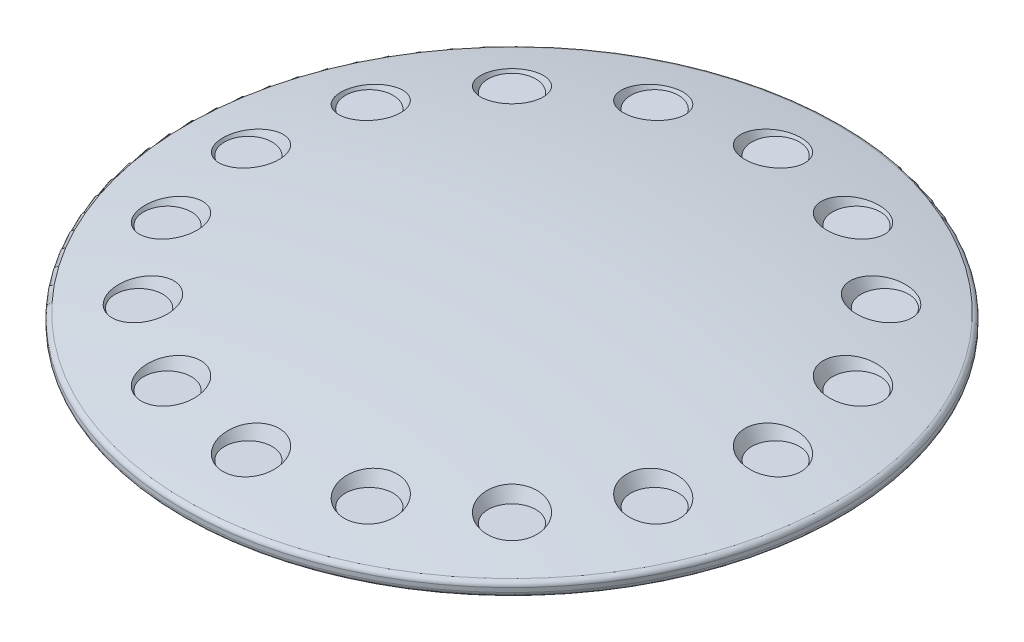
ISO-10303-21;
HEADER;
FILE_DESCRIPTION(('STEP AP214'),'2;1');
FILE_NAME('part.step','',(''),(''),'','','');
FILE_SCHEMA(('AUTOMOTIVE_DESIGN { 1 0 10303 214 1 1 1 1 }'));
ENDSEC;
DATA;
#1=APPLICATION_CONTEXT('core data for automotive mechanical design processes');
#2=APPLICATION_PROTOCOL_DEFINITION('international standard','automotive_design',2000,#1);
#3=PRODUCT_CONTEXT('',#1,'mechanical');
#4=PRODUCT('Part','Part','',(#3));
#5=PRODUCT_RELATED_PRODUCT_CATEGORY('part','',(#4));
#6=PRODUCT_DEFINITION_FORMATION('','',#4);
#7=PRODUCT_DEFINITION_CONTEXT('part definition',#1,'design');
#8=PRODUCT_DEFINITION('design','',#6,#7);
#9=PRODUCT_DEFINITION_SHAPE('','',#8);
#10=(LENGTH_UNIT() NAMED_UNIT(*) SI_UNIT(.MILLI.,.METRE.));
#11=(NAMED_UNIT(*) PLANE_ANGLE_UNIT() SI_UNIT($,.RADIAN.));
#12=(NAMED_UNIT(*) SI_UNIT($,.STERADIAN.) SOLID_ANGLE_UNIT());
#13=UNCERTAINTY_MEASURE_WITH_UNIT(LENGTH_MEASURE(1.E-05),#10,'distance_accuracy_value','');
#14=(GEOMETRIC_REPRESENTATION_CONTEXT(3) GLOBAL_UNCERTAINTY_ASSIGNED_CONTEXT((#13)) GLOBAL_UNIT_ASSIGNED_CONTEXT((#10,
#11,#12)) REPRESENTATION_CONTEXT('',''));
#15=CARTESIAN_POINT('',(0.,0.,0.));
#16=DIRECTION('',(0.,0.,1.));
#17=DIRECTION('',(1.,0.,0.));
#18=AXIS2_PLACEMENT_3D('',#15,#16,#17);
#19=CARTESIAN_POINT('',(64.3485334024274,-2.58689960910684,0.));
#20=DIRECTION('',(0.,-1.,0.));
#21=DIRECTION('',(0.,0.,-1.));
#22=AXIS2_PLACEMENT_3D('',#19,#20,#21);
#23=PLANE('',#22);
#24=CARTESIAN_POINT('',(62.,-2.58689960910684,0.));
#25=DIRECTION('',(0.,-1.,0.));
#26=DIRECTION('',(0.,0.,-1.));
#27=AXIS2_PLACEMENT_3D('',#24,#25,#26);
#28=CIRCLE('',#27,1.25);
#29=CARTESIAN_POINT('',(62.,-2.58689960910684,-1.25));
#30=VERTEX_POINT('',#29);
#31=EDGE_CURVE('E322',#30,#30,#28,.T.);
#32=ORIENTED_EDGE('',*,*,#31,.F.);
#33=EDGE_LOOP('',(#32));
#34=FACE_BOUND('',#33,.T.);
#35=CARTESIAN_POINT('',(0.,-2.58689960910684,0.));
#36=DIRECTION('',(0.,-1.,0.));
#37=DIRECTION('',(0.,0.,-1.));
#38=AXIS2_PLACEMENT_3D('',#35,#36,#37);
#39=CIRCLE('',#38,64.3485334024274);
#40=CARTESIAN_POINT('',(0.,-2.58689960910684,-64.3485334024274));
#41=VERTEX_POINT('',#40);
#42=EDGE_CURVE('E10',#41,#41,#39,.T.);
#43=ORIENTED_EDGE('',*,*,#42,.T.);
#44=EDGE_LOOP('',(#43));
#45=FACE_BOUND('',#44,.T.);
#46=ADVANCED_FACE('F25',(#34,#45),#23,.T.);
#47=CARTESIAN_POINT('',(0.,-1.64960324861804,0.));
#48=DIRECTION('',(0.,-1.,0.));
#49=DIRECTION('',(0.,0.,-1.));
#50=AXIS2_PLACEMENT_3D('',#47,#48,#49);
#51=TOROIDAL_SURFACE('',#50,63.9999999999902,1.);
#52=CARTESIAN_POINT('',(0.,-1.64960324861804,0.));
#53=DIRECTION('',(0.,-1.,0.));
#54=DIRECTION('',(0.,0.,-1.));
#55=AXIS2_PLACEMENT_3D('',#52,#53,#54);
#56=CIRCLE('',#55,64.9999999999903);
#57=CARTESIAN_POINT('',(0.,-1.64960324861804,-64.9999999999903));
#58=VERTEX_POINT('',#57);
#59=EDGE_CURVE('E36',#58,#58,#56,.T.);
#60=ORIENTED_EDGE('',*,*,#59,.T.);
#61=EDGE_LOOP('',(#60));
#62=FACE_BOUND('',#61,.T.);
#63=ORIENTED_EDGE('',*,*,#42,.F.);
#64=EDGE_LOOP('',(#63));
#65=FACE_BOUND('',#64,.T.);
#66=ADVANCED_FACE('F310',(#62,#65),#51,.T.);
#67=CARTESIAN_POINT('',(0.,0.,0.));
#68=DIRECTION('',(0.,-1.,0.));
#69=DIRECTION('',(0.,0.,-1.));
#70=AXIS2_PLACEMENT_3D('',#67,#68,#69);
#71=CYLINDRICAL_SURFACE('',#70,64.9999999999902);
#72=CARTESIAN_POINT('',(0.,-0.813221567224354,0.));
#73=DIRECTION('',(0.,-1.,0.));
#74=DIRECTION('',(0.,0.,-1.));
#75=AXIS2_PLACEMENT_3D('',#72,#73,#74);
#76=CIRCLE('',#75,64.9999999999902);
#77=CARTESIAN_POINT('',(0.,-0.813221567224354,-64.9999999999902));
#78=VERTEX_POINT('',#77);
#79=EDGE_CURVE('E41',#78,#78,#76,.T.);
#80=ORIENTED_EDGE('',*,*,#79,.T.);
#81=EDGE_LOOP('',(#80));
#82=FACE_BOUND('',#81,.T.);
#83=ORIENTED_EDGE('',*,*,#59,.F.);
#84=EDGE_LOOP('',(#83));
#85=FACE_BOUND('',#84,.T.);
#86=ADVANCED_FACE('F299',(#82,#85),#71,.T.);
#87=CARTESIAN_POINT('',(0.,-0.813221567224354,0.));
#88=DIRECTION('',(0.,-1.,0.));
#89=DIRECTION('',(0.,0.,-1.));
#90=AXIS2_PLACEMENT_3D('',#87,#88,#89);
#91=TOROIDAL_SURFACE('',#90,63.9999999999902,0.999999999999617);
#92=CARTESIAN_POINT('',(0.,0.166040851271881,0.));
#93=DIRECTION('',(0.,-1.,0.));
#94=DIRECTION('',(0.,0.,-1.));
#95=AXIS2_PLACEMENT_3D('',#92,#93,#94);
#96=CIRCLE('',#95,64.2025959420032);
#97=CARTESIAN_POINT('',(0.,0.166040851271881,-64.2025959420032));
#98=VERTEX_POINT('',#97);
#99=EDGE_CURVE('E51',#98,#98,#96,.T.);
#100=ORIENTED_EDGE('',*,*,#99,.T.);
#101=EDGE_LOOP('',(#100));
#102=FACE_BOUND('',#101,.T.);
#103=ORIENTED_EDGE('',*,*,#79,.F.);
#104=EDGE_LOOP('',(#103));
#105=FACE_BOUND('',#104,.T.);
#106=ADVANCED_FACE('F302',(#102,#105),#91,.T.);
#107=CARTESIAN_POINT('',(-3.10861103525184E-06,-310.16195385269,0.));
#108=DIRECTION('',(0.,-1.,0.));
#109=DIRECTION('',(1.,0.,0.));
#110=AXIS2_PLACEMENT_3D('',#107,#108,#109);
#111=SPHERICAL_SURFACE('',#110,316.899728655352);
#112=CARTESIAN_POINT('',(-17.5760531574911,3.39189571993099,-42.432345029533));
#113=CARTESIAN_POINT('',(-17.4165796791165,3.39189559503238,-42.4984019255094));
#114=CARTESIAN_POINT('',(-17.2602074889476,3.39056092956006,-42.5719818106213));
#115=CARTESIAN_POINT('',(-16.9550381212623,3.385233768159,-42.733543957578));
#116=CARTESIAN_POINT('',(-16.8062450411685,3.38123985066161,-42.8215339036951));
#117=CARTESIAN_POINT('',(-16.5174652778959,3.37062563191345,-43.0111959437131));
#118=CARTESIAN_POINT('',(-16.3774906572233,3.36400181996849,-43.112886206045));
#119=CARTESIAN_POINT('',(-16.107762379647,3.34818974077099,-43.3289499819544));
#120=CARTESIAN_POINT('',(-15.9780125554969,3.33900051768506,-43.4433282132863));
#121=CARTESIAN_POINT('',(-15.7444070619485,3.31936603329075,-43.6696372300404));
#122=CARTESIAN_POINT('',(-15.6392958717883,3.30919193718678,-43.7802999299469));
#123=CARTESIAN_POINT('',(-15.4386575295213,3.28698743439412,-44.0098914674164));
#124=CARTESIAN_POINT('',(-15.3431334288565,3.27495643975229,-44.1288229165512));
#125=CARTESIAN_POINT('',(-15.1624406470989,3.24914470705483,-44.3739240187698));
#126=CARTESIAN_POINT('',(-15.0772607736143,3.23536589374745,-44.5000856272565));
#127=CARTESIAN_POINT('',(-14.9176499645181,3.20614400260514,-44.7589144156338));
#128=CARTESIAN_POINT('',(-14.843223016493,3.19070031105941,-44.8915839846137));
#129=CARTESIAN_POINT('',(-14.7048150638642,3.15807503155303,-45.1640334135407));
#130=CARTESIAN_POINT('',(-14.6409661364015,3.14087526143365,-45.3038781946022));
#131=CARTESIAN_POINT('',(-14.5251533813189,3.10500968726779,-45.5882823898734));
#132=CARTESIAN_POINT('',(-14.4731939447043,3.0863433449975,-45.7328435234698));
#133=CARTESIAN_POINT('',(-14.3815027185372,3.04768708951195,-46.0255929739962));
#134=CARTESIAN_POINT('',(-14.3417689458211,3.02769739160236,-46.1737806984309));
#135=CARTESIAN_POINT('',(-14.274724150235,2.98652522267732,-46.4728343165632));
#136=CARTESIAN_POINT('',(-14.2474177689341,2.96534230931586,-46.6237011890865));
#137=CARTESIAN_POINT('',(-14.2050405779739,2.92158162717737,-46.9295157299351));
#138=CARTESIAN_POINT('',(-14.1901775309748,2.89898669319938,-47.0844897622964));
#139=CARTESIAN_POINT('',(-14.1734980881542,2.85287560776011,-47.3950559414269));
#140=CARTESIAN_POINT('',(-14.1716865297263,2.82935911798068,-47.5506482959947));
#141=CARTESIAN_POINT('',(-14.1810968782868,2.78158213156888,-47.8612847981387));
#142=CARTESIAN_POINT('',(-14.1923147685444,2.75732186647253,-48.0163290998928));
#143=CARTESIAN_POINT('',(-14.2276521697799,2.70821789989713,-48.3248632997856));
#144=CARTESIAN_POINT('',(-14.2517764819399,2.68337398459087,-48.478352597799));
#145=CARTESIAN_POINT('',(-14.3441942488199,2.60747829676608,-48.939412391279));
#146=CARTESIAN_POINT('',(-14.4323980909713,2.55574546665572,-49.2431345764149));
#147=CARTESIAN_POINT('',(-14.6587587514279,2.45205577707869,-49.8311346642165));
#148=CARTESIAN_POINT('',(-14.7969181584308,2.40009890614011,-50.115411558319));
#149=CARTESIAN_POINT('',(-15.120534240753,2.29702183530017,-50.6586550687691));
#150=CARTESIAN_POINT('',(-15.306315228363,2.24591003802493,-50.9174305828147));
#151=CARTESIAN_POINT('',(-15.7195701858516,2.14637865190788,-51.3998253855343));
#152=CARTESIAN_POINT('',(-15.9470440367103,2.0979590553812,-51.6234447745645));
#153=CARTESIAN_POINT('',(-16.436298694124,2.00543824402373,-52.0279535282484));
#154=CARTESIAN_POINT('',(-16.6979233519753,1.96131888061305,-52.2090274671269));
#155=CARTESIAN_POINT('',(-17.2489263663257,1.87848566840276,-52.524081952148));
#156=CARTESIAN_POINT('',(-17.5383027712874,1.8397714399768,-52.6580658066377));
#157=CARTESIAN_POINT('',(-18.1322657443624,1.76945292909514,-52.8730186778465));
#158=CARTESIAN_POINT('',(-18.4365804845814,1.73775613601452,-52.9547082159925));
#159=CARTESIAN_POINT('',(-19.0553316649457,1.68178422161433,-53.0651959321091));
#160=CARTESIAN_POINT('',(-19.3697670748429,1.65750834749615,-53.0939994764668));
#161=CARTESIAN_POINT('',(-19.9939573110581,1.61751659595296,-53.0974361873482));
#162=CARTESIAN_POINT('',(-20.3036979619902,1.60165860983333,-53.0730067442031));
#163=CARTESIAN_POINT('',(-20.9149592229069,1.57837449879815,-52.9723170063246));
#164=CARTESIAN_POINT('',(-21.2164805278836,1.57094765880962,-52.8960611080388));
#165=CARTESIAN_POINT('',(-21.798663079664,1.56480620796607,-52.695133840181));
#166=CARTESIAN_POINT('',(-22.0795430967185,1.56598054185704,-52.5710991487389));
#167=CARTESIAN_POINT('',(-22.616647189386,1.57674070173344,-52.2781536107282));
#168=CARTESIAN_POINT('',(-22.8728720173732,1.58632627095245,-52.1092441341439));
#169=CARTESIAN_POINT('',(-23.3528437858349,1.61356924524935,-51.731993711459));
#170=CARTESIAN_POINT('',(-23.5766728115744,1.63120576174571,-51.5237556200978));
#171=CARTESIAN_POINT('',(-23.9865707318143,1.67399738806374,-51.0736256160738));
#172=CARTESIAN_POINT('',(-24.1726384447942,1.69915273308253,-50.8317326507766));
#173=CARTESIAN_POINT('',(-24.503603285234,1.75647242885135,-50.3189992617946));
#174=CARTESIAN_POINT('',(-24.6481285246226,1.78869579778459,-50.0479255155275));
#175=CARTESIAN_POINT('',(-24.8902294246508,1.85906524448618,-49.4862916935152));
#176=CARTESIAN_POINT('',(-24.9878014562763,1.89721177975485,-49.195730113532));
#177=CARTESIAN_POINT('',(-25.1349284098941,1.9789874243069,-48.5983966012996));
#178=CARTESIAN_POINT('',(-25.1836865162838,2.02269478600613,-48.2914392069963));
#179=CARTESIAN_POINT('',(-25.2294691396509,2.1138496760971,-47.6742324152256));
#180=CARTESIAN_POINT('',(-25.2264890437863,2.16129753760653,-47.3639827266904));
#181=CARTESIAN_POINT('',(-25.1687329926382,2.2594145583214,-46.7435853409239));
#182=CARTESIAN_POINT('',(-25.1131005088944,2.31012403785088,-46.4335243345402));
#183=CARTESIAN_POINT('',(-24.9504298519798,2.41265054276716,-45.8271964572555));
#184=CARTESIAN_POINT('',(-24.8433880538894,2.46446764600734,-45.5309305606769));
#185=CARTESIAN_POINT('',(-24.6461003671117,2.54213125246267,-45.1019842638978));
#186=CARTESIAN_POINT('',(-24.5737228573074,2.56814965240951,-44.9608553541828));
#187=CARTESIAN_POINT('',(-24.4171837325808,2.61990761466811,-44.6852569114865));
#188=CARTESIAN_POINT('',(-24.3330264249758,2.64564727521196,-44.5507849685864));
#189=CARTESIAN_POINT('',(-24.1534665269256,2.69667544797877,-44.2894131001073));
#190=CARTESIAN_POINT('',(-24.0580595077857,2.7219637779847,-44.162516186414));
#191=CARTESIAN_POINT('',(-23.8567186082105,2.77189048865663,-43.9173085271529));
#192=CARTESIAN_POINT('',(-23.7507887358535,2.79652911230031,-43.7989945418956));
#193=CARTESIAN_POINT('',(-23.5291747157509,2.84497208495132,-43.57185064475));
#194=CARTESIAN_POINT('',(-23.4134968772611,2.86877695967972,-43.46301468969));
#195=CARTESIAN_POINT('',(-23.1731756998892,2.9153864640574,-43.2555984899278));
#196=CARTESIAN_POINT('',(-23.0485358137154,2.93819147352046,-43.1570143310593));
#197=CARTESIAN_POINT('',(-22.7910843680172,2.98264879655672,-42.9707832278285));
#198=CARTESIAN_POINT('',(-22.6582703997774,3.00430076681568,-42.8831395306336));
#199=CARTESIAN_POINT('',(-22.3854967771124,3.04627384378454,-42.7195449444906));
#200=CARTESIAN_POINT('',(-22.2455399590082,3.06659547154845,-42.6435894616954));
#201=CARTESIAN_POINT('',(-21.9610767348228,3.10553738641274,-42.5047448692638));
#202=CARTESIAN_POINT('',(-21.8166408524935,3.12417450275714,-42.4417159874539));
#203=CARTESIAN_POINT('',(-21.5228027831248,3.15985738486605,-42.3281801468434));
#204=CARTESIAN_POINT('',(-21.3734025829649,3.17690377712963,-42.2776682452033));
#205=CARTESIAN_POINT('',(-21.0705565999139,3.20929288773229,-42.1895326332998));
#206=CARTESIAN_POINT('',(-20.9171081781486,3.22463445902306,-42.1519175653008));
#207=CARTESIAN_POINT('',(-20.6074445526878,3.25347476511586,-42.0899704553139));
#208=CARTESIAN_POINT('',(-20.4512304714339,3.26697422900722,-42.0656331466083));
#209=CARTESIAN_POINT('',(-20.1396651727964,3.29182810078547,-42.0307380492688));
#210=CARTESIAN_POINT('',(-19.9843405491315,3.30321354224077,-42.0199647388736));
#211=CARTESIAN_POINT('',(-19.6732650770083,3.32401027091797,-42.0116101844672));
#212=CARTESIAN_POINT('',(-19.5175144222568,3.33342234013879,-42.0140237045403));
#213=CARTESIAN_POINT('',(-19.2068851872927,3.35019175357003,-42.0320413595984));
#214=CARTESIAN_POINT('',(-19.0520056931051,3.35755194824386,-42.047627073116));
#215=CARTESIAN_POINT('',(-18.7440967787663,3.3701740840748,-42.0918750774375));
#216=CARTESIAN_POINT('',(-18.5910666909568,3.37543680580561,-42.1205324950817));
#217=CARTESIAN_POINT('',(-18.2921636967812,3.38370851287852,-42.1897544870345));
#218=CARTESIAN_POINT('',(-18.1462102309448,3.38677628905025,-42.2299644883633));
#219=CARTESIAN_POINT('',(-17.8580604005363,3.39087018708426,-42.3223020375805));
#220=CARTESIAN_POINT('',(-17.7158649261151,3.39189582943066,-42.3744323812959));
#221=CARTESIAN_POINT('',(-17.5760531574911,3.39189571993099,-42.432345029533));
#222=B_SPLINE_CURVE_WITH_KNOTS('',3,(#112,#113,#114,#115,#116,#117,#118,#119,#120,#121,#122,
#123,#124,#125,#126,#127,#128,#129,#130,#131,#132,#133,#134,#135,#136,#137,#138,#139,#140,#141,
#142,#143,#144,#145,#146,#147,#148,#149,#150,#151,#152,#153,#154,#155,#156,#157,#158,#159,#160,
#161,#162,#163,#164,#165,#166,#167,#168,#169,#170,#171,#172,#173,#174,#175,#176,#177,#178,#179,
#180,#181,#182,#183,#184,#185,#186,#187,#188,#189,#190,#191,#192,#193,#194,#195,#196,#197,#198,
#199,#200,#201,#202,#203,#204,#205,#206,#207,#208,#209,#210,#211,#212,#213,#214,#215,#216,#217,
#218,#219,#220,#221),.UNSPECIFIED.,.T.,.F.,(4,2,2,2,2,2,2,2,2,2,2,2,2,2,2,2,2,2,2,2,2,2,2,2,2,2,
2,2,2,2,2,2,2,2,2,2,2,2,2,2,2,2,2,2,2,2,2,2,2,2,2,2,2,2,4),(0.,0.517667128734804,
1.03561121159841,1.55424904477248,2.07308037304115,2.53144978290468,2.98996462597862,
3.44797885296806,3.90616249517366,4.36969452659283,4.83339747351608,5.29702516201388,
5.76082587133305,6.23222425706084,6.70379735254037,7.17522510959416,7.64682835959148,
8.60335287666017,9.55992696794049,10.5231971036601,11.4864644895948,12.4454724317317,
13.4044129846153,14.3498393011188,15.2951696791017,16.2239882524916,17.1527280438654,
18.0694976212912,18.9862392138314,19.9006156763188,20.8150207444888,21.7373733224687,
22.659797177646,23.5970440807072,24.5343745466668,25.4872200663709,26.4401327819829,
26.9218408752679,27.4033732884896,27.8850959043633,28.3666357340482,28.8478662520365,
29.3289123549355,29.8101008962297,30.2910998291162,30.7665862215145,31.2418845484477,
31.7175007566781,32.1929281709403,32.6607019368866,33.1282899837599,33.5952251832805,
34.0619864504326,34.5157231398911,34.9695663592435),.UNSPECIFIED.);
#223=CARTESIAN_POINT('',(-17.5760531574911,3.39189571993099,-42.432345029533));
#224=VERTEX_POINT('',#223);
#225=EDGE_CURVE('E28',#224,#224,#222,.T.);
#226=ORIENTED_EDGE('',*,*,#225,.F.);
#227=EDGE_LOOP('',(#226));
#228=FACE_BOUND('',#227,.T.);
#229=CARTESIAN_POINT('',(-32.4763110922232,3.39189588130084,-32.476310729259));
#230=CARTESIAN_POINT('',(-32.3542556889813,3.39189575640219,-32.5983672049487));
#231=CARTESIAN_POINT('',(-32.2379444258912,3.39056109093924,-32.7261872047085));
#232=CARTESIAN_POINT('',(-32.0178318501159,3.38523392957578,-32.9922344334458));
#233=CARTESIAN_POINT('',(-31.9140372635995,3.38124001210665,-33.1304671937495));
#234=CARTESIAN_POINT('',(-31.7198200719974,3.37062579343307,-33.4162033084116));
#235=CARTESIAN_POINT('',(-31.6294155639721,3.36400198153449,-33.56371883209));
#236=CARTESIAN_POINT('',(-31.4629031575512,3.34818990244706,-33.8665562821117));
#237=CARTESIAN_POINT('',(-31.386800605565,3.33900067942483,-34.0218811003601));
#238=CARTESIAN_POINT('',(-31.2575819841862,3.31936619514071,-34.3203603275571));
#239=CARTESIAN_POINT('',(-31.2028206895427,3.30919209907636,-34.46282364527));
#240=CARTESIAN_POINT('',(-31.1053159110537,3.28698759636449,-34.7517195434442));
#241=CARTESIAN_POINT('',(-31.0625762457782,3.27495660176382,-34.8981533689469));
#242=CARTESIAN_POINT('',(-30.9894340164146,3.24914486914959,-35.1937454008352));
#243=CARTESIAN_POINT('',(-30.9590180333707,3.23536605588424,-35.3429004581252));
#244=CARTESIAN_POINT('',(-30.9106063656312,3.20614416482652,-35.6431074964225));
#245=CARTESIAN_POINT('',(-30.8926152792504,3.19070047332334,-35.7941601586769));
#246=CARTESIAN_POINT('',(-30.8690048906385,3.15807519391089,-36.0988370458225));
#247=CARTESIAN_POINT('',(-30.8635324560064,3.14087542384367,-36.2524707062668));
#248=CARTESIAN_POINT('',(-30.8653721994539,3.1050098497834,-36.559545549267));
#249=CARTESIAN_POINT('',(-30.8726890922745,3.0863435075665,-36.7129866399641));
#250=CARTESIAN_POINT('',(-30.9000078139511,3.0476872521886,-37.0185405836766));
#251=CARTESIAN_POINT('',(-30.9200075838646,3.02769755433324,-37.1706536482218));
#252=CARTESIAN_POINT('',(-30.9725091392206,2.98652538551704,-37.4726001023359));
#253=CARTESIAN_POINT('',(-31.0050155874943,2.96534247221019,-37.6224326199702));
#254=CARTESIAN_POINT('',(-31.082894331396,2.92158179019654,-37.9211854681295));
#255=CARTESIAN_POINT('',(-31.1284686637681,2.89898685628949,-38.0700506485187));
#256=CARTESIAN_POINT('',(-31.231907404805,2.85287577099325,-38.3633593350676));
#257=CARTESIAN_POINT('',(-31.28977636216,2.82935928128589,-38.5078011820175));
#258=CARTESIAN_POINT('',(-31.4173458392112,2.78158229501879,-38.7911907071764));
#259=CARTESIAN_POINT('',(-31.4870427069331,2.75732202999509,-38.9301400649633));
#260=CARTESIAN_POINT('',(-31.6377611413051,2.70821806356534,-39.2016654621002));
#261=CARTESIAN_POINT('',(-31.7187869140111,2.6833741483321,-39.3342391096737));
#262=CARTESIAN_POINT('',(-31.9806097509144,2.60747846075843,-39.7248360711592));
#263=CARTESIAN_POINT('',(-32.1783289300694,2.55574563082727,-39.9716846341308));
#264=CARTESIAN_POINT('',(-32.6124768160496,2.4520559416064,-40.4283014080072));
#265=CARTESIAN_POINT('',(-32.848907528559,2.40009907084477,-40.6380676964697));
#266=CARTESIAN_POINT('',(-33.3557801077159,2.29702200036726,-41.0161167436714));
#267=CARTESIAN_POINT('',(-33.6264484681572,2.24591020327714,-41.1840988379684));
#268=CARTESIAN_POINT('',(-34.1928507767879,2.14637881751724,-41.4716276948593));
#269=CARTESIAN_POINT('',(-34.4885846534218,2.0979592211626,-41.5911745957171));
#270=CARTESIAN_POINT('',(-35.0953958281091,2.00543841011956,-41.7776622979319));
#271=CARTESIAN_POINT('',(-35.4063994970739,1.96131904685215,-41.8448333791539));
#272=CARTESIAN_POINT('',(-36.0360260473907,1.87848583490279,-41.9250460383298));
#273=CARTESIAN_POINT('',(-36.3546483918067,1.83977160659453,-41.9380914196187));
#274=CARTESIAN_POINT('',(-36.9856575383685,1.76945309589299,-41.9093821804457));
#275=CARTESIAN_POINT('',(-37.2980689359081,1.73775630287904,-41.8683972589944));
#276=CARTESIAN_POINT('',(-37.9120023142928,1.68178438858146,-41.7336887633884));
#277=CARTESIAN_POINT('',(-38.2135253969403,1.65750851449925,-41.6399705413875));
#278=CARTESIAN_POINT('',(-38.79151715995,1.61751676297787,-41.4042783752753));
#279=CARTESIAN_POINT('',(-39.0683314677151,1.60165877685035,-41.2631758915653));
#280=CARTESIAN_POINT('',(-39.5945309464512,1.57837466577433,-40.9362311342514));
#281=CARTESIAN_POINT('',(-39.8439184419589,1.57094782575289,-40.7503926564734));
#282=CARTESIAN_POINT('',(-40.304893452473,1.56480637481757,-40.3419684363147));
#283=CARTESIAN_POINT('',(-40.5169267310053,1.56598070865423,-40.1198871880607));
#284=CARTESIAN_POINT('',(-40.9010408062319,1.57674086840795,-39.6436999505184));
#285=CARTESIAN_POINT('',(-41.0731228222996,1.58632643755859,-39.3895949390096));
#286=CARTESIAN_POINT('',(-41.3721914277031,1.61356941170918,-38.8573837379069));
#287=CARTESIAN_POINT('',(-41.4992932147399,1.63120592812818,-38.5793411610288));
#288=CARTESIAN_POINT('',(-41.7057322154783,1.67399755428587,-38.0066141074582));
#289=CARTESIAN_POINT('',(-41.7850679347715,1.69915289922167,-37.7119291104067));
#290=CARTESIAN_POINT('',(-41.8946249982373,1.75647259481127,-37.1115704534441));
#291=CARTESIAN_POINT('',(-41.9244134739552,1.78869596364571,-36.805823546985));
#292=CARTESIAN_POINT('',(-41.9331575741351,1.85906541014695,-36.1942935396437));
#293=CARTESIAN_POINT('',(-41.9121092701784,1.89721194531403,-35.8885104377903));
#294=CARTESIAN_POINT('',(-41.8194472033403,1.97898758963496,-35.2803431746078));
#295=CARTESIAN_POINT('',(-41.7470263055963,2.02269495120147,-34.9780925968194));
#296=CARTESIAN_POINT('',(-41.5531291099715,2.11384984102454,-34.3903476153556));
#297=CARTESIAN_POINT('',(-41.4316484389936,2.1612977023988,-34.1048547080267));
#298=CARTESIAN_POINT('',(-41.1408729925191,2.25941472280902,-33.5537845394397));
#299=CARTESIAN_POINT('',(-40.9708200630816,2.31012420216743,-33.2886151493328));
#300=CARTESIAN_POINT('',(-40.588500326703,2.41265070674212,-32.7906925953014));
#301=CARTESIAN_POINT('',(-40.37623054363,2.46446780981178,-32.5579417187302));
#302=CARTESIAN_POINT('',(-40.0298098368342,2.5421314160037,-32.2371457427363));
#303=CARTESIAN_POINT('',(-39.9089340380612,2.56814981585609,-32.1344573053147));
#304=CARTESIAN_POINT('',(-39.6588437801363,2.61990777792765,-31.9397424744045));
#305=CARTESIAN_POINT('',(-39.5296323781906,2.64564743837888,-31.847712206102));
#306=CARTESIAN_POINT('',(-39.2637179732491,2.69667561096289,-31.6749506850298));
#307=CARTESIAN_POINT('',(-39.1270120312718,2.72196394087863,-31.5942239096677));
#308=CARTESIAN_POINT('',(-38.8471603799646,2.77189065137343,-31.4447313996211));
#309=CARTESIAN_POINT('',(-38.7040171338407,2.79652927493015,-31.3759611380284));
#310=CARTESIAN_POINT('',(-38.4123482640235,2.84497224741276,-31.2509155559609));
#311=CARTESIAN_POINT('',(-38.2638261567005,2.86877712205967,-31.1946322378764));
#312=CARTESIAN_POINT('',(-37.9624235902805,2.915386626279,-31.0949715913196));
#313=CARTESIAN_POINT('',(-37.8095448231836,2.9381916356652,-31.0515893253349));
#314=CARTESIAN_POINT('',(-37.5004231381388,2.98264895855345,-30.9780566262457));
#315=CARTESIAN_POINT('',(-37.3441792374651,3.00430092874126,-30.9479101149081));
#316=CARTESIAN_POINT('',(-37.0295643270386,3.04627400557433,-30.9011543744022));
#317=CARTESIAN_POINT('',(-36.8711941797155,3.0665956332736,-30.8845398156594));
#318=CARTESIAN_POINT('',(-36.5552508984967,3.1055375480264,-30.8651235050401));
#319=CARTESIAN_POINT('',(-36.3976894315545,3.12417466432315,-30.8621656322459));
#320=CARTESIAN_POINT('',(-36.0827701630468,3.15985754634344,-30.8697191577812));
#321=CARTESIAN_POINT('',(-35.9254123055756,3.17690393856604,-30.8802252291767));
#322=CARTESIAN_POINT('',(-35.611891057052,3.20929304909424,-30.9146926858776));
#323=CARTESIAN_POINT('',(-35.4557285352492,3.22463462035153,-30.9386630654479));
#324=CARTESIAN_POINT('',(-35.1459305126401,3.25347492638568,-30.9999345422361));
#325=CARTESIAN_POINT('',(-34.9922940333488,3.26697439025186,-31.0372303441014));
#326=CARTESIAN_POINT('',(-34.6910914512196,3.29182826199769,-31.1242223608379));
#327=CARTESIAN_POINT('',(-34.5434674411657,3.30321370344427,-31.1737092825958));
#328=CARTESIAN_POINT('',(-34.2528740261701,3.32401043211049,-31.2850341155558));
#329=CARTESIAN_POINT('',(-34.109902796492,3.33342250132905,-31.3468671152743));
#330=CARTESIAN_POINT('',(-33.829813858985,3.3501919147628,-31.4823859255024));
#331=CARTESIAN_POINT('',(-33.6926882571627,3.35755210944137,-31.5560550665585));
#332=CARTESIAN_POINT('',(-33.4251504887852,3.37017424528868,-31.71476653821));
#333=CARTESIAN_POINT('',(-33.2947358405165,3.37543696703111,-31.7998046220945));
#334=CARTESIAN_POINT('',(-33.0450755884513,3.38370867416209,-31.9781426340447));
#335=CARTESIAN_POINT('',(-32.9256198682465,3.3867764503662,-32.0711458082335));
#336=CARTESIAN_POINT('',(-32.6947401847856,3.39087034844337,-32.2667247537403));
#337=CARTESIAN_POINT('',(-32.5833181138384,3.39189599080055,-32.3693027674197));
#338=CARTESIAN_POINT('',(-32.4763110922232,3.39189588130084,-32.476310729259));
#339=B_SPLINE_CURVE_WITH_KNOTS('',3,(#229,#230,#231,#232,#233,#234,#235,#236,#237,#238,#239,
#240,#241,#242,#243,#244,#245,#246,#247,#248,#249,#250,#251,#252,#253,#254,#255,#256,#257,#258,
#259,#260,#261,#262,#263,#264,#265,#266,#267,#268,#269,#270,#271,#272,#273,#274,#275,#276,#277,
#278,#279,#280,#281,#282,#283,#284,#285,#286,#287,#288,#289,#290,#291,#292,#293,#294,#295,#296,
#297,#298,#299,#300,#301,#302,#303,#304,#305,#306,#307,#308,#309,#310,#311,#312,#313,#314,#315,
#316,#317,#318,#319,#320,#321,#322,#323,#324,#325,#326,#327,#328,#329,#330,#331,#332,#333,#334,
#335,#336,#337,#338),.UNSPECIFIED.,.T.,.F.,(4,2,2,2,2,2,2,2,2,2,2,2,2,2,2,2,2,2,2,2,2,2,2,2,2,2,
2,2,2,2,2,2,2,2,2,2,2,2,2,2,2,2,2,2,2,2,2,2,2,2,2,2,2,2,4),(0.,0.517667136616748,
1.03561122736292,1.55424906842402,2.07308040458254,2.53144982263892,2.98996467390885,
3.4479789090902,3.9061625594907,4.36969459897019,4.83339755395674,5.29702525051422,
5.76082596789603,6.23222436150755,6.7037974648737,7.17522522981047,7.64682848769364,
8.60335302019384,9.55992712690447,10.5231972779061,11.486464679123,12.4454726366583,
13.404413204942,14.3498395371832,15.2951699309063,16.2239885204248,17.152728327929,
18.0694979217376,18.9862395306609,19.900616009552,20.8150210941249,21.7373736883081,
22.6597975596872,23.5970444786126,24.5343749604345,25.4872204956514,26.4401332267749,
26.9218413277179,27.4033737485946,27.8850963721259,28.3666362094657,28.8478667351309,
29.3289128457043,29.8101013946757,30.2911003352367,30.7665867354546,31.2418850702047,
31.7175012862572,32.1929287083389,32.6607024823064,33.1282905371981,33.5952257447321,
34.061987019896,34.5157237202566,34.9695669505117),.UNSPECIFIED.);
#340=CARTESIAN_POINT('',(-32.4763110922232,3.39189588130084,-32.476310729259));
#341=VERTEX_POINT('',#340);
#342=EDGE_CURVE('E251',#341,#341,#339,.T.);
#343=ORIENTED_EDGE('',*,*,#342,.F.);
#344=EDGE_LOOP('',(#343));
#345=FACE_BOUND('',#344,.T.);
#346=CARTESIAN_POINT('',(-42.4323450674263,3.39189598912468,-17.5760526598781));
#347=CARTESIAN_POINT('',(-42.3662895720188,3.39189586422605,-17.7355267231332));
#348=CARTESIAN_POINT('',(-42.3077465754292,3.39056119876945,-17.8981274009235));
#349=CARTESIAN_POINT('',(-42.2062009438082,3.38523403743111,-18.2281564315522));
#350=CARTESIAN_POINT('',(-42.1632066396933,3.38124011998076,-18.3955873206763));
#351=CARTESIAN_POINT('',(-42.0931198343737,3.37062590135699,-18.7338967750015));
#352=CARTESIAN_POINT('',(-42.0660487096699,3.36400208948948,-18.9047796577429));
#353=CARTESIAN_POINT('',(-42.0281021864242,3.3481900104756,-19.2482865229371));
#354=CARTESIAN_POINT('',(-42.0172328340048,3.33900078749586,-19.4209111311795));
#355=CARTESIAN_POINT('',(-42.0120734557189,3.31936630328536,-19.7461198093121));
#356=CARTESIAN_POINT('',(-42.0159989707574,3.30919220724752,-19.8986949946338));
#357=CARTESIAN_POINT('',(-42.0364719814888,3.28698770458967,-20.2029134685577));
#358=CARTESIAN_POINT('',(-42.053023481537,3.27495671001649,-20.3545564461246));
#359=CARTESIAN_POINT('',(-42.0985670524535,3.24914497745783,-20.6556381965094));
#360=CARTESIAN_POINT('',(-42.1275455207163,3.23536616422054,-20.8050791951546));
#361=CARTESIAN_POINT('',(-42.1977032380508,3.20614427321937,-21.100960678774));
#362=CARTESIAN_POINT('',(-42.2388869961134,3.19070058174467,-21.2474000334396));
#363=CARTESIAN_POINT('',(-42.3336686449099,3.15807530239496,-21.5379200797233));
#364=CARTESIAN_POINT('',(-42.3874058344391,3.14087553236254,-21.681953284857));
#365=CARTESIAN_POINT('',(-42.5066179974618,3.10500995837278,-21.9649494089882));
#366=CARTESIAN_POINT('',(-42.572097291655,3.0863436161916,-22.1039104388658));
#367=CARTESIAN_POINT('',(-42.7142669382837,3.04768736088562,-22.3757510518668));
#368=CARTESIAN_POINT('',(-42.7909554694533,3.02769766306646,-22.5086316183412));
#369=CARTESIAN_POINT('',(-42.9550104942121,2.98652549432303,-22.7675022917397));
#370=CARTESIAN_POINT('',(-43.0423809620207,2.96534258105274,-22.8934898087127));
#371=CARTESIAN_POINT('',(-43.2286593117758,2.92158189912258,-23.1396985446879));
#372=CARTESIAN_POINT('',(-43.3277327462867,2.89898696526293,-23.2597914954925));
#373=CARTESIAN_POINT('',(-43.5355420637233,2.85287588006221,-23.491189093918));
#374=CARTESIAN_POINT('',(-43.6442815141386,2.82935939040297,-23.6024904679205));
#375=CARTESIAN_POINT('',(-43.8705888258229,2.78158240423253,-23.8154895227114));
#376=CARTESIAN_POINT('',(-43.9881539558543,2.75732213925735,-23.9171901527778));
#377=CARTESIAN_POINT('',(-44.2313079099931,2.70821817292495,-24.1103694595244));
#378=CARTESIAN_POINT('',(-44.3568997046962,2.68337425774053,-24.2018443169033));
#379=CARTESIAN_POINT('',(-44.7482674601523,2.60747857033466,-24.4625135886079));
#380=CARTESIAN_POINT('',(-45.025401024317,2.55574574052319,-24.6149080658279));
#381=CARTESIAN_POINT('',(-45.601241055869,2.45205605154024,-24.8706257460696));
#382=CARTESIAN_POINT('',(-45.89994864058,2.40009918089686,-24.9739464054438));
#383=CARTESIAN_POINT('',(-46.5129109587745,2.29702211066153,-25.1292464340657));
#384=CARTESIAN_POINT('',(-46.8272598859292,2.24591031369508,-25.18086135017));
#385=CARTESIAN_POINT('',(-47.4605799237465,2.14637892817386,-25.2297505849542));
#386=CARTESIAN_POINT('',(-47.7795510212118,2.09795933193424,-25.2270250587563));
#387=CARTESIAN_POINT('',(-48.4115372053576,2.00543852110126,-25.1671006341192));
#388=CARTESIAN_POINT('',(-48.7245723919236,1.96131915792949,-25.1101426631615));
#389=CARTESIAN_POINT('',(-49.3369675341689,1.87848594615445,-24.943301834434));
#390=CARTESIAN_POINT('',(-49.6363284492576,1.83977171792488,-24.833422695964));
#391=CARTESIAN_POINT('',(-50.2083183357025,1.76945320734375,-24.5654220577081));
#392=CARTESIAN_POINT('',(-50.4812645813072,1.73775641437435,-24.4080022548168));
#393=CARTESIAN_POINT('',(-50.9969143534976,1.68178450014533,-24.0486056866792));
#394=CARTESIAN_POINT('',(-51.2396209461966,1.65750862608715,-23.8466334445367));
#395=CARTESIAN_POINT('',(-51.6834202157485,1.61751687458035,-23.4076943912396));
#396=CARTESIAN_POINT('',(-51.8851657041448,1.60165888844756,-23.1714004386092));
#397=CARTESIAN_POINT('',(-52.2461942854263,1.57837477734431,-22.6679750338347));
#398=CARTESIAN_POINT('',(-52.4054809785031,1.57094793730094,-22.4008461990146));
#399=CARTESIAN_POINT('',(-52.6750691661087,1.56480648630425,-21.8471039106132));
#400=CARTESIAN_POINT('',(-52.7859755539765,1.56598082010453,-21.5607859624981));
#401=CARTESIAN_POINT('',(-52.9586217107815,1.57674097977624,-20.9738522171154));
#402=CARTESIAN_POINT('',(-53.0203629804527,1.58632654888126,-20.6732368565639));
#403=CARTESIAN_POINT('',(-53.092997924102,1.61356952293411,-20.0670892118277));
#404=CARTESIAN_POINT('',(-53.1040223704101,1.63120603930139,-19.761571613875));
#405=CARTESIAN_POINT('',(-53.0755739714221,1.67399766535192,-19.1534400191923));
#406=CARTESIAN_POINT('',(-53.0360995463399,1.69915301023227,-18.8508261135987));
#407=CARTESIAN_POINT('',(-52.9075697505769,1.75647270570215,-18.254241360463));
#408=CARTESIAN_POINT('',(-52.8180864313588,1.78869607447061,-17.960368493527));
#409=CARTESIAN_POINT('',(-52.5921425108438,1.85906552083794,-17.39204221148));
#410=CARTESIAN_POINT('',(-52.4556782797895,1.8972120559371,-17.1175902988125));
#411=CARTESIAN_POINT('',(-52.137334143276,1.97898770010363,-16.5911772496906));
#412=CARTESIAN_POINT('',(-51.9547596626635,2.02269506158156,-16.3396484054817));
#413=CARTESIAN_POINT('',(-51.5507017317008,2.11384995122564,-15.8708440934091));
#414=CARTESIAN_POINT('',(-51.3292148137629,2.16129781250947,-15.6535716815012));
#415=CARTESIAN_POINT('',(-50.8496878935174,2.25941483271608,-15.2557241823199));
#416=CARTESIAN_POINT('',(-50.5911035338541,2.31012431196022,-15.0758160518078));
#417=CARTESIAN_POINT('',(-50.0473394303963,2.41265081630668,-14.7621030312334));
#418=CARTESIAN_POINT('',(-49.7621578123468,2.46446791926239,-14.6283013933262));
#419=CARTESIAN_POINT('',(-49.3193434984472,2.54213152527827,-14.464494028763));
#420=CARTESIAN_POINT('',(-49.1683716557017,2.56814992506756,-14.4158794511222));
#421=CARTESIAN_POINT('',(-48.8628042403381,2.61990788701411,-14.3316918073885));
#422=CARTESIAN_POINT('',(-48.7082100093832,2.64564754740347,-14.2961139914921));
#423=CARTESIAN_POINT('',(-48.3964241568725,2.69667571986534,-14.2382642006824));
#424=CARTESIAN_POINT('',(-48.2392315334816,2.72196404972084,-14.2159974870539));
#425=CARTESIAN_POINT('',(-47.9234740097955,2.77189076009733,-14.1849790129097));
#426=CARTESIAN_POINT('',(-47.764909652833,2.79652938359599,-14.176222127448));
#427=CARTESIAN_POINT('',(-47.447589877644,2.84497235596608,-14.1723119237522));
#428=CARTESIAN_POINT('',(-47.2888346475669,2.86877723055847,-14.177149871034));
#429=CARTESIAN_POINT('',(-46.9722365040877,2.91538673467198,-14.2004172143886));
#430=CARTESIAN_POINT('',(-46.8143932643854,2.93819174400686,-14.2188414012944));
#431=CARTESIAN_POINT('',(-46.500662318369,2.98264906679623,-14.269201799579));
#432=CARTESIAN_POINT('',(-46.34477520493,3.00430103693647,-14.3011420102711));
#433=CARTESIAN_POINT('',(-46.036216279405,3.04627411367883,-14.3783432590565));
#434=CARTESIAN_POINT('',(-45.8835432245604,3.06659574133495,-14.4235990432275));
#435=CARTESIAN_POINT('',(-45.5842193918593,3.10553765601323,-14.5265669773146));
#436=CARTESIAN_POINT('',(-45.4375196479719,3.12417477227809,-14.584130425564));
#437=CARTESIAN_POINT('',(-45.1494627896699,3.15985765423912,-14.7116233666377));
#438=CARTESIAN_POINT('',(-45.0081035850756,3.17690404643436,-14.7815479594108));
#439=CARTESIAN_POINT('',(-44.7316378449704,3.20929315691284,-14.9333711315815));
#440=CARTESIAN_POINT('',(-44.5965355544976,3.22463472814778,-15.0152776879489));
#441=CARTESIAN_POINT('',(-44.3337670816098,3.25347503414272,-15.1904397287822));
#442=CARTESIAN_POINT('',(-44.2060979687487,3.26697449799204,-15.2836906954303));
#443=CARTESIAN_POINT('',(-43.9611134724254,3.29182836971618,-15.479326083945));
#444=CARTESIAN_POINT('',(-43.8436644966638,3.30321381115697,-15.5815393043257));
#445=CARTESIAN_POINT('',(-43.6177933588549,3.32401053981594,-15.7955953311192));
#446=CARTESIAN_POINT('',(-43.5093676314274,3.33342260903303,-15.9074342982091));
#447=CARTESIAN_POINT('',(-43.3024600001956,3.35019202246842,-16.139822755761));
#448=CARTESIAN_POINT('',(-43.2039644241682,3.35755221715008,-16.2603598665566));
#449=CARTESIAN_POINT('',(-43.0175280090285,3.37017435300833,-16.5093724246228));
#450=CARTESIAN_POINT('',(-42.9295832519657,3.37543707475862,-16.6378448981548));
#451=CARTESIAN_POINT('',(-42.7671742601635,3.38370878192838,-16.8981485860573));
#452=CARTESIAN_POINT('',(-42.6924023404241,3.38677655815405,-17.0297860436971));
#453=CARTESIAN_POINT('',(-42.5539421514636,3.39087045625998,-17.2988312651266));
#454=CARTESIAN_POINT('',(-42.4902564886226,3.39189609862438,-17.4362403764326));
#455=CARTESIAN_POINT('',(-42.4323450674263,3.39189598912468,-17.5760526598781));
#456=B_SPLINE_CURVE_WITH_KNOTS('',3,(#346,#347,#348,#349,#350,#351,#352,#353,#354,#355,#356,
#357,#358,#359,#360,#361,#362,#363,#364,#365,#366,#367,#368,#369,#370,#371,#372,#373,#374,#375,
#376,#377,#378,#379,#380,#381,#382,#383,#384,#385,#386,#387,#388,#389,#390,#391,#392,#393,#394,
#395,#396,#397,#398,#399,#400,#401,#402,#403,#404,#405,#406,#407,#408,#409,#410,#411,#412,#413,
#414,#415,#416,#417,#418,#419,#420,#421,#422,#423,#424,#425,#426,#427,#428,#429,#430,#431,#432,
#433,#434,#435,#436,#437,#438,#439,#440,#441,#442,#443,#444,#445,#446,#447,#448,#449,#450,#451,
#452,#453,#454,#455),.UNSPECIFIED.,.T.,.F.,(4,2,2,2,2,2,2,2,2,2,2,2,2,2,2,2,2,2,2,2,2,2,2,2,2,2,
2,2,2,2,2,2,2,2,2,2,2,2,2,2,2,2,2,2,2,2,2,2,2,2,2,2,2,2,4),(0.,0.517667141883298,
1.03561123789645,1.55424908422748,2.07308042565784,2.53144984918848,2.9899647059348,
3.4479789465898,3.90616260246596,4.36969464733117,4.83339760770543,5.29702530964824,
5.76082603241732,6.23222443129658,6.7037975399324,7.17522531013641,7.64682857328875,
8.60335311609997,9.55992723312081,10.5231973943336,11.4864648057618,12.4454727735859,
13.4044133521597,14.3498396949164,15.2951700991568,16.223988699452,17.1527285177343,
18.0694981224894,18.9862397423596,19.9006162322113,20.8150213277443,21.7373739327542,
22.659797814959,23.5970447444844,24.5343752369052,25.4872207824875,26.4401335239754,
26.9218416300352,27.4033740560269,27.8850966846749,28.3666365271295,28.8478670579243,
29.3289131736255,29.8101017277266,30.2911006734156,30.7665870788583,31.2418854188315,
31.7175016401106,32.1929290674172,32.6607028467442,33.1282909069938,33.595226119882,
34.0619874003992,34.5157241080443,34.9695673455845),.UNSPECIFIED.);
#457=CARTESIAN_POINT('',(-42.4323450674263,3.39189598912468,-17.5760526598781));
#458=VERTEX_POINT('',#457);
#459=EDGE_CURVE('E224',#458,#458,#456,.T.);
#460=ORIENTED_EDGE('',*,*,#459,.F.);
#461=EDGE_LOOP('',(#460));
#462=FACE_BOUND('',#461,.T.);
#463=CARTESIAN_POINT('',(-45.928439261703,3.39189602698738,6.29777611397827E-13));
#464=CARTESIAN_POINT('',(-45.9284400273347,3.39189590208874,-0.172613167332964));
#465=CARTESIAN_POINT('',(-45.9365779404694,3.39056123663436,-0.345240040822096));
#466=CARTESIAN_POINT('',(-45.9690586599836,3.38523407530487,-0.689006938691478));
#467=CARTESIAN_POINT('',(-45.9934101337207,3.38124015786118,-0.860146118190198));
#468=CARTESIAN_POINT('',(-46.0581237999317,3.37062593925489,-1.19952435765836));
#469=CARTESIAN_POINT('',(-46.0985073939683,3.36400212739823,-1.36775922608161));
#470=CARTESIAN_POINT('',(-46.1949037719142,3.34819004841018,-1.69963969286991));
#471=CARTESIAN_POINT('',(-46.2509223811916,3.33900082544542,-1.86328355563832));
#472=CARTESIAN_POINT('',(-46.3706077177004,3.31936634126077,-2.1657116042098));
#473=CARTESIAN_POINT('',(-46.4326224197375,3.30919224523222,-2.30517046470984));
#474=CARTESIAN_POINT('',(-46.5679563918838,3.28698774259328,-2.57839700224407));
#475=CARTESIAN_POINT('',(-46.6412792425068,3.27495674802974,-2.71216285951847));
#476=CARTESIAN_POINT('',(-46.7985750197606,3.24914501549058,-2.97289735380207));
#477=CARTESIAN_POINT('',(-46.88253623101,3.23536620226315,-3.09987325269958));
#478=CARTESIAN_POINT('',(-47.0605824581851,3.20614431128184,-3.34638390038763));
#479=CARTESIAN_POINT('',(-47.1546712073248,3.19070061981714,-3.46591587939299));
#480=CARTESIAN_POINT('',(-47.3534152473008,3.1580753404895,-3.69805003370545));
#481=CARTESIAN_POINT('',(-47.4581810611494,3.14087557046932,-3.81055502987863));
#482=CARTESIAN_POINT('',(-47.6766166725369,3.10500999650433,-4.02638883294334));
#483=CARTESIAN_POINT('',(-47.7902897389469,3.08634365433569,-4.12971424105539));
#484=CARTESIAN_POINT('',(-48.025666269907,3.04768739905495,-4.32645624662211));
#485=CARTESIAN_POINT('',(-48.147368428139,3.02769770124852,-4.41987444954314));
#486=CARTESIAN_POINT('',(-48.3980010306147,2.98652553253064,-4.59625862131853));
#487=CARTESIAN_POINT('',(-48.5269341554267,2.96534261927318,-4.67922067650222));
#488=CARTESIAN_POINT('',(-48.7932529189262,2.92158193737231,-4.83540224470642));
#489=CARTESIAN_POINT('',(-48.9307424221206,2.8989870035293,-4.90843989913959));
#490=CARTESIAN_POINT('',(-49.2112852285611,2.85287591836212,-5.04269821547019));
#491=CARTESIAN_POINT('',(-49.3543405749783,2.82935942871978,-5.10391448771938));
#492=CARTESIAN_POINT('',(-49.6449324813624,2.78158244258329,-5.21409588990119));
#493=CARTESIAN_POINT('',(-49.7924676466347,2.75732217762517,-5.26306478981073));
#494=CARTESIAN_POINT('',(-50.0910391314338,2.70821821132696,-5.34848820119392));
#495=CARTESIAN_POINT('',(-50.2420767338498,2.68337429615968,-5.3849380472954));
#496=CARTESIAN_POINT('',(-50.7034072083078,2.60747860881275,-5.4759950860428));
#497=CARTESIAN_POINT('',(-51.0177640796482,2.55574577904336,-5.51073479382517));
#498=CARTESIAN_POINT('',(-51.6476298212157,2.45205609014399,-5.52662267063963));
#499=CARTESIAN_POINT('',(-51.9631387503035,2.4000992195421,-5.50776806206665));
#500=CARTESIAN_POINT('',(-52.588872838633,2.2970221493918,-5.4166760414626));
#501=CARTESIAN_POINT('',(-52.8990455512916,2.24591035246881,-5.34406587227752));
#502=CARTESIAN_POINT('',(-53.5028660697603,2.14637896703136,-5.14687253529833));
#503=CARTESIAN_POINT('',(-53.7965139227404,2.09795937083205,-5.02228951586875));
#504=CARTESIAN_POINT('',(-54.3574609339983,2.00543856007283,-4.72507591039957));
#505=CARTESIAN_POINT('',(-54.6248708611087,1.96131919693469,-4.55266022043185));
#506=CARTESIAN_POINT('',(-55.1268029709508,1.87848598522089,-4.16416590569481));
#507=CARTESIAN_POINT('',(-55.3613274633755,1.83977175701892,-3.94809034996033));
#508=CARTESIAN_POINT('',(-55.7872177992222,1.76945324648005,-3.48159898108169));
#509=CARTESIAN_POINT('',(-55.9791452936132,1.73775645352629,-3.23171003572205));
#510=CARTESIAN_POINT('',(-56.3180084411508,1.68178453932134,-2.70234026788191));
#511=CARTESIAN_POINT('',(-56.4649486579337,1.6575086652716,-2.42286245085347));
#512=CARTESIAN_POINT('',(-56.7069910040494,1.61751691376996,-1.84750100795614));
#513=CARTESIAN_POINT('',(-56.8029537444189,1.60165892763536,-1.55198920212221));
#514=CARTESIAN_POINT('',(-56.943848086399,1.57837481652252,-0.948725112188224));
#515=CARTESIAN_POINT('',(-56.9887840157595,1.57094797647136,-0.640973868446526));
#516=CARTESIAN_POINT('',(-57.0259430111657,1.5648065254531,-0.0262157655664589));
#517=CARTESIAN_POINT('',(-57.0188380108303,1.56598085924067,0.280749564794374));
#518=CARTESIAN_POINT('',(-56.9537324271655,1.57674101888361,0.889074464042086));
#519=CARTESIAN_POINT('',(-56.8957333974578,1.58632658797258,1.19043420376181));
#520=CARTESIAN_POINT('',(-56.7308766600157,1.61356956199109,1.77823779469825));
#521=CARTESIAN_POINT('',(-56.6241453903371,1.63120607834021,2.06471812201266));
#522=CARTESIAN_POINT('',(-56.3651405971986,1.67399770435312,2.61567172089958));
#523=CARTESIAN_POINT('',(-56.212865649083,1.69915304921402,2.88014430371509));
#524=CARTESIAN_POINT('',(-55.865816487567,1.75647274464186,3.3821305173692));
#525=CARTESIAN_POINT('',(-55.6706843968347,1.78869611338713,3.61938985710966));
#526=CARTESIAN_POINT('',(-55.2444503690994,1.85906555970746,4.05798987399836));
#527=CARTESIAN_POINT('',(-55.0133456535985,1.89721209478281,4.25932777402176));
#528=CARTESIAN_POINT('',(-54.5177844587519,1.97898773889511,4.6238449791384));
#529=CARTESIAN_POINT('',(-54.2528517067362,2.02269510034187,4.78635909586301));
#530=CARTESIAN_POINT('',(-53.7001472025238,2.11384998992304,5.06485151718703));
#531=CARTESIAN_POINT('',(-53.4123734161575,2.16129785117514,5.18082567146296));
#532=CARTESIAN_POINT('',(-52.8170986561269,2.25941487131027,5.36488181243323));
#533=CARTESIAN_POINT('',(-52.5093499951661,2.31012435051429,5.4321392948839));
#534=CARTESIAN_POINT('',(-51.886924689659,2.41265085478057,5.51388280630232));
#535=CARTESIAN_POINT('',(-51.5722475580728,2.46446795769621,5.52836511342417));
#536=CARTESIAN_POINT('',(-51.1004541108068,2.54213156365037,5.51024567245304));
#537=CARTESIAN_POINT('',(-50.942370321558,2.56814996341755,5.49738525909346));
#538=CARTESIAN_POINT('',(-50.6278456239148,2.61990792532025,5.45822890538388));
#539=CARTESIAN_POINT('',(-50.4714041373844,2.64564758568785,5.43193786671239));
#540=CARTESIAN_POINT('',(-50.1612134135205,2.69667575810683,5.3660688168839));
#541=CARTESIAN_POINT('',(-50.0074652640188,2.72196408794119,5.32648556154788));
#542=CARTESIAN_POINT('',(-49.7038730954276,2.77189079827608,5.23430771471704));
#543=CARTESIAN_POINT('',(-49.55402761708,2.79652942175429,5.18171806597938));
#544=CARTESIAN_POINT('',(-49.2593660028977,2.84497239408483,5.06389759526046));
#545=CARTESIAN_POINT('',(-49.114546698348,2.86877726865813,4.99867491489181));
#546=CARTESIAN_POINT('',(-48.830952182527,2.9153867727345,4.85602182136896));
#547=CARTESIAN_POINT('',(-48.6921746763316,2.93819178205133,4.77859609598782));
#548=CARTESIAN_POINT('',(-48.4215971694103,2.98264910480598,4.61200951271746));
#549=CARTESIAN_POINT('',(-48.2897992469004,3.00430107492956,4.52284518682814));
#550=CARTESIAN_POINT('',(-48.0342716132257,3.04627415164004,4.33344013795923));
#551=CARTESIAN_POINT('',(-47.9105387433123,3.06659577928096,4.23320379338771));
#552=CARTESIAN_POINT('',(-47.6734037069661,3.10553769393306,4.02352754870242));
#553=CARTESIAN_POINT('',(-47.5598993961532,3.12417481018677,3.91420629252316));
#554=CARTESIAN_POINT('',(-47.3425590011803,3.15985769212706,3.68618358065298));
#555=CARTESIAN_POINT('',(-47.2387191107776,3.1769040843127,3.56748585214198));
#556=CARTESIAN_POINT('',(-47.041398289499,3.20929319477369,3.32142066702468));
#557=CARTESIAN_POINT('',(-46.9479243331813,3.22463476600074,3.19404746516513));
#558=CARTESIAN_POINT('',(-46.772189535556,3.25347507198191,2.93166169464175));
#559=CARTESIAN_POINT('',(-46.6899242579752,3.26697453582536,2.79665217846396));
#560=CARTESIAN_POINT('',(-46.5384545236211,3.2918284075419,2.52215713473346));
#561=CARTESIAN_POINT('',(-46.4690611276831,3.30321384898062,2.3827786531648));
#562=CARTESIAN_POINT('',(-46.3422991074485,3.32401057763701,2.09857952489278));
#563=CARTESIAN_POINT('',(-46.2849257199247,3.33342264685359,1.95376106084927));
#564=CARTESIAN_POINT('',(-46.1826992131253,3.35019206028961,1.65988199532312));
#565=CARTESIAN_POINT('',(-46.1378287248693,3.35755225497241,1.51082759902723));
#566=CARTESIAN_POINT('',(-46.0608769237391,3.3701743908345,1.20942386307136));
#567=CARTESIAN_POINT('',(-46.0287908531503,3.37543711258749,1.05707577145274));
#568=CARTESIAN_POINT('',(-45.9783584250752,3.38370881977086,0.754435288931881));
#569=CARTESIAN_POINT('',(-45.9596536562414,3.38677659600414,0.604204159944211));
#570=CARTESIAN_POINT('',(-45.9346922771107,3.39087049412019,0.302652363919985));
#571=CARTESIAN_POINT('',(-45.9284385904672,3.3918961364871,0.151331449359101));
#572=CARTESIAN_POINT('',(-45.928439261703,3.39189602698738,6.29777611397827E-13));
#573=B_SPLINE_CURVE_WITH_KNOTS('',3,(#463,#464,#465,#466,#467,#468,#469,#470,#471,#472,#473,
#474,#475,#476,#477,#478,#479,#480,#481,#482,#483,#484,#485,#486,#487,#488,#489,#490,#491,#492,
#493,#494,#495,#496,#497,#498,#499,#500,#501,#502,#503,#504,#505,#506,#507,#508,#509,#510,#511,
#512,#513,#514,#515,#516,#517,#518,#519,#520,#521,#522,#523,#524,#525,#526,#527,#528,#529,#530,
#531,#532,#533,#534,#535,#536,#537,#538,#539,#540,#541,#542,#543,#544,#545,#546,#547,#548,#549,
#550,#551,#552,#553,#554,#555,#556,#557,#558,#559,#560,#561,#562,#563,#564,#565,#566,#567,#568,
#569,#570,#571,#572),.UNSPECIFIED.,.T.,.F.,(4,2,2,2,2,2,2,2,2,2,2,2,2,2,2,2,2,2,2,2,2,2,2,2,2,2,
2,2,2,2,2,2,2,2,2,2,2,2,2,2,2,2,2,2,2,2,2,2,2,2,2,2,2,2,4),(0.,0.517667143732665,
1.03561124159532,1.55424908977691,2.07308043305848,2.53144985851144,2.98996471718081,
3.4479789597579,3.90616261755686,4.36969466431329,4.83339762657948,5.29702533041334,
5.7608260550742,6.23222445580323,6.70379756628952,7.17522533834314,7.64682860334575,
8.60335314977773,9.55992727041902,10.5231974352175,11.4864648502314,12.4454728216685,
13.4044134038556,14.349839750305,15.2951701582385,16.223988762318,17.152728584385,
18.0694981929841,18.9862398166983,19.9006163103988,20.8150214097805,21.7373740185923,
22.6597979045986,23.5970448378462,24.5343753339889,25.487220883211,26.4401336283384,
26.921841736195,27.4033741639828,27.8850967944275,28.3666366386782,28.8478671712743,
29.3289132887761,29.8101018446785,30.2911007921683,30.7665871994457,31.241885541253,
31.7175017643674,32.1929291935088,32.6607029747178,33.1282910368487,33.5952262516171,
34.0619875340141,34.5157242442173,34.9695674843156),.UNSPECIFIED.);
#574=CARTESIAN_POINT('',(-45.928439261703,3.39189602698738,6.29777611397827E-13));
#575=VERTEX_POINT('',#574);
#576=EDGE_CURVE('E218',#575,#575,#573,.T.);
#577=ORIENTED_EDGE('',*,*,#576,.F.);
#578=EDGE_LOOP('',(#577));
#579=FACE_BOUND('',#578,.T.);
#580=CARTESIAN_POINT('',(-42.4323450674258,3.39189598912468,17.5760526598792));
#581=CARTESIAN_POINT('',(-42.4984019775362,3.39189586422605,17.4165791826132));
#582=CARTESIAN_POINT('',(-42.5719818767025,3.39056119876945,17.2602069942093));
#583=CARTESIAN_POINT('',(-42.7335440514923,3.38523403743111,16.9550376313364));
#584=CARTESIAN_POINT('',(-42.8215340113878,3.38124011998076,16.8062445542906));
#585=CARTESIAN_POINT('',(-43.0111960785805,3.37062590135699,16.5174647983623));
#586=CARTESIAN_POINT('',(-43.1128863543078,3.36400208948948,16.3774901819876));
#587=CARTESIAN_POINT('',(-43.3289501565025,3.34819001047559,16.1077619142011));
#588=CARTESIAN_POINT('',(-43.4433284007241,3.33900078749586,15.9780120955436));
#589=CARTESIAN_POINT('',(-43.6696374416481,3.31936630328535,15.7444066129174));
#590=CARTESIAN_POINT('',(-43.7803001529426,3.30919220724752,15.6392954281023));
#591=CARTESIAN_POINT('',(-44.009891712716,3.28698770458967,15.4386570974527));
#592=CARTESIAN_POINT('',(-44.1288231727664,3.2749567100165,15.3431330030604));
#593=CARTESIAN_POINT('',(-44.373924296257,3.24914497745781,15.1624402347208));
#594=CARTESIAN_POINT('',(-44.5000859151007,3.23536616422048,15.0772603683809));
#595=CARTESIAN_POINT('',(-44.7589147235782,3.20614427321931,14.9176495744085));
#596=CARTESIAN_POINT('',(-44.891584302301,3.19070058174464,14.8432226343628));
#597=CARTESIAN_POINT('',(-45.1640337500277,3.15807530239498,14.7048146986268));
#598=CARTESIAN_POINT('',(-45.3038785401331,3.14087553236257,14.6409657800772));
#599=CARTESIAN_POINT('',(-45.588282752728,3.10500995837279,14.5251530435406));
#600=CARTESIAN_POINT('',(-45.7328438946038,3.08634361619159,14.4731936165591));
#601=CARTESIAN_POINT('',(-46.0255933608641,3.04768736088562,14.3815024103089));
#602=CARTESIAN_POINT('',(-46.1737810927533,3.02769766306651,14.3417686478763));
#603=CARTESIAN_POINT('',(-46.472834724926,2.98652549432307,14.2747238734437));
#604=CARTESIAN_POINT('',(-46.6237016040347,2.96534258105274,14.247417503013));
#605=CARTESIAN_POINT('',(-46.9295161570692,2.92158189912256,14.20504033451));
#606=CARTESIAN_POINT('',(-47.084490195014,2.89898696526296,14.1901772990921));
#607=CARTESIAN_POINT('',(-47.3950563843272,2.85287588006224,14.1734978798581));
#608=CARTESIAN_POINT('',(-47.5506487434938,2.82935939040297,14.1716863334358));
#609=CARTESIAN_POINT('',(-47.8612852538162,2.78158240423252,14.1810967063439));
#610=CARTESIAN_POINT('',(-48.0163295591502,2.75732213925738,14.1923146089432));
#611=CARTESIAN_POINT('',(-48.3248637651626,2.70821817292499,14.2276520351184));
#612=CARTESIAN_POINT('',(-48.4783530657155,2.68337425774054,14.2517763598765));
#613=CARTESIAN_POINT('',(-48.9394128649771,2.60747857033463,14.3441941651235));
#614=CARTESIAN_POINT('',(-49.2431350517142,2.55574574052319,14.4323980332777));
#615=CARTESIAN_POINT('',(-49.8311351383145,2.45205605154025,14.6587587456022));
#616=CARTESIAN_POINT('',(-50.1154120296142,2.40009918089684,14.79691817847));
#617=CARTESIAN_POINT('',(-50.6586555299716,2.29702211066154,15.120534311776));
#618=CARTESIAN_POINT('',(-50.9174310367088,2.24591031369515,15.3063153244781));
#619=CARTESIAN_POINT('',(-51.3998258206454,2.14637892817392,15.7195703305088));
#620=CARTESIAN_POINT('',(-51.6234451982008,2.09795933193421,15.9470442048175));
#621=CARTESIAN_POINT('',(-52.0279539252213,2.00543852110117,16.4362989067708));
#622=CARTESIAN_POINT('',(-52.2090278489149,1.96131915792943,16.6979235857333));
#623=CARTESIAN_POINT('',(-52.5240823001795,1.87848594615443,17.2489266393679));
#624=CARTESIAN_POINT('',(-52.6580661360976,1.83977171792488,17.5383030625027));
#625=CARTESIAN_POINT('',(-52.8730189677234,1.76945320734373,18.1322660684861));
#626=CARTESIAN_POINT('',(-52.9547084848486,1.7377564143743,18.4365808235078));
#627=CARTESIAN_POINT('',(-53.0651961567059,1.68178450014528,19.0553320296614));
#628=CARTESIAN_POINT('',(-53.0939996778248,1.65750862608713,19.3697674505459));
#629=CARTESIAN_POINT('',(-53.0974363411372,1.61751687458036,19.9939577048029));
#630=CARTESIAN_POINT('',(-53.0730068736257,1.60165888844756,20.3036983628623));
#631=CARTESIAN_POINT('',(-52.9723170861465,1.57837477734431,20.9149596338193));
#632=CARTESIAN_POINT('',(-52.8960611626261,1.57094793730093,21.2164809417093));
#633=CARTESIAN_POINT('',(-52.6951338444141,1.56480648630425,21.7986634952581));
#634=CARTESIAN_POINT('',(-52.5710991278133,1.56598082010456,22.0795435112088));
#635=CARTESIAN_POINT('',(-52.2781535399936,1.57674097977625,22.6166475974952));
#636=CARTESIAN_POINT('',(-52.109244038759,1.58632654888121,22.8728724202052));
#637=CARTESIAN_POINT('',(-51.7319935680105,1.61356952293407,23.3528441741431));
#638=CARTESIAN_POINT('',(-51.5237554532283,1.6312060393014,23.5766731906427));
#639=CARTESIAN_POINT('',(-51.0736254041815,1.67399766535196,23.9865710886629));
#640=CARTESIAN_POINT('',(-50.8317324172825,1.69915301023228,24.1726387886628));
#641=CARTESIAN_POINT('',(-50.318998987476,1.75647270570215,24.5036035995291));
#642=CARTESIAN_POINT('',(-50.0479252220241,1.78869607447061,24.6481288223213));
#643=CARTESIAN_POINT('',(-49.4862913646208,1.85906552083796,24.8902296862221));
#644=CARTESIAN_POINT('',(-49.1957297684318,1.89721205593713,24.9878016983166));
#645=CARTESIAN_POINT('',(-48.5983962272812,1.97898770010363,25.1349286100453));
#646=CARTESIAN_POINT('',(-48.2914388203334,2.02269506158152,25.1836866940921));
#647=CARTESIAN_POINT('',(-47.6742320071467,2.1138499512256,25.2294692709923));
#648=CARTESIAN_POINT('',(-47.3639823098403,2.16129781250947,25.2264891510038));
#649=CARTESIAN_POINT('',(-46.7435849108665,2.2594148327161,25.1687330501));
#650=CARTESIAN_POINT('',(-46.4335239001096,2.31012431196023,25.1131005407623));
#651=CARTESIAN_POINT('',(-45.827196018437,2.41265081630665,24.950429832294));
#652=CARTESIAN_POINT('',(-45.530930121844,2.46446791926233,24.843388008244));
#653=CARTESIAN_POINT('',(-45.101983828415,2.54213152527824,24.6461002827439));
#654=CARTESIAN_POINT('',(-44.9608549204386,2.56814992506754,24.5737227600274));
#655=CARTESIAN_POINT('',(-44.6852564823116,2.61990788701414,24.4171836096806));
#656=CARTESIAN_POINT('',(-44.5507845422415,2.64564754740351,24.3330262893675));
#657=CARTESIAN_POINT('',(-44.289412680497,2.69667571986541,24.1534663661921));
#658=CARTESIAN_POINT('',(-44.1625157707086,2.72196404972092,24.0580593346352));
#659=CARTESIAN_POINT('',(-43.9173081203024,2.77189076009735,23.8567184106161));
#660=CARTESIAN_POINT('',(-43.7989941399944,2.79652938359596,23.7507885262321));
#661=CARTESIAN_POINT('',(-43.5718502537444,2.84497235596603,23.5291744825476));
#662=CARTESIAN_POINT('',(-43.4630143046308,2.86877723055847,23.4134966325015));
#663=CARTESIAN_POINT('',(-43.2555981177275,2.915386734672,23.1731754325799));
#664=CARTESIAN_POINT('',(-43.1570139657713,2.93819174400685,23.0485355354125));
#665=CARTESIAN_POINT('',(-42.9707828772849,2.98264906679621,22.791084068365));
#666=CARTESIAN_POINT('',(-42.8831391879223,3.00430103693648,22.6582700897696));
#667=CARTESIAN_POINT('',(-42.7195446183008,3.04627411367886,22.3854964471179));
#668=CARTESIAN_POINT('',(-42.6435891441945,3.06659574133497,22.2455396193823));
#669=CARTESIAN_POINT('',(-42.5047445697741,3.10553765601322,21.9610763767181));
#670=CARTESIAN_POINT('',(-42.4417156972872,3.12417477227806,21.8166404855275));
#671=CARTESIAN_POINT('',(-42.3281798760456,3.1598576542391,21.5228023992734));
#672=CARTESIAN_POINT('',(-42.2776679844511,3.17690404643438,21.373402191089));
#673=CARTESIAN_POINT('',(-42.1895323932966,3.20929315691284,21.0705561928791));
#674=CARTESIAN_POINT('',(-42.1519173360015,3.22463472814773,20.9171077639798));
#675=CARTESIAN_POINT('',(-42.0899702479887,3.25347503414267,20.6074441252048));
#676=CARTESIAN_POINT('',(-42.065632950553,3.26697449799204,20.45123003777));
#677=CARTESIAN_POINT('',(-42.0307378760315,3.29182836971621,20.1396647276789));
#678=CARTESIAN_POINT('',(-42.019964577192,3.30321381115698,19.9843400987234));
#679=CARTESIAN_POINT('',(-42.0116100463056,3.32401053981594,19.6732646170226));
#680=CARTESIAN_POINT('',(-42.014023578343,3.33342260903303,19.5175139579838));
#681=CARTESIAN_POINT('',(-42.0320412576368,3.35019202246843,19.2068847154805));
#682=CARTESIAN_POINT('',(-42.0476269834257,3.35755221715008,19.0520052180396));
#683=CARTESIAN_POINT('',(-42.0918750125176,3.37017435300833,18.7440962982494));
#684=CARTESIAN_POINT('',(-42.1205324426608,3.37543707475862,18.5910662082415));
#685=CARTESIAN_POINT('',(-42.1897544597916,3.38370878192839,18.292163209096));
#686=CARTESIAN_POINT('',(-42.2299644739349,3.38677655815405,18.1462097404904));
#687=CARTESIAN_POINT('',(-42.3223020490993,3.39087045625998,17.8580599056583));
#688=CARTESIAN_POINT('',(-42.3744324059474,3.39189609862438,17.7158644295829));
#689=CARTESIAN_POINT('',(-42.4323450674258,3.39189598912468,17.5760526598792));
#690=B_SPLINE_CURVE_WITH_KNOTS('',3,(#580,#581,#582,#583,#584,#585,#586,#587,#588,#589,#590,
#591,#592,#593,#594,#595,#596,#597,#598,#599,#600,#601,#602,#603,#604,#605,#606,#607,#608,#609,
#610,#611,#612,#613,#614,#615,#616,#617,#618,#619,#620,#621,#622,#623,#624,#625,#626,#627,#628,
#629,#630,#631,#632,#633,#634,#635,#636,#637,#638,#639,#640,#641,#642,#643,#644,#645,#646,#647,
#648,#649,#650,#651,#652,#653,#654,#655,#656,#657,#658,#659,#660,#661,#662,#663,#664,#665,#666,
#667,#668,#669,#670,#671,#672,#673,#674,#675,#676,#677,#678,#679,#680,#681,#682,#683,#684,#685,
#686,#687,#688,#689),.UNSPECIFIED.,.T.,.F.,(4,2,2,2,2,2,2,2,2,2,2,2,2,2,2,2,2,2,2,2,2,2,2,2,2,2,
2,2,2,2,2,2,2,2,2,2,2,2,2,2,2,2,2,2,2,2,2,2,2,2,2,2,2,2,4),(0.,0.517667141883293,
1.03561123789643,1.55424908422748,2.07308042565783,2.53144984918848,2.9899647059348,
3.4479789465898,3.90616260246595,4.36969464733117,4.83339760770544,5.29702530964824,
5.76082603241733,6.23222443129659,6.70379753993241,7.17522531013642,7.64682857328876,
8.60335311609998,9.55992723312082,10.5231973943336,11.4864648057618,12.4454727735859,
13.4044133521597,14.3498396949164,15.2951700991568,16.223988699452,17.1527285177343,
18.0694981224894,18.9862397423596,19.9006162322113,20.8150213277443,21.7373739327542,
22.659797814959,23.5970447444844,24.5343752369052,25.4872207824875,26.4401335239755,
26.9218416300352,27.4033740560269,27.8850966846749,28.3666365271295,28.8478670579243,
29.3289131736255,29.8101017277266,30.2911006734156,30.7665870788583,31.2418854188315,
31.7175016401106,32.1929290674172,32.6607028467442,33.1282909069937,33.595226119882,
34.0619874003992,34.5157241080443,34.9695673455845),.UNSPECIFIED.);
#691=CARTESIAN_POINT('',(-42.4323450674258,3.39189598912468,17.5760526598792));
#692=VERTEX_POINT('',#691);
#693=EDGE_CURVE('E211',#692,#692,#690,.T.);
#694=ORIENTED_EDGE('',*,*,#693,.F.);
#695=EDGE_LOOP('',(#694));
#696=FACE_BOUND('',#695,.T.);
#697=CARTESIAN_POINT('',(-32.4763110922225,3.39189588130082,32.4763107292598));
#698=CARTESIAN_POINT('',(-32.5983675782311,3.39189575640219,32.3542553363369));
#699=CARTESIAN_POINT('',(-32.7261875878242,3.39056109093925,32.237944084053));
#700=CARTESIAN_POINT('',(-32.9922348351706,3.38523392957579,32.0178315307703));
#701=CARTESIAN_POINT('',(-33.1304676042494,3.38124001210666,31.9140369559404));
#702=CARTESIAN_POINT('',(-33.4162037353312,3.37062579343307,31.7198197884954));
#703=CARTESIAN_POINT('',(-33.5637192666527,3.36400198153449,31.6294152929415));
#704=CARTESIAN_POINT('',(-33.8665567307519,3.34818990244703,31.4629029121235));
#705=CARTESIAN_POINT('',(-34.0218815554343,3.33900067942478,31.386800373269));
#706=CARTESIAN_POINT('',(-34.3203607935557,3.31936619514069,31.2575817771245));
#707=CARTESIAN_POINT('',(-34.4628241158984,3.30919209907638,31.2028204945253));
#708=CARTESIAN_POINT('',(-34.751720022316,3.28698759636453,31.1053157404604));
#709=CARTESIAN_POINT('',(-34.8981538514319,3.27495660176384,31.0625760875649));
#710=CARTESIAN_POINT('',(-35.193745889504,3.24914486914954,30.9894338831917));
#711=CARTESIAN_POINT('',(-35.3429009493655,3.23536605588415,30.9590179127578));
#712=CARTESIAN_POINT('',(-35.6431079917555,3.20614416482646,30.9106062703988));
#713=CARTESIAN_POINT('',(-35.794160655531,3.19070047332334,30.8926151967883));
#714=CARTESIAN_POINT('',(-36.0988375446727,3.1580751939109,30.8690048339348));
#715=CARTESIAN_POINT('',(-36.2524712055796,3.14087542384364,30.8635324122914));
#716=CARTESIAN_POINT('',(-36.5595460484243,3.10500984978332,30.8653721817));
#717=CARTESIAN_POINT('',(-36.7129871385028,3.08634350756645,30.872689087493));
#718=CARTESIAN_POINT('',(-37.0185410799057,3.04768725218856,30.9000078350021));
#719=CARTESIAN_POINT('',(-37.17065414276,3.02769755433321,30.9200076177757));
#720=CARTESIAN_POINT('',(-37.4726005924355,2.98652538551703,30.9725091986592));
#721=CARTESIAN_POINT('',(-37.6224331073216,2.96534247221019,31.0050156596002));
#722=CARTESIAN_POINT('',(-37.9211859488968,2.92158179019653,31.0828944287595));
#723=CARTESIAN_POINT('',(-38.070051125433,2.89898685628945,31.1284687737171));
#724=CARTESIAN_POINT('',(-38.3633598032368,2.85287577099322,31.2319075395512));
#725=CARTESIAN_POINT('',(-38.5078016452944,2.82935928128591,31.2897765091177));
#726=CARTESIAN_POINT('',(-38.7911911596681,2.78158229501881,31.4173460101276));
#727=CARTESIAN_POINT('',(-38.9301405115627,2.75732202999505,31.4870428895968));
#728=CARTESIAN_POINT('',(-39.2016658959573,2.70821806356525,31.6377613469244));
#729=CARTESIAN_POINT('',(-39.3342395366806,2.68337414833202,31.7187871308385));
#730=CARTESIAN_POINT('',(-39.7248364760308,2.60747846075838,31.9806100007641));
#731=CARTESIAN_POINT('',(-39.9716850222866,2.55574563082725,32.1783292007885));
#732=CARTESIAN_POINT('',(-40.4283017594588,2.45205594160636,32.6124771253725));
#733=CARTESIAN_POINT('',(-40.6380680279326,2.4000990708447,32.8489078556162));
#734=CARTESIAN_POINT('',(-41.0161170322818,2.29702200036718,33.3557804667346));
#735=CARTESIAN_POINT('',(-41.1840991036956,2.24591020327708,33.6264488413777));
#736=CARTESIAN_POINT('',(-41.4716279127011,2.14637881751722,34.1928511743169));
#737=CARTESIAN_POINT('',(-41.5911747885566,2.0979592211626,34.4885850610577));
#738=CARTESIAN_POINT('',(-41.7776624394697,2.00543841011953,35.0953962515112));
#739=CARTESIAN_POINT('',(-41.8448334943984,1.96131904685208,35.4063999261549));
#740=CARTESIAN_POINT('',(-41.9250461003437,1.8784858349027,36.0360264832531));
#741=CARTESIAN_POINT('',(-41.9380914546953,1.83977160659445,36.354648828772));
#742=CARTESIAN_POINT('',(-41.9093821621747,1.76945309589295,36.9856579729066));
#743=CARTESIAN_POINT('',(-41.8683972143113,1.73775630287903,37.2980693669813));
#744=CARTESIAN_POINT('',(-41.7336886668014,1.68178438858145,37.9120027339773));
#745=CARTESIAN_POINT('',(-41.6399704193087,1.65750851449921,38.2135258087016));
#746=CARTESIAN_POINT('',(-41.4042782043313,1.61751676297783,38.791517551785));
#747=CARTESIAN_POINT('',(-41.2631756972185,1.60165877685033,39.0683318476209));
#748=CARTESIAN_POINT('',(-40.936230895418,1.57837466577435,39.5945312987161));
#749=CARTESIAN_POINT('',(-40.7503923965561,1.57094782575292,39.8439187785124));
#750=CARTESIAN_POINT('',(-40.3419681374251,1.56480637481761,40.3048937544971));
#751=CARTESIAN_POINT('',(-40.1198868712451,1.56598070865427,40.5169270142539));
#752=CARTESIAN_POINT('',(-39.6436996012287,1.57674086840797,40.9010410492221));
#753=CARTESIAN_POINT('',(-39.3895945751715,1.58632643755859,41.0731230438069));
#754=CARTESIAN_POINT('',(-38.8573833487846,1.61356941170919,41.3721916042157));
#755=CARTESIAN_POINT('',(-38.5793407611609,1.63120592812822,41.4992933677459));
#756=CARTESIAN_POINT('',(-38.0066136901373,1.67399755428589,41.7057323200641));
#757=CARTESIAN_POINT('',(-37.7119286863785,1.69915289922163,41.7850680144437));
#758=CARTESIAN_POINT('',(-37.1115700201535,1.75647259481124,41.8946250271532));
#759=CARTESIAN_POINT('',(-36.8058231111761,1.78869596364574,41.9244134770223));
#760=CARTESIAN_POINT('',(-36.1942931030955,1.859065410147,41.9331575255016));
#761=CARTESIAN_POINT('',(-35.8885100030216,1.89721194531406,41.9121091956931));
#762=CARTESIAN_POINT('',(-35.280342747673,1.97898758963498,41.8194470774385));
#763=CARTESIAN_POINT('',(-34.9780921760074,2.02269495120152,41.7470261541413));
#764=CARTESIAN_POINT('',(-34.3903472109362,2.11384984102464,41.5531289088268));
#765=CARTESIAN_POINT('',(-34.1048543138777,2.16129770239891,41.4316482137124));
#766=CARTESIAN_POINT('',(-33.5537841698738,2.25941472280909,41.1408727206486));
#767=CARTESIAN_POINT('',(-33.2886147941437,2.31012420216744,40.9708197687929));
#768=CARTESIAN_POINT('',(-32.7906922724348,2.41265070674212,40.5884999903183));
#769=CARTESIAN_POINT('',(-32.5579414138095,2.46446780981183,40.3762301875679));
#770=CARTESIAN_POINT('',(-32.2371454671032,2.54213141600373,40.0298094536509));
#771=CARTESIAN_POINT('',(-32.1344570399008,2.5681498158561,39.9089336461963));
#772=CARTESIAN_POINT('',(-31.939742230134,2.61990777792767,39.6588433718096));
#773=CARTESIAN_POINT('',(-31.8477119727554,2.64564743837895,39.5296319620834));
#774=CARTESIAN_POINT('',(-31.6749504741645,2.69667561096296,39.2637175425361));
#775=CARTESIAN_POINT('',(-31.5942237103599,2.72196394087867,39.1270115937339));
#776=CARTESIAN_POINT('',(-31.4447312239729,2.77189065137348,38.8471599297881));
#777=CARTESIAN_POINT('',(-31.3759609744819,2.79652927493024,38.7040166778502));
#778=CARTESIAN_POINT('',(-31.2509154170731,2.84497224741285,38.4123477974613));
#779=CARTESIAN_POINT('',(-31.1946321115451,2.86877712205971,38.2638256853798));
#780=CARTESIAN_POINT('',(-31.0949714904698,2.91538662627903,37.9624231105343));
#781=CARTESIAN_POINT('',(-31.05158923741,2.93819163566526,37.8095443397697));
#782=CARTESIAN_POINT('',(-30.9780565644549,2.98264895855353,37.5004226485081));
#783=CARTESIAN_POINT('',(-30.9479100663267,3.00430092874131,37.3441787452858));
#784=CARTESIAN_POINT('',(-30.9011543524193,3.04627400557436,37.0295638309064));
#785=CARTESIAN_POINT('',(-30.8845398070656,3.06659563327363,36.8711936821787));
#786=CARTESIAN_POINT('',(-30.8651235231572,3.10553754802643,36.5552503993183));
#787=CARTESIAN_POINT('',(-30.8621656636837,3.12417466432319,36.3976889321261));
#788=CARTESIAN_POINT('',(-30.8697192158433,3.1598575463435,36.082769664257));
#789=CARTESIAN_POINT('',(-30.8802253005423,3.1769039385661,35.925411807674));
#790=CARTESIAN_POINT('',(-30.9146927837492,3.2092930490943,35.6118905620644));
#791=CARTESIAN_POINT('',(-30.938663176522,3.22463462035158,35.4557280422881));
#792=CARTESIAN_POINT('',(-30.9999346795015,3.25347492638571,35.1459300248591));
#793=CARTESIAN_POINT('',(-31.0372304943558,3.26697439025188,34.9922935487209));
#794=CARTESIAN_POINT('',(-31.1242225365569,3.29182826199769,34.6910909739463));
#795=CARTESIAN_POINT('',(-31.1737094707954,3.30321370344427,34.5434669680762));
#796=CARTESIAN_POINT('',(-31.2850343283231,3.32401043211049,34.2528735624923));
#797=CARTESIAN_POINT('',(-31.3468673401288,3.33342250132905,34.1099023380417));
#798=CARTESIAN_POINT('',(-31.4823861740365,3.35019191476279,33.829813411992));
#799=CARTESIAN_POINT('',(-31.5560553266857,3.35755210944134,33.6926878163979));
#800=CARTESIAN_POINT('',(-31.7147668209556,3.37017424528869,33.4251500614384));
#801=CARTESIAN_POINT('',(-31.7998049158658,3.37543696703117,33.2947354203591));
#802=CARTESIAN_POINT('',(-31.978142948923,3.38370867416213,33.0450751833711));
#803=CARTESIAN_POINT('',(-32.071146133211,3.38677645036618,32.9256194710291));
#804=CARTESIAN_POINT('',(-32.2667250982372,3.39087034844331,32.6947398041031));
#805=CARTESIAN_POINT('',(-32.3693031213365,3.39189599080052,32.5833177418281));
#806=CARTESIAN_POINT('',(-32.4763110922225,3.39189588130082,32.4763107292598));
#807=B_SPLINE_CURVE_WITH_KNOTS('',3,(#697,#698,#699,#700,#701,#702,#703,#704,#705,#706,#707,
#708,#709,#710,#711,#712,#713,#714,#715,#716,#717,#718,#719,#720,#721,#722,#723,#724,#725,#726,
#727,#728,#729,#730,#731,#732,#733,#734,#735,#736,#737,#738,#739,#740,#741,#742,#743,#744,#745,
#746,#747,#748,#749,#750,#751,#752,#753,#754,#755,#756,#757,#758,#759,#760,#761,#762,#763,#764,
#765,#766,#767,#768,#769,#770,#771,#772,#773,#774,#775,#776,#777,#778,#779,#780,#781,#782,#783,
#784,#785,#786,#787,#788,#789,#790,#791,#792,#793,#794,#795,#796,#797,#798,#799,#800,#801,#802,
#803,#804,#805,#806),.UNSPECIFIED.,.T.,.F.,(4,2,2,2,2,2,2,2,2,2,2,2,2,2,2,2,2,2,2,2,2,2,2,2,2,2,
2,2,2,2,2,2,2,2,2,2,2,2,2,2,2,2,2,2,2,2,2,2,2,2,2,2,2,2,4),(0.,0.517667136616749,
1.03561122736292,1.55424906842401,2.07308040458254,2.53144982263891,2.98996467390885,
3.44797890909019,3.90616255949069,4.36969459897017,4.83339755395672,5.29702525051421,
5.76082596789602,6.23222436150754,6.70379746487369,7.17522522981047,7.64682848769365,
8.60335302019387,9.5599271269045,10.5231972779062,11.4864646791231,12.4454726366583,
13.404413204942,14.3498395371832,15.2951699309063,16.2239885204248,17.152728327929,
18.0694979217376,18.9862395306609,19.900616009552,20.8150210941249,21.7373736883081,
22.6597975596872,23.5970444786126,24.5343749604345,25.4872204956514,26.4401332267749,
26.9218413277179,27.4033737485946,27.8850963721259,28.3666362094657,28.8478667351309,
29.3289128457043,29.8101013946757,30.2911003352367,30.7665867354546,31.2418850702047,
31.7175012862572,32.1929287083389,32.6607024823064,33.1282905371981,33.5952257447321,
34.061987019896,34.5157237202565,34.9695669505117),.UNSPECIFIED.);
#808=CARTESIAN_POINT('',(-32.4763110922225,3.39189588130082,32.4763107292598));
#809=VERTEX_POINT('',#808);
#810=EDGE_CURVE('E182',#809,#809,#807,.T.);
#811=ORIENTED_EDGE('',*,*,#810,.F.);
#812=EDGE_LOOP('',(#811));
#813=FACE_BOUND('',#812,.T.);
#814=CARTESIAN_POINT('',(-17.57605315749,3.39189571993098,42.4323450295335));
#815=CARTESIAN_POINT('',(-17.7355272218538,3.39189559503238,42.36628954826));
#816=CARTESIAN_POINT('',(-17.8981279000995,3.39056092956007,42.3077465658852));
#817=CARTESIAN_POINT('',(-18.228156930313,3.38523376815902,42.2062009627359));
#818=CARTESIAN_POINT('',(-18.3955878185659,3.38123985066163,42.1632066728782));
#819=CARTESIAN_POINT('',(-18.7338972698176,3.37062563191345,42.0931198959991));
#820=CARTESIAN_POINT('',(-18.904780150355,3.36400181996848,42.0660487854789));
#821=CARTESIAN_POINT('',(-19.248287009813,3.34818974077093,42.0281022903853));
#822=CARTESIAN_POINT('',(-19.4209116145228,3.33900051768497,42.0172329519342));
#823=CARTESIAN_POINT('',(-19.7461202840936,3.31936603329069,42.012073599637));
#824=CARTESIAN_POINT('',(-19.8986954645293,3.30919193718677,42.015999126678));
#825=CARTESIAN_POINT('',(-20.2029139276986,3.28698743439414,42.036472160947));
#826=CARTESIAN_POINT('',(-20.3545568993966,3.27495643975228,42.0530236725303));
#827=CARTESIAN_POINT('',(-20.6556386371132,3.24914470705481,42.0985672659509));
#828=CARTESIAN_POINT('',(-20.8050796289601,3.23536589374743,42.1275457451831));
#829=CARTESIAN_POINT('',(-21.100961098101,3.20614400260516,42.1977034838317));
#830=CARTESIAN_POINT('',(-21.247400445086,3.19070031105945,42.2388872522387));
#831=CARTESIAN_POINT('',(-21.537920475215,3.15807503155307,42.3336689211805));
#832=CARTESIAN_POINT('',(-21.6819536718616,3.14087526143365,42.3874061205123));
#833=CARTESIAN_POINT('',(-21.9649497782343,3.1050096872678,42.5066183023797));
#834=CARTESIAN_POINT('',(-22.1039107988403,3.08634334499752,42.5720976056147));
#835=CARTESIAN_POINT('',(-22.37575139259,3.04768708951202,42.7142672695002));
#836=CARTESIAN_POINT('',(-22.508631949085,3.02769739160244,42.790955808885));
#837=CARTESIAN_POINT('',(-22.7675026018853,2.98652522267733,42.9550108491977));
#838=CARTESIAN_POINT('',(-22.8934901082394,2.9653423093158,43.0423813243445));
#839=CARTESIAN_POINT('',(-23.139698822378,2.92158162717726,43.2286596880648));
#840=CARTESIAN_POINT('',(-23.2597917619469,2.89898669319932,43.3277331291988));
#841=CARTESIAN_POINT('',(-23.4911893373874,2.8528756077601,43.5355424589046));
#842=CARTESIAN_POINT('',(-23.6024906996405,2.82935911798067,43.6442819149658));
#843=CARTESIAN_POINT('',(-23.815489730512,2.78158213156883,43.8705892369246));
#844=CARTESIAN_POINT('',(-23.9171903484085,2.75732186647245,43.9881543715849));
#845=CARTESIAN_POINT('',(-24.1103696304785,2.70821789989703,44.2313083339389));
#846=CARTESIAN_POINT('',(-24.2018444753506,2.68337398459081,44.3569001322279));
#847=CARTESIAN_POINT('',(-24.462513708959,2.60747829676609,44.7482678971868));
#848=CARTESIAN_POINT('',(-24.614908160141,2.55574546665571,45.0254014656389));
#849=CARTESIAN_POINT('',(-24.8706257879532,2.45205577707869,45.6012415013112));
#850=CARTESIAN_POINT('',(-24.9739464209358,2.40009890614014,45.8999490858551));
#851=CARTESIAN_POINT('',(-25.1292463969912,2.29702183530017,46.5129113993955));
#852=CARTESIAN_POINT('',(-25.1808612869,2.24591003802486,46.8272603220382));
#853=CARTESIAN_POINT('',(-25.229750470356,2.1463786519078,47.4605803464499));
#854=CARTESIAN_POINT('',(-25.2270249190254,2.09795905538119,47.7795514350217));
#855=CARTESIAN_POINT('',(-25.1671004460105,2.00543824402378,48.4115375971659));
#856=CARTESIAN_POINT('',(-25.1101424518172,1.9613188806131,48.7245727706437));
#857=CARTESIAN_POINT('',(-24.9433015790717,1.87848566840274,49.3369678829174));
#858=CARTESIAN_POINT('',(-24.8334224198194,1.83977143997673,49.6363287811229));
#859=CARTESIAN_POINT('',(-24.5654217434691,1.76945292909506,50.2083186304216));
#860=CARTESIAN_POINT('',(-24.4080019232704,1.7377561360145,50.4812648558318));
#861=CARTESIAN_POINT('',(-24.0486053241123,1.68178422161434,50.9969145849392));
#862=CARTESIAN_POINT('',(-23.8466330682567,1.65750834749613,51.2396211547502));
#863=CARTESIAN_POINT('',(-23.4076939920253,1.61751659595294,51.683420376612));
#864=CARTESIAN_POINT('',(-23.1714000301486,1.60165860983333,51.8851658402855));
#865=CARTESIAN_POINT('',(-22.6679746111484,1.57837449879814,52.2461943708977));
#866=CARTESIAN_POINT('',(-22.4008457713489,1.5709476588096,52.4054810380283));
#867=CARTESIAN_POINT('',(-21.84710347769,1.56480620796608,52.6750691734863));
#868=CARTESIAN_POINT('',(-21.5607855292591,1.56598054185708,52.7859755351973));
#869=CARTESIAN_POINT('',(-20.9738517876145,1.57674070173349,52.9586216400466));
#870=CARTESIAN_POINT('',(-20.6732364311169,1.58632627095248,53.020362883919));
#871=CARTESIAN_POINT('',(-20.0670887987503,1.61356924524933,53.0929977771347));
#872=CARTESIAN_POINT('',(-19.7615712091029,1.63120576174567,53.1040221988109));
#873=CARTESIAN_POINT('',(-19.1534396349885,1.67399738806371,53.0755737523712));
#874=CARTESIAN_POINT('',(-18.850825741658,1.69915273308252,53.0360993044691));
#875=CARTESIAN_POINT('',(-18.2542410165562,1.75647242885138,52.9075694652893));
#876=CARTESIAN_POINT('',(-17.9603681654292,1.78869579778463,52.818086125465));
#877=CARTESIAN_POINT('',(-17.3920419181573,1.8590652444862,52.5921421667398));
#878=CARTESIAN_POINT('',(-17.1175900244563,1.89721177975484,52.4556779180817));
#879=CARTESIAN_POINT('',(-16.5911770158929,1.97898742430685,52.1373337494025));
#880=CARTESIAN_POINT('',(-16.3396481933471,2.02269478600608,51.9547592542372));
#881=CARTESIAN_POINT('',(-15.8708439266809,2.11384967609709,51.5507012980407));
#882=CARTESIAN_POINT('',(-15.6535715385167,2.16129753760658,51.3292143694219));
#883=CARTESIAN_POINT('',(-15.2557240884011,2.25941455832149,50.849687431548));
#884=CARTESIAN_POINT('',(-15.0758159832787,2.31012403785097,50.5911030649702));
#885=CARTESIAN_POINT('',(-14.7621030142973,2.41265054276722,50.0473389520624));
#886=CARTESIAN_POINT('',(-14.6283014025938,2.46446764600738,49.7621573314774));
#887=CARTESIAN_POINT('',(-14.4644940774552,2.54213125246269,49.3193430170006));
#888=CARTESIAN_POINT('',(-14.4158795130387,2.56814965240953,49.1683711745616));
#889=CARTESIAN_POINT('',(-14.3316918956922,2.61990761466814,48.862803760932));
#890=CARTESIAN_POINT('',(-14.2961140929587,2.64564727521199,48.7082095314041));
#891=CARTESIAN_POINT('',(-14.2382643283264,2.6966754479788,48.3964236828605));
#892=CARTESIAN_POINT('',(-14.2159976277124,2.72196377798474,48.2392310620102));
#893=CARTESIAN_POINT('',(-14.1849791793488,2.77189048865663,47.9234735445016));
#894=CARTESIAN_POINT('',(-14.1762223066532,2.79652911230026,47.7649091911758));
#895=CARTESIAN_POINT('',(-14.1723121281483,2.84497208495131,47.4475894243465));
#896=CARTESIAN_POINT('',(-14.1771500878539,2.8687769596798,47.288834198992));
#897=CARTESIAN_POINT('',(-14.2004174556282,2.9153864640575,46.9722360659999));
#898=CARTESIAN_POINT('',(-14.21884165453,2.93819147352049,46.8143928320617));
#899=CARTESIAN_POINT('',(-14.2692020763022,2.98264879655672,46.5006618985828));
#900=CARTESIAN_POINT('',(-14.3011422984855,3.00430076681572,46.3447747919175));
#901=CARTESIAN_POINT('',(-14.3783435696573,3.04627384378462,46.0362158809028));
#902=CARTESIAN_POINT('',(-14.4235993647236,3.06659547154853,45.8835428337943));
#903=CARTESIAN_POINT('',(-14.5265673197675,3.1055373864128,45.5842190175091));
#904=CARTESIAN_POINT('',(-14.5841307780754,3.12417450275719,45.4375192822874));
#905=CARTESIAN_POINT('',(-14.7116237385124,3.15985738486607,45.1494624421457));
#906=CARTESIAN_POINT('',(-14.7815483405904,3.17690377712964,45.0081032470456));
#907=CARTESIAN_POINT('',(-14.9333715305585,3.20929288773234,44.7316375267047));
#908=CARTESIAN_POINT('',(-15.0152780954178,3.22463445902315,44.5965352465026));
#909=CARTESIAN_POINT('',(-15.1904401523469,3.25347476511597,44.3337667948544));
#910=CARTESIAN_POINT('',(-15.2836911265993,3.26697422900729,44.206097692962));
#911=CARTESIAN_POINT('',(-15.4793265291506,3.29182810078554,43.9611132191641));
#912=CARTESIAN_POINT('',(-15.5815397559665,3.30321354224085,43.8436642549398));
#913=CARTESIAN_POINT('',(-15.795595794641,3.324010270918,43.6177931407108));
#914=CARTESIAN_POINT('',(-15.9074347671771,3.33342234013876,43.5093674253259));
#915=CARTESIAN_POINT('',(-16.1398232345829,3.35019175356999,43.3024598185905));
#916=CARTESIAN_POINT('',(-16.2603603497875,3.35755194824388,43.2039642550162));
#917=CARTESIAN_POINT('',(-16.5093729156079,3.37017408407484,43.0175278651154));
#918=CARTESIAN_POINT('',(-16.6378453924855,3.37543680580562,42.9295831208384));
#919=CARTESIAN_POINT('',(-16.8981490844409,3.38370851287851,42.7671741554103));
#920=CARTESIAN_POINT('',(-17.029786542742,3.38677628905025,42.6924022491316));
#921=CARTESIAN_POINT('',(-17.2988317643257,3.39087018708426,42.5539420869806));
#922=CARTESIAN_POINT('',(-17.4362408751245,3.39189582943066,42.4902564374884));
#923=CARTESIAN_POINT('',(-17.57605315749,3.39189571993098,42.4323450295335));
#924=B_SPLINE_CURVE_WITH_KNOTS('',3,(#814,#815,#816,#817,#818,#819,#820,#821,#822,#823,#824,
#825,#826,#827,#828,#829,#830,#831,#832,#833,#834,#835,#836,#837,#838,#839,#840,#841,#842,#843,
#844,#845,#846,#847,#848,#849,#850,#851,#852,#853,#854,#855,#856,#857,#858,#859,#860,#861,#862,
#863,#864,#865,#866,#867,#868,#869,#870,#871,#872,#873,#874,#875,#876,#877,#878,#879,#880,#881,
#882,#883,#884,#885,#886,#887,#888,#889,#890,#891,#892,#893,#894,#895,#896,#897,#898,#899,#900,
#901,#902,#903,#904,#905,#906,#907,#908,#909,#910,#911,#912,#913,#914,#915,#916,#917,#918,#919,
#920,#921,#922,#923),.UNSPECIFIED.,.T.,.F.,(4,2,2,2,2,2,2,2,2,2,2,2,2,2,2,2,2,2,2,2,2,2,2,2,2,2,
2,2,2,2,2,2,2,2,2,2,2,2,2,2,2,2,2,2,2,2,2,2,2,2,2,2,2,2,4),(0.,0.517667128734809,
1.03561121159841,1.55424904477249,2.07308037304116,2.5314497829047,2.98996462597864,
3.44797885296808,3.90616249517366,4.36969452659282,4.83339747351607,5.29702516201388,
5.76082587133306,6.23222425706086,6.70379735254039,7.17522510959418,7.64682835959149,
8.60335287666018,9.55992696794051,10.5231971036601,11.4864644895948,12.4454724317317,
13.4044129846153,14.3498393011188,15.2951696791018,16.2239882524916,17.1527280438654,
18.0694976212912,18.9862392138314,19.9006156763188,20.8150207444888,21.7373733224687,
22.659797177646,23.5970440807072,24.5343745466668,25.4872200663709,26.4401327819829,
26.9218408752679,27.4033732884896,27.8850959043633,28.3666357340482,28.8478662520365,
29.3289123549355,29.8101008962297,30.2910998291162,30.7665862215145,31.2418845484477,
31.7175007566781,32.1929281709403,32.6607019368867,33.1282899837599,33.5952251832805,
34.0619864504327,34.5157231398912,34.9695663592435),.UNSPECIFIED.);
#925=CARTESIAN_POINT('',(-17.57605315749,3.39189571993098,42.4323450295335));
#926=VERTEX_POINT('',#925);
#927=EDGE_CURVE('E176',#926,#926,#924,.T.);
#928=ORIENTED_EDGE('',*,*,#927,.F.);
#929=EDGE_LOOP('',(#928));
#930=FACE_BOUND('',#929,.T.);
#931=CARTESIAN_POINT('',(-3.62962584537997E-07,3.39189552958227,45.9284395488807));
#932=CARTESIAN_POINT('',(-0.172613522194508,3.39189540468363,45.9284403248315));
#933=CARTESIAN_POINT('',(-0.345240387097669,3.39056073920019,45.9365782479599));
#934=CARTESIAN_POINT('',(-0.689007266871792,3.38523357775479,45.9690589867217));
#935=CARTESIAN_POINT('',(-0.860146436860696,3.38123966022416,45.9934104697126));
#936=CARTESIAN_POINT('',(-1.19952465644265,3.37062544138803,46.0581241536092));
#937=CARTESIAN_POINT('',(-1.36775951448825,3.3640016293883,46.098507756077));
#938=CARTESIAN_POINT('',(-1.69963995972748,3.34818955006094,46.1949041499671));
#939=CARTESIAN_POINT('',(-1.86328381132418,3.33900032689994,46.2509227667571));
#940=CARTESIAN_POINT('',(-2.16571183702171,3.31936584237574,46.3706081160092));
#941=CARTESIAN_POINT('',(-2.3051706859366,3.30919174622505,46.4326228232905));
#942=CARTESIAN_POINT('',(-2.57839719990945,3.28698724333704,46.5679568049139));
#943=CARTESIAN_POINT('',(-2.71216304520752,3.27495624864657,46.6412796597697));
#944=CARTESIAN_POINT('',(-2.97289751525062,3.24914451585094,46.7985754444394));
#945=CARTESIAN_POINT('',(-3.0998734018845,3.23536570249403,46.8825366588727));
#946=CARTESIAN_POINT('',(-3.34638402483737,3.20614381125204,47.0605828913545));
#947=CARTESIAN_POINT('',(-3.46591599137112,3.19070011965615,47.1546716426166));
#948=CARTESIAN_POINT('',(-3.69805012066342,3.15807484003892,47.3534156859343));
#949=CARTESIAN_POINT('',(-3.81055510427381,3.14087506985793,47.4581815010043));
#950=CARTESIAN_POINT('',(-4.02638888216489,3.10500949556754,47.6766171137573));
#951=CARTESIAN_POINT('',(-4.12971427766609,3.08634315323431,47.790290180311));
#952=CARTESIAN_POINT('',(-4.32645625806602,3.04768689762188,48.0256667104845));
#953=CARTESIAN_POINT('',(-4.41987444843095,3.02769719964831,48.1473688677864));
#954=CARTESIAN_POINT('',(-4.59625859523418,2.98652503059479,48.3980014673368));
#955=CARTESIAN_POINT('',(-4.67922063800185,2.96534211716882,48.5269345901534));
#956=CARTESIAN_POINT('',(-4.83540218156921,2.92158143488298,48.793253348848));
#957=CARTESIAN_POINT('',(-4.90843982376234,2.8989865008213,48.930742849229));
#958=CARTESIAN_POINT('',(-5.04269811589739,2.85287541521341,49.2112856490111));
#959=CARTESIAN_POINT('',(-5.10391437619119,2.82935892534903,49.3543409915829));
#960=CARTESIAN_POINT('',(-5.21409575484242,2.78158193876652,49.6449328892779));
#961=CARTESIAN_POINT('',(-5.26306464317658,2.75732167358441,49.792468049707));
#962=CARTESIAN_POINT('',(-5.3484880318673,2.70821770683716,50.0910395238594));
#963=CARTESIAN_POINT('',(-5.38493786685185,2.68337379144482,50.2420771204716));
#964=CARTESIAN_POINT('',(-5.47599487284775,2.60747810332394,50.7034075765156));
#965=CARTESIAN_POINT('',(-5.51073455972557,2.55574527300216,51.0177644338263));
#966=CARTESIAN_POINT('',(-5.52662239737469,2.45205558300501,51.6476301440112));
#967=CARTESIAN_POINT('',(-5.50776777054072,2.40009871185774,51.9631390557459));
#968=CARTESIAN_POINT('',(-5.41667571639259,2.29702164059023,52.5888731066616));
#969=CARTESIAN_POINT('',(-5.34406553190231,2.24590984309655,52.8990457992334));
#970=CARTESIAN_POINT('',(-5.14687216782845,2.14637845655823,53.5028662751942));
#971=CARTESIAN_POINT('',(-5.02228913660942,2.09795885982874,53.7965141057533));
#972=CARTESIAN_POINT('',(-4.7250755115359,2.00543804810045,54.3574610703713));
#973=CARTESIAN_POINT('',(-4.55265981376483,1.96131868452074,54.6248709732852));
#974=CARTESIAN_POINT('',(-4.16416548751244,1.87848547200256,55.1268030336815));
#975=CARTESIAN_POINT('',(-3.94808992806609,1.83977124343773,55.3613275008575));
#976=CARTESIAN_POINT('',(-3.48159855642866,1.76945273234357,55.7872177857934));
#977=CARTESIAN_POINT('',(-3.23170961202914,1.73775593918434,55.9791452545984));
#978=CARTESIAN_POINT('',(-2.70233985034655,1.68178402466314,56.3180083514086));
#979=CARTESIAN_POINT('',(-2.42286203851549,1.65750815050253,56.4649485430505));
#980=CARTESIAN_POINT('',(-1.84750061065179,1.61751639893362,56.7069908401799));
#981=CARTESIAN_POINT('',(-1.55198881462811,1.60165841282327,56.8029535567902));
#982=CARTESIAN_POINT('',(-0.948724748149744,1.57837430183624,56.9438478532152));
#983=CARTESIAN_POINT('',(-0.640973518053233,1.57094746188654,56.9887837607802));
#984=CARTESIAN_POINT('',(-0.0262154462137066,1.5648060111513,57.0259427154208));
#985=CARTESIAN_POINT('',(0.280749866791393,1.56598034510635,57.0188376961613));
#986=CARTESIAN_POINT('',(0.889074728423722,1.5767405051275,56.9537320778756));
#987=CARTESIAN_POINT('',(1.19043444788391,1.58632607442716,56.8957330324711));
#988=CARTESIAN_POINT('',(1.77823799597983,1.61356904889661,56.7308762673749));
#989=CARTESIAN_POINT('',(2.06471830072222,1.63120556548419,56.6241449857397));
#990=CARTESIAN_POINT('',(2.61567185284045,1.67399719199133,56.3651401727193));
#991=CARTESIAN_POINT('',(2.88014441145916,1.69915253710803,56.2128652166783));
#992=CARTESIAN_POINT('',(3.38213057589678,1.75647223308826,55.8658160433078));
#993=CARTESIAN_POINT('',(3.61938989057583,1.78869560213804,55.6706839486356));
#994=CARTESIAN_POINT('',(4.05798985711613,1.85906504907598,55.244449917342));
#995=CARTESIAN_POINT('',(4.25932773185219,1.8972115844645,55.0133452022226));
#996=CARTESIAN_POINT('',(4.623844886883,1.97898722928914,54.5177840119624));
#997=CARTESIAN_POINT('',(4.78635897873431,2.02269459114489,54.2528512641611));
#998=CARTESIAN_POINT('',(5.06485135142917,2.1138494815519,53.7001467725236));
#999=CARTESIAN_POINT('',(5.18082548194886,2.16129734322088,53.4123729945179));
#1000=CARTESIAN_POINT('',(5.36488157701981,2.25941436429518,52.8170982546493));
#1001=CARTESIAN_POINT('',(5.43213903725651,2.31012384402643,52.509349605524));
#1002=CARTESIAN_POINT('',(5.51388250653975,2.41265034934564,51.8869243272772));
#1003=CARTESIAN_POINT('',(5.52836479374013,2.46446745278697,51.5722472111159));
#1004=CARTESIAN_POINT('',(5.51024532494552,2.54213105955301,51.1004537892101));
#1005=CARTESIAN_POINT('',(5.4973849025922,2.56814945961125,50.9423700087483));
#1006=CARTESIAN_POINT('',(5.45822853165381,2.61990742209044,50.6278453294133));
#1007=CARTESIAN_POINT('',(5.43193748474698,2.64564708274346,50.4714038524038));
#1008=CARTESIAN_POINT('',(5.36606841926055,2.69667525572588,50.1612131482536));
#1009=CARTESIAN_POINT('',(5.32648515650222,2.72196358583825,50.007465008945));
#1010=CARTESIAN_POINT('',(5.23430729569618,2.7718902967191,49.7038728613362));
#1011=CARTESIAN_POINT('',(5.18171764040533,2.79652892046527,49.5540273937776));
#1012=CARTESIAN_POINT('',(5.06389715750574,2.84497189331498,49.2593658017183));
#1013=CARTESIAN_POINT('',(4.99867447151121,2.86877676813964,49.1145465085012));
#1014=CARTESIAN_POINT('',(4.85602136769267,2.91538627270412,48.8309520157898));
#1015=CARTESIAN_POINT('',(4.77859563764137,2.93819128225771,48.692174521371));
#1016=CARTESIAN_POINT('',(4.61200904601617,2.98264860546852,48.4215970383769));
#1017=CARTESIAN_POINT('',(4.5228447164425,3.00430057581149,48.2897991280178));
#1018=CARTESIAN_POINT('',(4.33343966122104,3.04627365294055,48.0342715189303));
#1019=CARTESIAN_POINT('',(4.23320331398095,3.06659528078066,47.9105386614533));
#1020=CARTESIAN_POINT('',(4.0235270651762,3.10553719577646,47.6734036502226));
#1021=CARTESIAN_POINT('',(3.91420580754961,3.12417431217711,47.5598993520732));
#1022=CARTESIAN_POINT('',(3.68618309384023,3.15985719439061,47.342558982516));
#1023=CARTESIAN_POINT('',(3.56748536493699,3.17690358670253,47.2387191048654));
#1024=CARTESIAN_POINT('',(3.32142018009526,3.20929269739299,47.0413983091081));
#1025=CARTESIAN_POINT('',(3.19404697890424,3.22463426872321,46.9479243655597));
#1026=CARTESIAN_POINT('',(2.93166121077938,3.25347457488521,46.7721895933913));
#1027=CARTESIAN_POINT('',(2.79665169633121,3.2669740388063,46.6899243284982));
#1028=CARTESIAN_POINT('',(2.52215665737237,3.29182791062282,46.538454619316));
#1029=CARTESIAN_POINT('',(2.38277817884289,3.30321335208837,46.4690612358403));
#1030=CARTESIAN_POINT('',(2.09857905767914,3.3240100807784,46.3422992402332));
#1031=CARTESIAN_POINT('',(1.95376059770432,3.33342215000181,46.284925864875));
#1032=CARTESIAN_POINT('',(1.65988154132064,3.35019156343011,46.1826993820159));
#1033=CARTESIAN_POINT('',(1.51082715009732,3.35755175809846,46.1378289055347));
#1034=CARTESIAN_POINT('',(1.2094234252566,3.37017389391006,46.0608771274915));
#1035=CARTESIAN_POINT('',(1.05707533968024,3.37543661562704,46.028791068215));
#1036=CARTESIAN_POINT('',(0.75443487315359,3.3837083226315,45.9783586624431));
#1037=CARTESIAN_POINT('',(0.604203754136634,3.38677609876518,45.9596539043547));
#1038=CARTESIAN_POINT('',(0.302651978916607,3.39086999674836,45.9346925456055));
#1039=CARTESIAN_POINT('',(0.151331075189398,3.39189563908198,45.9284388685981));
#1040=CARTESIAN_POINT('',(-3.62962584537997E-07,3.39189552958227,45.9284395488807));
#1041=B_SPLINE_CURVE_WITH_KNOTS('',3,(#931,#932,#933,#934,#935,#936,#937,#938,#939,#940,#941,
#942,#943,#944,#945,#946,#947,#948,#949,#950,#951,#952,#953,#954,#955,#956,#957,#958,#959,#960,
#961,#962,#963,#964,#965,#966,#967,#968,#969,#970,#971,#972,#973,#974,#975,#976,#977,#978,#979,
#980,#981,#982,#983,#984,#985,#986,#987,#988,#989,#990,#991,#992,#993,#994,#995,#996,#997,#998,
#999,#1000,#1001,#1002,#1003,#1004,#1005,#1006,#1007,#1008,#1009,#1010,#1011,#1012,#1013,#1014,
#1015,#1016,#1017,#1018,#1019,#1020,#1021,#1022,#1023,#1024,#1025,#1026,#1027,#1028,#1029,#1030,
#1031,#1032,#1033,#1034,#1035,#1036,#1037,#1038,#1039,#1040),.UNSPECIFIED.,.T.,.F.,(4,2,2,2,2,2,
2,2,2,2,2,2,2,2,2,2,2,2,2,2,2,2,2,2,2,2,2,2,2,2,2,2,2,2,2,2,2,2,2,2,2,2,2,2,2,2,2,2,2,2,2,2,2,2,
4),(0.,0.517667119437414,1.03561119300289,1.55424901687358,2.07308033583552,2.53144973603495,
2.98996456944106,3.44797878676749,3.90616241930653,4.36969444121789,4.83339737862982,
5.29702505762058,5.76082575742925,6.23222413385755,6.70379722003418,7.17522496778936,
7.64682820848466,8.60335270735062,9.55992678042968,10.5231968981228,11.4864642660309,
12.4454721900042,13.4044127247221,14.3498390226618,15.2951693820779,16.2239879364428,
17.1527277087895,18.0694972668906,18.9862388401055,19.9006152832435,20.8150203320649,
21.7373728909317,22.6597967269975,23.5970436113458,24.5343740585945,25.4872195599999,
26.4401322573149,26.9218403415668,27.4033727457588,27.8850953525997,28.366635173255,
28.8478656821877,29.3289117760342,29.8101003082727,30.2910992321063,30.7665856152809,
31.2418839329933,31.717500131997,32.1929275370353,32.6607012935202,33.128289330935,
33.5952245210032,34.0619857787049,34.5157224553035,34.9695656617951),.UNSPECIFIED.);
#1042=CARTESIAN_POINT('',(-3.62962584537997E-07,3.39189552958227,45.9284395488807));
#1043=VERTEX_POINT('',#1042);
#1044=EDGE_CURVE('E169',#1043,#1043,#1041,.T.);
#1045=ORIENTED_EDGE('',*,*,#1044,.F.);
#1046=EDGE_LOOP('',(#1045));
#1047=FACE_BOUND('',#1046,.T.);
#1048=CARTESIAN_POINT('',(17.5760526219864,3.39189533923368,42.4323454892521));
#1049=CARTESIAN_POINT('',(17.4165791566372,3.39189521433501,42.4984024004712));
#1050=CARTESIAN_POINT('',(17.2602069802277,3.39056054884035,42.5719823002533));
#1051=CARTESIAN_POINT('',(16.9550376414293,3.3852333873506,42.7335444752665));
#1052=CARTESIAN_POINT('',(16.8062445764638,3.38123946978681,42.8215344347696));
#1053=CARTESIAN_POINT('',(16.5174648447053,3.37062525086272,43.0111965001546));
#1054=CARTESIAN_POINT('',(16.3774902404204,3.36400143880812,43.112886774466));
#1055=CARTESIAN_POINT('',(16.1077619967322,3.34818935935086,43.3289505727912));
#1056=CARTESIAN_POINT('',(15.978012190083,3.33900013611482,43.4433288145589));
#1057=CARTESIAN_POINT('',(15.7444067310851,3.31936565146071,43.66963784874));
#1058=CARTESIAN_POINT('',(15.6392955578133,3.30919155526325,43.7803005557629));
#1059=CARTESIAN_POINT('',(15.4386572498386,3.28698705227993,44.0098921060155));
#1060=CARTESIAN_POINT('',(15.3431331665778,3.27495605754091,44.1288235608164));
#1061=CARTESIAN_POINT('',(15.1624404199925,3.24914432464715,44.373924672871));
#1062=CARTESIAN_POINT('',(15.0772605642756,3.23536551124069,44.5000862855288));
#1063=CARTESIAN_POINT('',(14.917649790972,3.20614361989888,44.7589150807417));
#1064=CARTESIAN_POINT('',(14.843222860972,3.19069992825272,44.8915846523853));
#1065=CARTESIAN_POINT('',(14.7048149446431,3.1580746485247,45.1640340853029));
#1066=CARTESIAN_POINT('',(14.6409660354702,3.14087487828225,45.3038788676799));
#1067=CARTESIAN_POINT('',(14.5251533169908,3.1050093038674,45.5882830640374));
#1068=CARTESIAN_POINT('',(14.4731938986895,3.08634296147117,45.7328441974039));
#1069=CARTESIAN_POINT('',(14.3815027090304,3.04768670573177,46.0255936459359));
#1070=CARTESIAN_POINT('',(14.3417689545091,3.02769700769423,46.1737813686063));
#1071=CARTESIAN_POINT('',(14.274724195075,2.98652483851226,46.4728349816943));
#1072=CARTESIAN_POINT('',(14.2474178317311,2.96534192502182,46.6237018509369));
#1073=CARTESIAN_POINT('',(14.2050406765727,2.92158124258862,46.9295163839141));
#1074=CARTESIAN_POINT('',(14.1901776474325,2.89898630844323,47.0844904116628));
#1075=CARTESIAN_POINT('',(14.1734982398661,2.85287522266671,47.3950565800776));
#1076=CARTESIAN_POINT('',(14.1716866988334,2.82935873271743,47.5506489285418));
#1077=CARTESIAN_POINT('',(14.1810970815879,2.78158174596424,47.8612854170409));
#1078=CARTESIAN_POINT('',(14.1923149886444,2.75732148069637,48.016329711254));
#1079=CARTESIAN_POINT('',(14.2276524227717,2.70821751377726,48.3248638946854));
#1080=CARTESIAN_POINT('',(14.2517767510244,2.68337359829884,48.4783531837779));
#1081=CARTESIAN_POINT('',(14.3441945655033,2.60747790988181,48.9394129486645));
#1082=CARTESIAN_POINT('',(14.4323984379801,2.55574507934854,49.2431351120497));
#1083=CARTESIAN_POINT('',(14.6587591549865,2.45205538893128,49.8311351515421));
#1084=CARTESIAN_POINT('',(14.7969185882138,2.40009851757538,50.1154120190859));
#1085=CARTESIAN_POINT('',(15.1205347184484,2.29702144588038,50.6586554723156));
#1086=CARTESIAN_POINT('',(15.306315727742,2.24590964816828,50.9174309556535));
#1087=CARTESIAN_POINT('',(15.7195707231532,2.14637826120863,51.3998256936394));
#1088=CARTESIAN_POINT('',(15.947044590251,2.09795866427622,51.6234450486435));
#1089=CARTESIAN_POINT('',(16.4362992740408,2.00543785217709,52.0279537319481));
#1090=CARTESIAN_POINT('',(16.6979239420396,1.96131848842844,52.2090276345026));
#1091=CARTESIAN_POINT('',(17.2489269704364,1.87848527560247,52.5240820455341));
#1092=CARTESIAN_POINT('',(17.5383033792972,1.83977104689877,52.6580658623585));
#1093=CARTESIAN_POINT('',(18.1322663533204,1.76945253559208,52.8730186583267));
#1094=CARTESIAN_POINT('',(18.4365810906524,1.73775574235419,52.9547081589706));
#1095=CARTESIAN_POINT('',(19.0553322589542,1.68178382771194,53.0651958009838));
#1096=CARTESIAN_POINT('',(19.3697676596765,1.65750795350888,53.0939993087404));
#1097=CARTESIAN_POINT('',(19.9939578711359,1.61751620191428,53.0974359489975));
#1098=CARTESIAN_POINT('',(20.3036985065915,1.6016582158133,53.0730064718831));
#1099=CARTESIAN_POINT('',(20.9149597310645,1.57837410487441,52.9723166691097));
#1100=CARTESIAN_POINT('',(21.2164810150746,1.57094726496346,52.8960607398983));
#1101=CARTESIAN_POINT('',(21.7986635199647,1.5648058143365,52.6951334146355));
#1102=CARTESIAN_POINT('',(22.0795435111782,1.5659801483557,52.5710986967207));
#1103=CARTESIAN_POINT('',(22.6166475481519,1.57674030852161,52.2781531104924));
#1104=CARTESIAN_POINT('',(22.8728723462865,1.58632587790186,52.1092436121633));
#1105=CARTESIAN_POINT('',(23.352844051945,1.61356885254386,51.7319931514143));
#1106=CARTESIAN_POINT('',(23.5766730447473,1.63120536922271,51.5237550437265));
#1107=CARTESIAN_POINT('',(23.9865708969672,1.67399699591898,51.0736250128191));
#1108=CARTESIAN_POINT('',(24.172638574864,1.69915234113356,50.8317320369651));
#1109=CARTESIAN_POINT('',(24.5036033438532,1.75647203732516,50.3189986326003));
#1110=CARTESIAN_POINT('',(24.6481285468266,1.78869540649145,50.0479248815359));
#1111=CARTESIAN_POINT('',(24.8902293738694,1.85906485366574,49.4862910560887));
#1112=CARTESIAN_POINT('',(24.9878013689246,1.89721138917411,49.1957294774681));
#1113=CARTESIAN_POINT('',(25.1349282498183,1.97898703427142,48.5983959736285));
#1114=CARTESIAN_POINT('',(25.1836863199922,2.02269439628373,48.2914385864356));
#1115=CARTESIAN_POINT('',(25.2294688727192,2.11384928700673,47.6742318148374));
#1116=CARTESIAN_POINT('',(25.2264887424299,2.16129714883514,47.3639821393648));
#1117=CARTESIAN_POINT('',(25.1687326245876,2.25941417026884,46.7435847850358));
#1118=CARTESIAN_POINT('',(25.1131001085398,2.31012365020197,46.4335237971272));
#1119=CARTESIAN_POINT('',(24.9504293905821,2.41265015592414,45.8271959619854));
#1120=CARTESIAN_POINT('',(24.8433875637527,2.46446725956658,45.5309300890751));
#1121=CARTESIAN_POINT('',(24.646099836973,2.54213086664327,45.1019838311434));
#1122=CARTESIAN_POINT('',(24.5737223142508,2.56814926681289,44.9608549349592));
#1123=CARTESIAN_POINT('',(24.4171831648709,2.61990722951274,44.6852565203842));
#1124=CARTESIAN_POINT('',(24.3330258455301,2.64564689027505,44.5507845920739));
#1125=CARTESIAN_POINT('',(24.1534659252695,2.69667506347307,44.2894127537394));
#1126=CARTESIAN_POINT('',(24.0580588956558,2.72196339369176,44.162515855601));
#1127=CARTESIAN_POINT('',(23.8567179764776,2.77189010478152,43.9173082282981));
#1128=CARTESIAN_POINT('',(23.7507880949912,2.79652872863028,43.7989942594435));
#1129=CARTESIAN_POINT('',(23.5291740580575,2.84497170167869,43.5718503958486));
#1130=CARTESIAN_POINT('',(23.4134962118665,2.86877657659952,43.463014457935));
#1131=CARTESIAN_POINT('',(23.1731750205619,2.91538608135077,43.2555982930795));
#1132=CARTESIAN_POINT('',(23.048535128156,2.93819109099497,43.1570141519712));
#1133=CARTESIAN_POINT('',(22.7910836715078,2.98264841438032,42.9707830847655));
#1134=CARTESIAN_POINT('',(22.6582696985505,3.00430038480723,42.8831394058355));
#1135=CARTESIAN_POINT('',(22.3854960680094,3.04627346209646,42.7195448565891));
#1136=CARTESIAN_POINT('',(22.245539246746,3.0665950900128,42.6435893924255));
#1137=CARTESIAN_POINT('',(21.9610760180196,3.10553700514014,42.5047448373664));
#1138=CARTESIAN_POINT('',(21.8166401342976,3.12417412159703,42.4417159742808));
#1139=CARTESIAN_POINT('',(21.522802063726,3.15985700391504,42.3281801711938));
#1140=CARTESIAN_POINT('',(21.3734018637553,3.17690339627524,42.2776682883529));
#1141=CARTESIAN_POINT('',(21.0705558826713,3.20929250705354,42.1895327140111));
#1142=CARTESIAN_POINT('',(20.9171074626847,3.22463407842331,42.1519176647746));
#1143=CARTESIAN_POINT('',(20.6074438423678,3.25347438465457,42.0899705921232));
#1144=CARTESIAN_POINT('',(20.4512297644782,3.26697384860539,42.0656333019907));
#1145=CARTESIAN_POINT('',(20.1396644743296,3.29182772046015,42.0307382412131));
#1146=CARTESIAN_POINT('',(19.9843398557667,3.30321316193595,42.0199649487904));
#1147=CARTESIAN_POINT('',(19.6732643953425,3.32400989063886,42.011610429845));
#1148=CARTESIAN_POINT('',(19.5175137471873,3.33342195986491,42.0140239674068));
#1149=CARTESIAN_POINT('',(19.2068845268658,3.35019137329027,42.0320416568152));
#1150=CARTESIAN_POINT('',(19.0520050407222,3.35755156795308,42.0476273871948));
#1151=CARTESIAN_POINT('',(18.7440961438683,3.37017370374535,42.0918754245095));
#1152=CARTESIAN_POINT('',(18.5910660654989,3.37543642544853,42.120532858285));
#1153=CARTESIAN_POINT('',(18.2921630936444,3.38370813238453,42.1897548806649));
#1154=CARTESIAN_POINT('',(18.1462096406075,3.38677590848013,42.2299648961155));
#1155=CARTESIAN_POINT('',(17.8580598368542,3.39086980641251,42.3223024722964));
#1156=CARTESIAN_POINT('',(17.7158643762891,3.39189544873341,42.3744328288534));
#1157=CARTESIAN_POINT('',(17.5760526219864,3.39189533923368,42.4323454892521));
#1158=B_SPLINE_CURVE_WITH_KNOTS('',3,(#1048,#1049,#1050,#1051,#1052,#1053,#1054,#1055,#1056,
#1057,#1058,#1059,#1060,#1061,#1062,#1063,#1064,#1065,#1066,#1067,#1068,#1069,#1070,#1071,#1072,
#1073,#1074,#1075,#1076,#1077,#1078,#1079,#1080,#1081,#1082,#1083,#1084,#1085,#1086,#1087,#1088,
#1089,#1090,#1091,#1092,#1093,#1094,#1095,#1096,#1097,#1098,#1099,#1100,#1101,#1102,#1103,#1104,
#1105,#1106,#1107,#1108,#1109,#1110,#1111,#1112,#1113,#1114,#1115,#1116,#1117,#1118,#1119,#1120,
#1121,#1122,#1123,#1124,#1125,#1126,#1127,#1128,#1129,#1130,#1131,#1132,#1133,#1134,#1135,#1136,
#1137,#1138,#1139,#1140,#1141,#1142,#1143,#1144,#1145,#1146,#1147,#1148,#1149,#1150,#1151,#1152,
#1153,#1154,#1155,#1156,#1157),.UNSPECIFIED.,.T.,.F.,(4,2,2,2,2,2,2,2,2,2,2,2,2,2,2,2,2,2,2,2,2,
2,2,2,2,2,2,2,2,2,2,2,2,2,2,2,2,2,2,2,2,2,2,2,2,2,2,2,2,2,2,2,2,2,4),(0.,0.517667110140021,
1.03561117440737,1.55424898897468,2.07308029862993,2.53144968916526,2.98996451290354,
3.44797872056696,3.90616234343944,4.36969435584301,4.83339728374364,5.29702495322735,
5.76082564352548,6.23222401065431,6.70379708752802,7.17522482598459,7.64682805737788,
8.60335253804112,9.55992659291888,10.5231966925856,11.486464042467,12.4454719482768,
13.404412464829,14.3498387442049,15.2951690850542,16.223987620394,17.1527273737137,
18.06949691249,18.9862384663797,19.9006148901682,20.815019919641,21.7373724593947,
22.6597962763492,23.5970431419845,24.5343735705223,25.487219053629,26.440131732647,
26.9218398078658,27.403372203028,27.8850948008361,28.3666346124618,28.8478651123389,
29.328911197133,29.8100997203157,30.2910986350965,30.7665850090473,31.2418833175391,
31.7174995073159,32.1929269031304,32.6607006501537,33.1282886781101,33.595223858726,
34.0619851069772,34.5157217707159,34.9695649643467),.UNSPECIFIED.);
#1159=CARTESIAN_POINT('',(17.5760526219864,3.39189533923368,42.4323454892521));
#1160=VERTEX_POINT('',#1159);
#1161=EDGE_CURVE('E140',#1160,#1160,#1158,.T.);
#1162=ORIENTED_EDGE('',*,*,#1161,.F.);
#1163=EDGE_LOOP('',(#1162));
#1164=FACE_BOUND('',#1163,.T.);
#1165=CARTESIAN_POINT('',(32.4763110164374,3.39189517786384,32.4763113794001));
#1166=CARTESIAN_POINT('',(32.3542556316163,3.39189505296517,32.5983678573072));
#1167=CARTESIAN_POINT('',(32.2379443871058,3.39056038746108,32.7261878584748));
#1168=CARTESIAN_POINT('',(32.0178318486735,3.3852332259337,32.9922350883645));
#1169=CARTESIAN_POINT('',(31.9140372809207,3.38123930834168,33.1304678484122));
#1170=CARTESIAN_POINT('',(31.7198201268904,3.37062508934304,33.4162039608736));
#1171=CARTESIAN_POINT('',(31.629415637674,3.36400127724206,33.5637194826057));
#1172=CARTESIAN_POINT('',(31.4629032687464,3.34818919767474,33.8665569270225));
#1173=CARTESIAN_POINT('',(31.3868007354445,3.33899997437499,34.0218817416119));
#1174=CARTESIAN_POINT('',(31.257582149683,3.31936548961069,34.3203609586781));
#1175=CARTESIAN_POINT('',(31.2028208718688,3.30919139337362,34.46282427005));
#1176=CARTESIAN_POINT('',(31.1053161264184,3.28698689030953,34.7517201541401));
#1177=CARTESIAN_POINT('',(31.0625764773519,3.27495589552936,34.8981539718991));
#1178=CARTESIAN_POINT('',(30.9894342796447,3.24914416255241,35.1937459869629));
#1179=CARTESIAN_POINT('',(30.9590183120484,3.23536534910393,35.3429010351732));
#1180=CARTESIAN_POINT('',(30.9106066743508,3.20614345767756,35.6431080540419));
#1181=CARTESIAN_POINT('',(30.892615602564,3.19069976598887,35.7941607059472));
#1182=CARTESIAN_POINT('',(30.869005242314,3.15807448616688,36.0988375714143));
#1183=CARTESIAN_POINT('',(30.863532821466,3.1408747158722,36.2524712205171));
#1184=CARTESIAN_POINT('',(30.8653725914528,3.10500914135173,36.5595460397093));
#1185=CARTESIAN_POINT('',(30.872689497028,3.0863427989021,36.7129871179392));
#1186=CARTESIAN_POINT('',(30.9000082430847,3.0476865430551,37.0185410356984));
#1187=CARTESIAN_POINT('',(30.9200080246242,3.02769684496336,37.1706540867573));
#1188=CARTESIAN_POINT('',(30.9725096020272,2.98652467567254,37.4726005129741));
#1189=CARTESIAN_POINT('',(31.0050160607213,2.96534176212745,37.6224330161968));
#1190=CARTESIAN_POINT('',(31.0828948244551,2.92158107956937,37.9211858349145));
#1191=CARTESIAN_POINT('',(31.1284691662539,2.89898614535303,38.0700510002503));
#1192=CARTESIAN_POINT('',(31.231907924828,2.85287505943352,38.3633596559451));
#1193=CARTESIAN_POINT('',(31.2897768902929,2.82935856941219,38.5078014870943));
#1194=CARTESIAN_POINT('',(31.4173463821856,2.78158158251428,38.7911909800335));
#1195=CARTESIAN_POINT('',(31.4870432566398,2.75732131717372,38.9301403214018));
#1196=CARTESIAN_POINT('',(31.6377617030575,2.70821735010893,39.2016656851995));
#1197=CARTESIAN_POINT('',(31.7187874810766,2.68337343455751,39.3342393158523));
#1198=CARTESIAN_POINT('',(31.9806103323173,2.60747774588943,39.7248362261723));
#1199=CARTESIAN_POINT('',(32.1783295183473,2.55574491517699,39.9716847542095));
#1200=CARTESIAN_POINT('',(32.6124774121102,2.45205522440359,40.4283014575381));
#1201=CARTESIAN_POINT('',(32.8489081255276,2.40009835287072,40.6380677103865));
#1202=CARTESIAN_POINT('',(33.3557807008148,2.29702128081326,41.0161166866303));
#1203=CARTESIAN_POINT('',(33.6264490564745,2.24590948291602,41.1840987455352));
#1204=CARTESIAN_POINT('',(34.1928513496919,2.14637809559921,41.4716275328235));
#1205=CARTESIAN_POINT('',(34.4885852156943,2.09795849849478,41.5911743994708));
#1206=CARTESIAN_POINT('',(35.0953963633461,2.00543768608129,41.7776620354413));
#1207=CARTESIAN_POINT('',(35.4064000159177,1.96131832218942,41.8448330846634));
#1208=CARTESIAN_POINT('',(36.0360265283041,1.87848510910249,41.9250456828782));
#1209=CARTESIAN_POINT('',(36.3546488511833,1.83977088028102,41.9380910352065));
#1210=CARTESIAN_POINT('',(36.9856579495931,1.76945236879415,41.9093817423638));
#1211=CARTESIAN_POINT('',(37.2980693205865,1.73775557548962,41.8683967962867));
#1212=CARTESIAN_POINT('',(37.9120026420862,1.6817836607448,41.7336882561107));
#1213=CARTESIAN_POINT('',(38.2135256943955,1.65750778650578,41.6399700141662));
#1214=CARTESIAN_POINT('',(38.7915173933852,1.61751603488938,41.4042778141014));
#1215=CARTESIAN_POINT('',(39.0683316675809,1.60165804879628,41.2631753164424));
#1216=CARTESIAN_POINT('',(39.5945310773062,1.57837393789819,40.9362305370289));
#1217=CARTESIAN_POINT('',(39.8439185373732,1.57094709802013,40.7503920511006));
#1218=CARTESIAN_POINT('',(40.3048934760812,1.564805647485,40.3419678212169));
#1219=CARTESIAN_POINT('',(40.5169267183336,1.56597998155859,40.1198865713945));
#1220=CARTESIAN_POINT('',(40.9010407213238,1.5767401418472,39.6436993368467));
#1221=CARTESIAN_POINT('',(41.0731227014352,1.58632571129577,39.3895943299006));
#1222=CARTESIAN_POINT('',(41.372191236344,1.61356868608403,38.8573831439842));
#1223=CARTESIAN_POINT('',(41.4992929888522,1.63120520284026,38.5793405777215));
#1224=CARTESIAN_POINT('',(41.70573192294,1.67399682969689,38.0066135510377));
#1225=CARTESIAN_POINT('',(41.785067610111,1.69915217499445,37.7119285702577));
#1226=CARTESIAN_POINT('',(41.8946246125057,1.75647187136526,37.1115699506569));
#1227=CARTESIAN_POINT('',(41.9244130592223,1.78869524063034,36.8058230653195));
#1228=CARTESIAN_POINT('',(41.9331571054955,1.85906468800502,36.1942931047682));
#1229=CARTESIAN_POINT('',(41.9121087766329,1.89721122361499,35.8885100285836));
#1230=CARTESIAN_POINT('',(41.8194466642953,1.97898686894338,35.2803428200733));
#1231=CARTESIAN_POINT('',(41.7470257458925,2.02269423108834,34.9780922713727));
#1232=CARTESIAN_POINT('',(41.5531285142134,2.11384912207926,34.3903473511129));
#1233=CARTESIAN_POINT('',(41.4316478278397,2.16129698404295,34.1048544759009));
#1234=CARTESIAN_POINT('',(41.1408723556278,2.25941400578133,33.5537843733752));
#1235=CARTESIAN_POINT('',(40.970819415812,2.31012348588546,33.2886150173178));
#1236=CARTESIAN_POINT('',(40.5884996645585,2.41264999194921,32.790692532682));
#1237=CARTESIAN_POINT('',(40.3762298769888,2.46446709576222,32.5579416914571));
#1238=CARTESIAN_POINT('',(40.0298091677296,2.54213070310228,32.237145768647));
#1239=CARTESIAN_POINT('',(39.90893336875,2.56814910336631,32.1344573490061));
#1240=CARTESIAN_POINT('',(39.6588431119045,2.61990706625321,31.9397425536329));
#1241=CARTESIAN_POINT('',(39.5296317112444,2.64564672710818,31.8477123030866));
#1242=CARTESIAN_POINT('',(39.2637173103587,2.69667490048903,31.6749508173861));
#1243=CARTESIAN_POINT('',(39.1270113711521,2.72196323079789,31.5942240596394));
#1244=CARTESIAN_POINT('',(38.8471597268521,2.77188994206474,31.4447315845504));
#1245=CARTESIAN_POINT('',(38.704016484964,2.7965285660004,31.3759613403));
#1246=CARTESIAN_POINT('',(38.4123476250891,2.84497153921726,31.2509157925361));
#1247=CARTESIAN_POINT('',(38.2638255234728,2.86877641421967,31.1946324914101));
#1248=CARTESIAN_POINT('',(37.9624229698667,2.91538591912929,31.0949718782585));
#1249=CARTESIAN_POINT('',(37.8095442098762,2.93819092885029,31.0515896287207));
#1250=CARTESIAN_POINT('',(37.5004225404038,2.98264825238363,30.9780569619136));
#1251=CARTESIAN_POINT('',(37.3441786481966,3.00430022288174,30.9479104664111));
#1252=CARTESIAN_POINT('',(37.0295637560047,3.04627330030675,30.901154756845));
#1253=CARTESIAN_POINT('',(36.8711936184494,3.06659492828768,30.8845402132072));
#1254=CARTESIAN_POINT('',(36.5552503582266,3.10553684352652,30.8651239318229));
#1255=CARTESIAN_POINT('',(36.3976889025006,3.12417396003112,30.8621660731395));
#1256=CARTESIAN_POINT('',(36.0827696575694,3.15985684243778,30.8697196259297));
#1257=CARTESIAN_POINT('',(35.925411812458,3.17690323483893,30.8802257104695));
#1258=CARTESIAN_POINT('',(35.6118905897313,3.20929234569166,30.9146931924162));
#1259=CARTESIAN_POINT('',(35.4557280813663,3.22463391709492,30.9386635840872));
#1260=CARTESIAN_POINT('',(35.1459300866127,3.25347422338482,30.9999350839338));
#1261=CARTESIAN_POINT('',(34.9922936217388,3.26697368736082,31.0372308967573));
#1262=CARTESIAN_POINT('',(34.6910910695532,3.29182755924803,31.1242229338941));
#1263=CARTESIAN_POINT('',(34.5434670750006,3.30321300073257,31.1737098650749));
#1264=CARTESIAN_POINT('',(34.2528736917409,3.32400972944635,31.2850347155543));
#1265=CARTESIAN_POINT('',(34.109902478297,3.33342179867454,31.3468677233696));
#1266=CARTESIAN_POINT('',(33.8298135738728,3.35019121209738,31.4823865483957));
#1267=CARTESIAN_POINT('',(33.6926879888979,3.35755140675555,31.556055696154));
#1268=CARTESIAN_POINT('',(33.4251502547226,3.37017354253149,31.7147671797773));
#1269=CARTESIAN_POINT('',(33.2947356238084,3.37543626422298,31.7998052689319));
#1270=CARTESIAN_POINT('',(33.0450754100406,3.38370797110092,31.978143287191));
#1271=CARTESIAN_POINT('',(32.9256197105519,3.3867757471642,32.0711464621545));
#1272=CARTESIAN_POINT('',(32.6947400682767,3.39086964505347,32.2667254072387));
#1273=CARTESIAN_POINT('',(32.5833180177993,3.39189528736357,32.3693034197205));
#1274=CARTESIAN_POINT('',(32.4763110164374,3.39189517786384,32.4763113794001));
#1275=B_SPLINE_CURVE_WITH_KNOTS('',3,(#1165,#1166,#1167,#1168,#1169,#1170,#1171,#1172,#1173,
#1174,#1175,#1176,#1177,#1178,#1179,#1180,#1181,#1182,#1183,#1184,#1185,#1186,#1187,#1188,#1189,
#1190,#1191,#1192,#1193,#1194,#1195,#1196,#1197,#1198,#1199,#1200,#1201,#1202,#1203,#1204,#1205,
#1206,#1207,#1208,#1209,#1210,#1211,#1212,#1213,#1214,#1215,#1216,#1217,#1218,#1219,#1220,#1221,
#1222,#1223,#1224,#1225,#1226,#1227,#1228,#1229,#1230,#1231,#1232,#1233,#1234,#1235,#1236,#1237,
#1238,#1239,#1240,#1241,#1242,#1243,#1244,#1245,#1246,#1247,#1248,#1249,#1250,#1251,#1252,#1253,
#1254,#1255,#1256,#1257,#1258,#1259,#1260,#1261,#1262,#1263,#1264,#1265,#1266,#1267,#1268,#1269,
#1270,#1271,#1272,#1273,#1274),.UNSPECIFIED.,.T.,.F.,(4,2,2,2,2,2,2,2,2,2,2,2,2,2,2,2,2,2,2,2,2,
2,2,2,2,2,2,2,2,2,2,2,2,2,2,2,2,2,2,2,2,2,2,2,2,2,2,2,2,2,2,2,2,2,4),(0.,0.517667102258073,
1.03561115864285,1.55424896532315,2.07308026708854,2.53144964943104,2.98996446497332,
3.44797866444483,3.9061622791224,4.36969428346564,4.83339720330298,5.297024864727,
5.7608255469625,6.2322239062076,6.7037969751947,7.1752247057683,7.64682792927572,
8.60335239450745,9.55992643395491,10.5231965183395,11.4864638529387,12.4454717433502,
13.4044122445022,14.3498385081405,15.2951688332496,16.2239873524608,17.1527270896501,
18.0694966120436,18.9862381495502,19.900614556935,20.815019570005,21.7373720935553,
22.6597958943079,23.5970427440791,24.5343731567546,25.4872186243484,26.440131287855,
26.9218393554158,27.403371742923,27.8850943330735,28.3666341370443,28.8478646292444,
29.3289107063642,29.8100992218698,30.2910981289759,30.7665844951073,31.2418827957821,
31.7174989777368,32.1929263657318,32.660700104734,33.1282881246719,33.5952232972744,
34.0619845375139,34.5157211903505,34.9695643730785),.UNSPECIFIED.);
#1276=CARTESIAN_POINT('',(32.4763110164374,3.39189517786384,32.4763113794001));
#1277=VERTEX_POINT('',#1276);
#1278=EDGE_CURVE('E134',#1277,#1277,#1275,.T.);
#1279=ORIENTED_EDGE('',*,*,#1278,.F.);
#1280=EDGE_LOOP('',(#1279));
#1281=FACE_BOUND('',#1280,.T.);
#1282=CARTESIAN_POINT('',(42.4323454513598,3.39189507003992,17.5760531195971));
#1283=CARTESIAN_POINT('',(42.3662899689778,3.39189494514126,17.7355271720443));
#1284=CARTESIAN_POINT('',(42.3077469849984,3.39056027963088,17.8981278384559));
#1285=CARTESIAN_POINT('',(42.2062013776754,3.38523311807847,18.2281568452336));
#1286=CARTESIAN_POINT('',(42.1632070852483,3.38123920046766,18.3955877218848));
#1287=CARTESIAN_POINT('',(42.0931203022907,3.37062498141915,18.7338971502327));
#1288=CARTESIAN_POINT('',(42.0660491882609,3.36400116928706,18.9047800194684));
#1289=CARTESIAN_POINT('',(42.0281026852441,3.34818908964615,19.2482868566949));
#1290=CARTESIAN_POINT('',(42.0172333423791,3.33899986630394,19.420911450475));
#1291=CARTESIAN_POINT('',(42.0120739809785,3.31936538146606,19.7461200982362));
#1292=CARTESIAN_POINT('',(42.0159995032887,3.30919128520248,19.898695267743));
#1293=CARTESIAN_POINT('',(42.0364725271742,3.28698678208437,20.2029137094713));
#1294=CARTESIAN_POINT('',(42.0530240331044,3.2749557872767,20.3545566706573));
#1295=CARTESIAN_POINT('',(42.0985676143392,3.24914405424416,20.6556383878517));
#1296=CARTESIAN_POINT('',(42.1275460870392,3.23536524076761,20.805079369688));
#1297=CARTESIAN_POINT('',(42.1977038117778,3.20614334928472,21.1009608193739));
#1298=CARTESIAN_POINT('',(42.2388875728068,3.19069965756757,21.2474001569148));
#1299=CARTESIAN_POINT('',(42.3336692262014,3.15807437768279,21.5379201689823));
#1300=CARTESIAN_POINT('',(42.3874064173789,3.14087460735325,21.6819533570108));
#1301=CARTESIAN_POINT('',(42.5066185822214,3.10500903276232,21.9649494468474));
#1302=CARTESIAN_POINT('',(42.5720978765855,3.08634269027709,22.1039104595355));
#1303=CARTESIAN_POINT('',(42.7142675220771,3.04768643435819,22.3757510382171));
#1304=CARTESIAN_POINT('',(42.7909560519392,3.02769673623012,22.5086315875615));
#1305=CARTESIAN_POINT('',(42.9550110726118,2.9865245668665,22.7675022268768));
#1306=CARTESIAN_POINT('',(43.0423815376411,2.96534165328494,22.8934897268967));
#1307=CARTESIAN_POINT('',(43.2286598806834,2.92158097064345,23.1396984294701));
#1308=CARTESIAN_POINT('',(43.3277333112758,2.89898603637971,23.259791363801));
#1309=CARTESIAN_POINT('',(43.5355426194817,2.85287495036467,23.4911889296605));
#1310=CARTESIAN_POINT('',(43.6442820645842,2.8293584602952,23.6024902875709));
#1311=CARTESIAN_POINT('',(43.8705893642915,2.78158147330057,23.815489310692));
#1312=CARTESIAN_POINT('',(43.9881544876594,2.75732120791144,23.9171899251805));
#1313=CARTESIAN_POINT('',(44.2313084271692,2.7082172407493,24.1103692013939));
#1314=CARTESIAN_POINT('',(44.3569002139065,2.68337332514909,24.2018440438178));
#1315=CARTESIAN_POINT('',(44.7482679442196,2.60747763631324,24.4625132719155));
#1316=CARTESIAN_POINT('',(45.0254014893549,2.55574480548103,24.614907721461));
#1317=CARTESIAN_POINT('',(45.601241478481,2.45205511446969,24.870625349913));
#1318=CARTESIAN_POINT('',(45.8999490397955,2.40009824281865,24.9739459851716));
#1319=CARTESIAN_POINT('',(46.512911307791,2.29702117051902,25.1292459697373));
#1320=CARTESIAN_POINT('',(46.8272602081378,2.24590937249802,25.1808608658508));
#1321=CARTESIAN_POINT('',(47.4605801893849,2.14637798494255,25.2297500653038));
#1322=CARTESIAN_POINT('',(47.7795512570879,2.09795838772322,25.2270245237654));
#1323=CARTESIAN_POINT('',(48.4115373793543,2.00543757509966,25.1671000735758));
#1324=CARTESIAN_POINT('',(48.7245725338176,1.96131821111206,25.1101420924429));
#1325=CARTESIAN_POINT('',(49.3369676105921,1.87848499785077,24.9433012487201));
#1326=CARTESIAN_POINT('',(49.6363284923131,1.83977076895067,24.8334221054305));
#1327=CARTESIAN_POINT('',(50.20831831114,1.76945225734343,24.5654214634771));
#1328=CARTESIAN_POINT('',(50.4812645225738,1.73775546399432,24.4080016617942));
#1329=CARTESIAN_POINT('',(50.9969142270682,1.68178354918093,24.0486051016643));
#1330=CARTESIAN_POINT('',(51.2396207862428,1.65750767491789,23.8466328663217));
#1331=CARTESIAN_POINT('',(51.6834199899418,1.61751592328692,23.4076938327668));
#1332=CARTESIAN_POINT('',(51.8851654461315,1.60165793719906,23.1713998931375));
#1333=CARTESIAN_POINT('',(52.2461939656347,1.57837382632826,22.6679745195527));
#1334=CARTESIAN_POINT('',(52.4054806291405,1.57094698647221,22.4008457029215));
#1335=CARTESIAN_POINT('',(52.6750687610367,1.5648055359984,21.8471034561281));
#1336=CARTESIAN_POINT('',(52.7859751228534,1.56597987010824,21.5607855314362));
#1337=CARTESIAN_POINT('',(52.9586212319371,1.57674003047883,20.9738518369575));
#1338=CARTESIAN_POINT('',(53.0203624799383,1.58632559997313,20.673236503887));
#1339=CARTESIAN_POINT('',(53.0929973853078,1.61356857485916,20.0670889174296));
#1340=CARTESIAN_POINT('',(53.1040218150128,1.63120509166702,19.7615713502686));
#1341=CARTESIAN_POINT('',(53.075573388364,1.67399671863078,19.1534398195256));
#1342=CARTESIAN_POINT('',(53.0360989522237,1.69915206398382,18.8508259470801));
#1343=CARTESIAN_POINT('',(52.9075691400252,1.75647176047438,18.2542412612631));
#1344=CARTESIAN_POINT('',(52.8180858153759,1.78869512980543,17.9603684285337));
#1345=CARTESIAN_POINT('',(52.5921418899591,1.85906457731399,17.3920422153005));
#1346=CARTESIAN_POINT('',(52.455677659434,1.89721111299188,17.1175903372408));
#1347=CARTESIAN_POINT('',(52.1373335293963,1.97898675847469,16.5911773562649));
#1348=CARTESIAN_POINT('',(51.9547590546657,2.02269412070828,16.3396485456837));
#1349=CARTESIAN_POINT('',(51.5507011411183,2.11384901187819,15.8708442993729));
#1350=CARTESIAN_POINT('',(51.3292142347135,2.16129687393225,15.6535719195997));
#1351=CARTESIAN_POINT('',(50.8496873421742,2.25941389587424,15.2557244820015));
#1352=CARTESIAN_POINT('',(50.5911029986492,2.31012337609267,15.075816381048));
#1353=CARTESIAN_POINT('',(50.0473389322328,2.41264988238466,14.7621034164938));
#1354=CARTESIAN_POINT('',(49.7621573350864,2.46446698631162,14.6283018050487));
#1355=CARTESIAN_POINT('',(49.3193430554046,2.54213059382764,14.4644944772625));
#1356=CARTESIAN_POINT('',(49.1683712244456,2.56814899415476,14.4158799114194));
#1357=CARTESIAN_POINT('',(48.862803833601,2.61990695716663,14.3316922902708));
#1358=CARTESIAN_POINT('',(48.7082096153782,2.64564661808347,14.296114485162));
#1359=CARTESIAN_POINT('',(48.3964237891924,2.69667479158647,14.2382647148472));
#1360=CARTESIAN_POINT('',(48.2392311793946,2.72196312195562,14.2159980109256));
#1361=CARTESIAN_POINT('',(47.9234736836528,2.77188983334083,14.1849795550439));
#1362=CARTESIAN_POINT('',(47.7649093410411,2.79652845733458,14.176222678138));
#1363=CARTESIAN_POINT('',(47.4475895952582,2.84497143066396,14.1723124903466));
#1364=CARTESIAN_POINT('',(47.2888343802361,2.86877630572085,14.1771504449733));
#1365=CARTESIAN_POINT('',(46.9722362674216,2.91538581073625,14.2004178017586));
#1366=CARTESIAN_POINT('',(46.8143930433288,2.93819082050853,14.2188419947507));
#1367=CARTESIAN_POINT('',(46.5006621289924,2.98264814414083,14.2692024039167));
#1368=CARTESIAN_POINT('',(46.344775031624,3.00430011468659,14.3011426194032));
#1369=CARTESIAN_POINT('',(46.0362161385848,3.04627319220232,14.3783438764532));
#1370=CARTESIAN_POINT('',(45.883543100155,3.06659482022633,14.4235996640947));
#1371=CARTESIAN_POINT('',(45.5842193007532,3.10553673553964,14.5265676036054));
#1372=CARTESIAN_POINT('',(45.4375195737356,3.12417385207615,14.5841310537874));
#1373=CARTESIAN_POINT('',(45.1494627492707,3.15985673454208,14.7116239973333));
#1374=CARTESIAN_POINT('',(45.0081035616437,3.17690312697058,14.7815485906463));
#1375=CARTESIAN_POINT('',(44.731637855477,3.20929223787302,14.9333717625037));
#1376=CARTESIAN_POINT('',(44.5965355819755,3.22463380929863,15.0152783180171));
#1377=CARTESIAN_POINT('',(44.3337671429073,3.25347411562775,15.1904403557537));
#1378=CARTESIAN_POINT('',(44.2060980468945,3.26697357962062,15.2836913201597));
#1379=CARTESIAN_POINT('',(43.9611135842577,3.29182745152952,15.4793267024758));
#1380=CARTESIAN_POINT('',(43.8436646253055,3.30321289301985,15.5815399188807));
#1381=CARTESIAN_POINT('',(43.6177935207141,3.32400962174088,15.7955959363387));
#1382=CARTESIAN_POINT('',(43.5093678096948,3.33342169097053,15.9074348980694));
#1383=CARTESIAN_POINT('',(43.3024602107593,3.35019110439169,16.1398233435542));
#1384=CARTESIAN_POINT('',(43.2039646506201,3.35755129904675,16.2603604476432));
#1385=CARTESIAN_POINT('',(43.0175282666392,3.37017343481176,16.5093729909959));
#1386=CARTESIAN_POINT('',(42.9295835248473,3.37543615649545,16.6378454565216));
#1387=CARTESIAN_POINT('',(42.7671745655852,3.38370786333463,16.8981491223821));
#1388=CARTESIAN_POINT('',(42.6924026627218,3.38677563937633,17.0297865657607));
#1389=CARTESIAN_POINT('',(42.5539425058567,3.39086953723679,17.2988317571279));
#1390=CARTESIAN_POINT('',(42.4902568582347,3.39189517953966,17.4362408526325));
#1391=CARTESIAN_POINT('',(42.4323454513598,3.39189507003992,17.5760531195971));
#1392=B_SPLINE_CURVE_WITH_KNOTS('',3,(#1282,#1283,#1284,#1285,#1286,#1287,#1288,#1289,#1290,
#1291,#1292,#1293,#1294,#1295,#1296,#1297,#1298,#1299,#1300,#1301,#1302,#1303,#1304,#1305,#1306,
#1307,#1308,#1309,#1310,#1311,#1312,#1313,#1314,#1315,#1316,#1317,#1318,#1319,#1320,#1321,#1322,
#1323,#1324,#1325,#1326,#1327,#1328,#1329,#1330,#1331,#1332,#1333,#1334,#1335,#1336,#1337,#1338,
#1339,#1340,#1341,#1342,#1343,#1344,#1345,#1346,#1347,#1348,#1349,#1350,#1351,#1352,#1353,#1354,
#1355,#1356,#1357,#1358,#1359,#1360,#1361,#1362,#1363,#1364,#1365,#1366,#1367,#1368,#1369,#1370,
#1371,#1372,#1373,#1374,#1375,#1376,#1377,#1378,#1379,#1380,#1381,#1382,#1383,#1384,#1385,#1386,
#1387,#1388,#1389,#1390,#1391),.UNSPECIFIED.,.T.,.F.,(4,2,2,2,2,2,2,2,2,2,2,2,2,2,2,2,2,2,2,2,2,
2,2,2,2,2,2,2,2,2,2,2,2,2,2,2,2,2,2,2,2,2,2,2,2,2,2,2,2,2,2,2,2,2,4),(0.,0.517667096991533,
1.03561114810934,1.55424894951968,2.07308024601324,2.53144962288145,2.98996443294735,
3.44797862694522,3.90616223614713,4.36969423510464,4.83339714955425,5.29702480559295,
5.76082548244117,6.23222383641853,6.70379690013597,7.17522462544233,7.64682784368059,
8.60335229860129,9.55992632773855,10.523196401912,11.4864637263,12.4454716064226,
13.4044120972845,14.3498383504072,15.2951686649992,16.2239871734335,17.1527268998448,
18.0694964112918,18.9862379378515,19.9006143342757,20.8150193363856,21.7373718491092,
22.6597956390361,23.5970424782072,24.5343728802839,25.4872183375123,26.4401309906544,
26.9218390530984,27.4033714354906,27.8850940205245,28.3666338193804,28.847864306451,
29.328910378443,29.8100988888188,30.291097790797,30.7665841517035,31.2418824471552,
31.7174986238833,32.1929260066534,32.6606997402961,33.1282877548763,33.5952229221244,
34.0619841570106,34.5157208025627,34.9695639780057),.UNSPECIFIED.);
#1393=CARTESIAN_POINT('',(42.4323454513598,3.39189507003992,17.5760531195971));
#1394=VERTEX_POINT('',#1393);
#1395=EDGE_CURVE('E127',#1394,#1394,#1392,.T.);
#1396=ORIENTED_EDGE('',*,*,#1395,.F.);
#1397=EDGE_LOOP('',(#1396));
#1398=FACE_BOUND('',#1397,.T.);
#1399=CARTESIAN_POINT('',(45.9284398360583,3.39189503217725,-5.97184060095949E-13));
#1400=CARTESIAN_POINT('',(45.9284406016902,3.39189490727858,0.172613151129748));
#1401=CARTESIAN_POINT('',(45.9365785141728,3.39056024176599,0.34524000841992));
#1402=CARTESIAN_POINT('',(45.9690592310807,3.3852330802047,0.689006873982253));
#1403=CARTESIAN_POINT('',(45.9934107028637,3.38123916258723,0.860146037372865));
#1404=CARTESIAN_POINT('',(46.0581243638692,3.37062494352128,1.19952424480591));
#1405=CARTESIAN_POINT('',(46.0985079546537,3.36400113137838,1.36775909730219));
#1406=CARTESIAN_POINT('',(46.1949043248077,3.34818905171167,1.6996395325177));
#1407=CARTESIAN_POINT('',(46.2509229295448,3.33899982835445,1.8632833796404));
#1408=CARTESIAN_POINT('',(46.3706082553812,3.31936534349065,2.16571139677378));
#1409=CARTESIAN_POINT('',(46.4326229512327,3.30919124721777,2.30517024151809));
#1410=CARTESIAN_POINT('',(46.5679569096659,3.28698674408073,2.57839674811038));
#1411=CARTESIAN_POINT('',(46.641279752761,3.27495574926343,2.71216259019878));
#1412=CARTESIAN_POINT('',(46.7985755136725,3.24914401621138,2.97289705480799));
#1413=CARTESIAN_POINT('',(46.8825367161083,3.23536520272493,3.09987293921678));
#1414=CARTESIAN_POINT('',(47.0605829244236,3.20614331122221,3.34638355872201));
#1415=CARTESIAN_POINT('',(47.1546716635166,3.1906996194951,3.46591552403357));
#1416=CARTESIAN_POINT('',(47.3534156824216,3.1580743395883,3.69804965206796));
#1417=CARTESIAN_POINT('',(47.4581814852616,3.14087456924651,3.81055463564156));
#1418=CARTESIAN_POINT('',(47.6766170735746,3.10500899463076,4.02638841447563));
#1419=CARTESIAN_POINT('',(47.7902901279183,3.08634265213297,4.12971381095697));
#1420=CARTESIAN_POINT('',(48.0256666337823,3.04768639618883,4.32645579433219));
#1421=CARTESIAN_POINT('',(48.1473687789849,3.02769669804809,4.41987398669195));
#1422=CARTESIAN_POINT('',(48.3980013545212,2.98652452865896,4.59625813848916));
#1423=CARTESIAN_POINT('',(48.5269344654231,2.96534161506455,4.67922018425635));
#1424=CARTESIAN_POINT('',(48.7932532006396,2.92158093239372,4.83540173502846));
#1425=CARTESIAN_POINT('',(48.9307426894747,2.89898599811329,4.90843938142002));
#1426=CARTESIAN_POINT('',(49.2112854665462,2.85287491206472,5.04269768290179));
#1427=CARTESIAN_POINT('',(49.3543407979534,2.8293584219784,5.10391394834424));
#1428=CARTESIAN_POINT('',(49.6449326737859,2.78158143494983,5.21409533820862));
#1429=CARTESIAN_POINT('',(49.7924678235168,2.75732116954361,5.26306423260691));
#1430=CARTESIAN_POINT('',(50.0910392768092,2.70821720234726,5.34848763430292));
#1431=CARTESIAN_POINT('',(50.2420768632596,2.68337328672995,5.38493747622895));
#1432=CARTESIAN_POINT('',(50.7034072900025,2.60747759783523,5.47599450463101));
#1433=CARTESIAN_POINT('',(51.0177641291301,2.55574476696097,5.51073420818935));
#1434=CARTESIAN_POINT('',(51.6476298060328,2.45205507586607,5.52662208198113));
#1435=CARTESIAN_POINT('',(51.9631387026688,2.40009820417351,5.50776747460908));
#1436=CARTESIAN_POINT('',(52.5888727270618,2.29702113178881,5.41667546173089));
#1437=CARTESIAN_POINT('',(52.8990454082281,2.24590933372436,5.34406529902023));
#1438=CARTESIAN_POINT('',(53.5028658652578,2.1463779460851,5.14687198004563));
#1439=CARTESIAN_POINT('',(53.7965136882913,2.09795834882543,5.02228897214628));
#1440=CARTESIAN_POINT('',(54.3574606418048,2.00543753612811,4.72507539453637));
#1441=CARTESIAN_POINT('',(54.6248705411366,1.96131817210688,4.55265972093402));
#1442=CARTESIAN_POINT('',(55.1268025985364,1.87848495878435,4.1641654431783));
#1443=CARTESIAN_POINT('',(55.361327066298,1.83977072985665,3.94808990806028));
#1444=CARTESIAN_POINT('',(55.7872173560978,1.76945221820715,3.48159858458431));
#1445=CARTESIAN_POINT('',(55.979144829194,1.73775542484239,3.23170966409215));
#1446=CARTESIAN_POINT('',(56.3180079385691,1.6817835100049,2.70233994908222));
#1447=CARTESIAN_POINT('',(56.4649481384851,1.65750763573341,2.42286216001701));
#1448=CARTESIAN_POINT('',(56.7069904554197,1.61751588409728,1.84750077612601));
#1449=CARTESIAN_POINT('',(56.8029531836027,1.60165789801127,1.55198900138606));
#1450=CARTESIAN_POINT('',(56.9438475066,1.57837378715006,0.948724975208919));
#1451=CARTESIAN_POINT('',(56.9887834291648,1.57094694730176,0.640973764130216));
#1452=CARTESIAN_POINT('',(57.0259424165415,1.56480549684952,0.0262157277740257));
#1453=CARTESIAN_POINT('',(57.0188374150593,1.56597983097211,-0.280749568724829));
#1454=CARTESIAN_POINT('',(56.9537318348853,1.57673999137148,-0.88907440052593));
#1455=CARTESIAN_POINT('',(56.8957328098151,1.5863255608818,-1.19043410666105));
#1456=CARTESIAN_POINT('',(56.7308760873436,1.61356853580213,-1.77823763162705));
#1457=CARTESIAN_POINT('',(56.624144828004,1.63120505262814,-2.06471792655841));
#1458=CARTESIAN_POINT('',(56.3651400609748,1.67399667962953,-2.61567146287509));
#1459=CARTESIAN_POINT('',(56.2128651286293,1.69915202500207,-2.88014401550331));
#1460=CARTESIAN_POINT('',(55.8658160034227,1.7564717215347,-3.38213017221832));
#1461=CARTESIAN_POINT('',(55.670683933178,1.78869509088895,-3.61938948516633));
#1462=CARTESIAN_POINT('',(55.2444499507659,1.8590645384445,-4.05798945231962));
#1463=CARTESIAN_POINT('',(55.0133452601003,1.89721107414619,-4.25932732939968));
#1464=CARTESIAN_POINT('',(54.5177841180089,1.97898671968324,-4.62384449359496));
#1465=CARTESIAN_POINT('',(54.2528513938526,2.02269408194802,-4.78635859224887));
#1466=CARTESIAN_POINT('',(53.700146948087,2.11384897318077,-5.06485098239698));
#1467=CARTESIAN_POINT('',(53.4123731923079,2.1612968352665,-5.18082512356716));
#1468=CARTESIAN_POINT('',(52.8170984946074,2.25941385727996,-5.36488124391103));
#1469=CARTESIAN_POINT('',(52.5093498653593,2.31012333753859,-5.43213871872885));
#1470=CARTESIAN_POINT('',(51.8869246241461,2.41264984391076,-5.51388222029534));
#1471=CARTESIAN_POINT('',(51.5722475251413,2.46446694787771,-5.52836452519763));
#1472=CARTESIAN_POINT('',(51.1004541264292,2.54213055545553,-5.51024508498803));
#1473=CARTESIAN_POINT('',(50.9423703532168,2.56814895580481,-5.49738467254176));
#1474=CARTESIAN_POINT('',(50.6278456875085,2.61990691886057,-5.45822832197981));
#1475=CARTESIAN_POINT('',(50.4714042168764,2.64564657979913,-5.43193728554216));
#1476=CARTESIAN_POINT('',(50.1612135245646,2.69667475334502,-5.36606824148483));
#1477=CARTESIAN_POINT('',(50.0074653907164,2.72196308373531,-5.32648498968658));
#1478=CARTESIAN_POINT('',(49.703873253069,2.77188979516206,-5.23430715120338));
#1479=CARTESIAN_POINT('',(49.5540277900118,2.79652841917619,-5.18171750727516));
#1480=CARTESIAN_POINT('',(49.2593662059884,2.84497139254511,-5.06389704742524));
#1481=CARTESIAN_POINT('',(49.1145469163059,2.86877626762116,-4.99867437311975));
#1482=CARTESIAN_POINT('',(48.8309524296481,2.91538577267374,-4.85602129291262));
#1483=CARTESIAN_POINT('',(48.6921749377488,2.93819078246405,-4.77859557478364));
#1484=CARTESIAN_POINT('',(48.4215974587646,2.98264810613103,-4.61200900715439));
#1485=CARTESIAN_POINT('',(48.2897995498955,3.00430007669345,-4.52284468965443));
#1486=CARTESIAN_POINT('',(48.0342719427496,3.04627315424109,-4.3334396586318));
#1487=CARTESIAN_POINT('',(47.9105390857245,3.06659478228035,-4.23320332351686));
#1488=CARTESIAN_POINT('',(47.67340407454,3.10553669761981,-4.02352709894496));
#1489=CARTESIAN_POINT('',(47.5598997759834,3.12417381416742,-3.91420585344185));
#1490=CARTESIAN_POINT('',(47.3425594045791,3.15985669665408,-3.6861831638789));
#1491=CARTESIAN_POINT('',(47.2387195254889,3.17690308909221,-3.56748544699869));
#1492=CARTESIAN_POINT('',(47.0413987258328,3.20929220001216,-3.32142028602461));
#1493=CARTESIAN_POINT('',(46.9479247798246,3.22463377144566,-3.19404709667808));
#1494=CARTESIAN_POINT('',(46.7721900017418,3.25347407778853,-2.931661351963));
#1495=CARTESIAN_POINT('',(46.6899247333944,3.26697354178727,-2.79665184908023));
#1496=CARTESIAN_POINT('',(46.5384550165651,3.29182741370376,-2.52215683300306));
#1497=CARTESIAN_POINT('',(46.4690616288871,3.30321285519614,-2.3827783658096));
#1498=CARTESIAN_POINT('',(46.3422996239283,3.3240095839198,-2.09857926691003));
#1499=CARTESIAN_POINT('',(46.2849262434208,3.33342165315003,-1.95376081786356));
#1500=CARTESIAN_POINT('',(46.1826997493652,3.35019106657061,-1.65988178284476));
#1501=CARTESIAN_POINT('',(46.1378292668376,3.35755126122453,-1.51082740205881));
#1502=CARTESIAN_POINT('',(46.060877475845,3.37017339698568,-1.20942369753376));
#1503=CARTESIAN_POINT('',(46.0287914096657,3.37543611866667,-1.05707562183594));
#1504=CARTESIAN_POINT('',(45.9783589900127,3.38370782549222,-0.754435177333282));
#1505=CARTESIAN_POINT('',(45.9596542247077,3.38677560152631,-0.604204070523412));
#1506=CARTESIAN_POINT('',(45.9346928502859,3.39086949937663,-0.302652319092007));
#1507=CARTESIAN_POINT('',(45.9284391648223,3.39189514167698,-0.151331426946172));
#1508=CARTESIAN_POINT('',(45.9284398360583,3.39189503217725,-5.97184060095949E-13));
#1509=B_SPLINE_CURVE_WITH_KNOTS('',3,(#1399,#1400,#1401,#1402,#1403,#1404,#1405,#1406,#1407,
#1408,#1409,#1410,#1411,#1412,#1413,#1414,#1415,#1416,#1417,#1418,#1419,#1420,#1421,#1422,#1423,
#1424,#1425,#1426,#1427,#1428,#1429,#1430,#1431,#1432,#1433,#1434,#1435,#1436,#1437,#1438,#1439,
#1440,#1441,#1442,#1443,#1444,#1445,#1446,#1447,#1448,#1449,#1450,#1451,#1452,#1453,#1454,#1455,
#1456,#1457,#1458,#1459,#1460,#1461,#1462,#1463,#1464,#1465,#1466,#1467,#1468,#1469,#1470,#1471,
#1472,#1473,#1474,#1475,#1476,#1477,#1478,#1479,#1480,#1481,#1482,#1483,#1484,#1485,#1486,#1487,
#1488,#1489,#1490,#1491,#1492,#1493,#1494,#1495,#1496,#1497,#1498,#1499,#1500,#1501,#1502,#1503,
#1504,#1505,#1506,#1507,#1508),.UNSPECIFIED.,.T.,.F.,(4,2,2,2,2,2,2,2,2,2,2,2,2,2,2,2,2,2,2,2,2,
2,2,2,2,2,2,2,2,2,2,2,2,2,2,2,2,2,2,2,2,2,2,2,2,2,2,2,2,2,2,2,2,2,4),(0.,0.51766709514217,
1.03561114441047,1.55424894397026,2.07308023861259,2.5314496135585,2.98996442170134,
3.4479786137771,3.90616222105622,4.3696942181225,4.8333971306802,5.29702478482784,
5.7608254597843,6.23222381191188,6.70379687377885,7.17522459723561,7.64682781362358,
8.60335226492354,9.55992629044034,10.5231963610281,11.4864636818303,12.44547155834,
13.4044120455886,14.3498382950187,15.2951686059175,16.2239871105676,17.1527268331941,
18.0694963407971,18.9862378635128,19.9006142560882,20.8150192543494,21.7373717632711,
22.6597955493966,23.5970423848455,24.5343727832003,25.4872182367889,26.4401308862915,
26.9218389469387,27.4033713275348,27.8850939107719,28.3666337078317,28.847864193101,
29.3289102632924,29.8100987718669,30.2910976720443,30.7665840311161,31.2418823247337,
31.7174984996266,32.1929258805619,32.6606996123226,33.1282876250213,33.5952227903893,
34.0619840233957,34.5157206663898,34.9695638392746),.UNSPECIFIED.);
#1510=CARTESIAN_POINT('',(45.9284398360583,3.39189503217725,-5.97184060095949E-13));
#1511=VERTEX_POINT('',#1510);
#1512=EDGE_CURVE('E98',#1511,#1511,#1509,.T.);
#1513=ORIENTED_EDGE('',*,*,#1512,.F.);
#1514=EDGE_LOOP('',(#1513));
#1515=FACE_BOUND('',#1514,.T.);
#1516=CARTESIAN_POINT('',(42.4323454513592,3.39189507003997,-17.5760531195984));
#1517=CARTESIAN_POINT('',(42.4984023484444,3.39189494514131,-17.4165796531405));
#1518=CARTESIAN_POINT('',(42.5719822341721,3.39056027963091,-17.2602074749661));
#1519=CARTESIAN_POINT('',(42.7335443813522,3.38523311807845,-16.9550381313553));
#1520=CARTESIAN_POINT('',(42.8215343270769,3.38123920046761,-16.8062450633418));
#1521=CARTESIAN_POINT('',(43.0111963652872,3.37062498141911,-16.5174653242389));
#1522=CARTESIAN_POINT('',(43.1128866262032,3.36400116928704,-16.3774907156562));
#1523=CARTESIAN_POINT('',(43.3289503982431,3.34818908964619,-16.107762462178));
#1524=CARTESIAN_POINT('',(43.4433286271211,3.338999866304,-15.9780126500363));
#1525=CARTESIAN_POINT('',(43.6696376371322,3.31936538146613,-15.7444071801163));
#1526=CARTESIAN_POINT('',(43.7803003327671,3.30919128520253,-15.6392960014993));
#1527=CARTESIAN_POINT('',(44.0098918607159,3.28698678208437,-15.4386576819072));
#1528=CARTESIAN_POINT('',(44.1288233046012,3.27495578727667,-15.3431335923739));
#1529=CARTESIAN_POINT('',(44.3739243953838,3.24914405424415,-15.1624408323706));
#1530=CARTESIAN_POINT('',(44.5000859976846,3.23536524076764,-15.077260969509));
#1531=CARTESIAN_POINT('',(44.7589147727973,3.20614334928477,-14.9176501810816));
#1532=CARTESIAN_POINT('',(44.8915843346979,3.19069965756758,-14.8432232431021));
#1533=CARTESIAN_POINT('',(45.1640337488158,3.15807437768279,-14.7048153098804));
#1534=CARTESIAN_POINT('',(45.3038785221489,3.14087460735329,-14.6409663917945));
#1535=CARTESIAN_POINT('',(45.5882827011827,3.10500903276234,-14.5251536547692));
#1536=CARTESIAN_POINT('',(45.7328438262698,3.08634269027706,-14.4731942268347));
#1537=CARTESIAN_POINT('',(46.025593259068,3.04768643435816,-14.3815030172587));
#1538=CARTESIAN_POINT('',(46.1737809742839,3.02769673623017,-14.3417692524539));
#1539=CARTESIAN_POINT('',(46.4728345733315,2.98652456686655,-14.2747244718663));
#1540=CARTESIAN_POINT('',(46.6237014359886,2.96534165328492,-14.2474180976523));
#1541=CARTESIAN_POINT('',(46.9295159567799,2.92158097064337,-14.2050409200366));
#1542=CARTESIAN_POINT('',(47.0844899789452,2.89898603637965,-14.1901778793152));
#1543=CARTESIAN_POINT('',(47.3950561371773,2.85287495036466,-14.1734984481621));
#1544=CARTESIAN_POINT('',(47.5506484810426,2.82935846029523,-14.1716868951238));
#1545=CARTESIAN_POINT('',(47.8612849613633,2.78158147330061,-14.1810972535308));
#1546=CARTESIAN_POINT('',(48.0163292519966,2.75732120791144,-14.1923151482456));
#1547=CARTESIAN_POINT('',(48.3248634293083,2.70821724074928,-14.2276525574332));
#1548=CARTESIAN_POINT('',(48.4783527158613,2.68337332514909,-14.2517768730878));
#1549=CARTESIAN_POINT('',(48.9394124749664,2.60747763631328,-14.3441946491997));
#1550=CARTESIAN_POINT('',(49.2431346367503,2.55574480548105,-14.4323984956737));
#1551=CARTESIAN_POINT('',(49.8311346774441,2.45205511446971,-14.6587591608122));
#1552=CARTESIAN_POINT('',(50.1154115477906,2.40009824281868,-14.7969185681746));
#1553=CARTESIAN_POINT('',(50.6586550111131,2.29702117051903,-15.1205346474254));
#1554=CARTESIAN_POINT('',(50.9174305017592,2.245909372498,-15.3063156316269));
#1555=CARTESIAN_POINT('',(51.3998252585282,2.14637798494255,-15.719570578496));
#1556=CARTESIAN_POINT('',(51.6234446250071,2.09795838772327,-15.9470444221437));
#1557=CARTESIAN_POINT('',(52.0279533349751,2.00543757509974,-16.4362990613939));
#1558=CARTESIAN_POINT('',(52.2090272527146,1.96131821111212,-16.6979237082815));
#1559=CARTESIAN_POINT('',(52.5240816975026,1.87848499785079,-17.2489266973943));
#1560=CARTESIAN_POINT('',(52.6580655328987,1.83977076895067,-17.5383030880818));
#1561=CARTESIAN_POINT('',(52.8730183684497,1.76945225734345,-18.1322660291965));
#1562=CARTESIAN_POINT('',(52.9547078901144,1.73775546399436,-18.4365807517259));
#1563=CARTESIAN_POINT('',(53.0651955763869,1.68178354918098,-19.0553318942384));
#1564=CARTESIAN_POINT('',(53.0939991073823,1.65750767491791,-19.3697672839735));
#1565=CARTESIAN_POINT('',(53.0974357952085,1.6175159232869,-19.9939574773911));
#1566=CARTESIAN_POINT('',(53.0730063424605,1.60165793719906,-20.3036981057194));
#1567=CARTESIAN_POINT('',(52.9723165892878,1.57837382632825,-20.914959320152));
#1568=CARTESIAN_POINT('',(52.896060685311,1.57094698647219,-21.2164806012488));
#1569=CARTESIAN_POINT('',(52.6951334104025,1.56480553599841,-21.7986631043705));
#1570=CARTESIAN_POINT('',(52.5710987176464,1.56597987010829,-22.0795430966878));
#1571=CARTESIAN_POINT('',(52.2781531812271,1.57674003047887,-22.6166471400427));
#1572=CARTESIAN_POINT('',(52.1092437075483,1.58632559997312,-22.8728719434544));
#1573=CARTESIAN_POINT('',(51.7319932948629,1.61356857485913,-23.3528436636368));
#1574=CARTESIAN_POINT('',(51.523755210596,1.63120509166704,-23.576672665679));
#1575=CARTESIAN_POINT('',(51.0736252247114,1.67399671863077,-23.9865705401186));
#1576=CARTESIAN_POINT('',(50.8317322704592,1.69915206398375,-24.1726382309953));
#1577=CARTESIAN_POINT('',(50.3189989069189,1.7564717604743,-24.5036030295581));
#1578=CARTESIAN_POINT('',(50.0479251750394,1.7886951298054,-24.6481282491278));
#1579=CARTESIAN_POINT('',(49.4862913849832,1.85906457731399,-24.8902291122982));
#1580=CARTESIAN_POINT('',(49.1957298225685,1.89721111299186,-24.9878011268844));
#1581=CARTESIAN_POINT('',(48.5983963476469,1.97898675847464,-25.134928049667));
#1582=CARTESIAN_POINT('',(48.2914389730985,2.02269412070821,-25.1836861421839));
#1583=CARTESIAN_POINT('',(47.6742322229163,2.11384901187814,-25.2294687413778));
#1584=CARTESIAN_POINT('',(47.3639825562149,2.16129687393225,-25.2264886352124));
#1585=CARTESIAN_POINT('',(46.7435852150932,2.25941389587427,-25.1687325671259));
#1586=CARTESIAN_POINT('',(46.4335242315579,2.31012337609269,-25.1131000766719));
#1587=CARTESIAN_POINT('',(45.827196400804,2.4126498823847,-24.950429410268));
#1588=CARTESIAN_POINT('',(45.530930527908,2.46446698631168,-24.8433876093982));
#1589=CARTESIAN_POINT('',(45.1019842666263,2.54213059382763,-24.6460999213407));
#1590=CARTESIAN_POINT('',(44.9608553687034,2.56814899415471,-24.5737224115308));
#1591=CARTESIAN_POINT('',(44.6852569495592,2.61990695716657,-24.4171832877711));
#1592=CARTESIAN_POINT('',(44.5507850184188,2.64564661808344,-24.3330259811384));
#1593=CARTESIAN_POINT('',(44.2894131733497,2.69667479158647,-24.1534660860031));
#1594=CARTESIAN_POINT('',(44.1625162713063,2.7219631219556,-24.0580590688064));
#1595=CARTESIAN_POINT('',(43.9173086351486,2.7718898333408,-23.8567181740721));
#1596=CARTESIAN_POINT('',(43.7989946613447,2.79652845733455,-23.7507883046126));
#1597=CARTESIAN_POINT('',(43.5718507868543,2.84497143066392,-23.5291742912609));
#1598=CARTESIAN_POINT('',(43.4630148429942,2.86877630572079,-23.4134964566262));
#1599=CARTESIAN_POINT('',(43.2555986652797,2.91538581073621,-23.1731752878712));
#1600=CARTESIAN_POINT('',(43.1570145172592,2.93819082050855,-23.0485354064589));
#1601=CARTESIAN_POINT('',(42.9707834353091,2.98264814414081,-22.7910839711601));
#1602=CARTESIAN_POINT('',(42.8831397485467,3.00430011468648,-22.6582700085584));
#1603=CARTESIAN_POINT('',(42.7195451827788,3.04627319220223,-22.3854963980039));
#1604=CARTESIAN_POINT('',(42.6435897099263,3.06659482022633,-22.245539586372));
#1605=CARTESIAN_POINT('',(42.5047451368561,3.10553673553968,-21.9610763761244));
#1606=CARTESIAN_POINT('',(42.4417162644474,3.12417385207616,-21.8166405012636));
#1607=CARTESIAN_POINT('',(42.3281804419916,3.15985673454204,-21.5228024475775));
#1608=CARTESIAN_POINT('',(42.2776685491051,3.17690312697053,-21.3734022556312));
#1609=CARTESIAN_POINT('',(42.1895329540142,3.20929223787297,-21.0705562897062));
#1610=CARTESIAN_POINT('',(42.1519178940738,3.22463380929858,-20.9171078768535));
#1611=CARTESIAN_POINT('',(42.0899707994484,3.25347411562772,-20.6074442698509));
#1612=CARTESIAN_POINT('',(42.065633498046,3.26697357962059,-20.4512301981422));
#1613=CARTESIAN_POINT('',(42.0307384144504,3.29182745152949,-20.1396649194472));
#1614=CARTESIAN_POINT('',(42.019965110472,3.30321289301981,-19.984340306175));
#1615=CARTESIAN_POINT('',(42.0116105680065,3.32400962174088,-19.6732648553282));
#1616=CARTESIAN_POINT('',(42.0140240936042,3.33342169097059,-19.5175142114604));
#1617=CARTESIAN_POINT('',(42.0320417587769,3.35019110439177,-19.206884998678));
#1618=CARTESIAN_POINT('',(42.0476274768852,3.3575512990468,-19.0520055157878));
#1619=CARTESIAN_POINT('',(42.0918754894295,3.37017343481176,-18.7440966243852));
#1620=CARTESIAN_POINT('',(42.1205329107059,3.37543615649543,-18.5910665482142));
#1621=CARTESIAN_POINT('',(42.1897549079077,3.38370786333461,-18.2921635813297));
#1622=CARTESIAN_POINT('',(42.2299649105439,3.38677563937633,-18.1462101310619));
#1623=CARTESIAN_POINT('',(42.3223024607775,3.39086953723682,-17.8580603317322));
#1624=CARTESIAN_POINT('',(42.3744328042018,3.39189517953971,-17.7158648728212));
#1625=CARTESIAN_POINT('',(42.4323454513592,3.39189507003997,-17.5760531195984));
#1626=B_SPLINE_CURVE_WITH_KNOTS('',3,(#1516,#1517,#1518,#1519,#1520,#1521,#1522,#1523,#1524,
#1525,#1526,#1527,#1528,#1529,#1530,#1531,#1532,#1533,#1534,#1535,#1536,#1537,#1538,#1539,#1540,
#1541,#1542,#1543,#1544,#1545,#1546,#1547,#1548,#1549,#1550,#1551,#1552,#1553,#1554,#1555,#1556,
#1557,#1558,#1559,#1560,#1561,#1562,#1563,#1564,#1565,#1566,#1567,#1568,#1569,#1570,#1571,#1572,
#1573,#1574,#1575,#1576,#1577,#1578,#1579,#1580,#1581,#1582,#1583,#1584,#1585,#1586,#1587,#1588,
#1589,#1590,#1591,#1592,#1593,#1594,#1595,#1596,#1597,#1598,#1599,#1600,#1601,#1602,#1603,#1604,
#1605,#1606,#1607,#1608,#1609,#1610,#1611,#1612,#1613,#1614,#1615,#1616,#1617,#1618,#1619,#1620,
#1621,#1622,#1623,#1624,#1625),.UNSPECIFIED.,.T.,.F.,(4,2,2,2,2,2,2,2,2,2,2,2,2,2,2,2,2,2,2,2,2,
2,2,2,2,2,2,2,2,2,2,2,2,2,2,2,2,2,2,2,2,2,2,2,2,2,2,2,2,2,2,2,2,2,4),(0.,0.517667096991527,
1.03561114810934,1.55424894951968,2.07308024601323,2.53144962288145,2.98996443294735,
3.44797862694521,3.90616223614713,4.36969423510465,4.83339714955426,5.29702480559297,
5.7608254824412,6.23222383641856,6.70379690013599,7.17522462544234,7.64682784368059,
8.60335229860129,9.55992632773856,10.523196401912,11.4864637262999,12.4454716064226,
13.4044120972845,14.3498383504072,15.2951686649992,16.2239871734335,17.1527268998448,
18.0694964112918,18.9862379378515,19.9006143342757,20.8150193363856,21.7373718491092,
22.6597956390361,23.5970424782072,24.5343728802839,25.4872183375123,26.4401309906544,
26.9218390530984,27.4033714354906,27.8850940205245,28.3666338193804,28.847864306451,
29.328910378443,29.8100988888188,30.291097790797,30.7665841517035,31.2418824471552,
31.7174986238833,32.1929260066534,32.6606997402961,33.1282877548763,33.5952229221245,
34.0619841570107,34.5157208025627,34.9695639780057),.UNSPECIFIED.);
#1627=CARTESIAN_POINT('',(42.4323454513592,3.39189507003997,-17.5760531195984));
#1628=VERTEX_POINT('',#1627);
#1629=EDGE_CURVE('E92',#1628,#1628,#1626,.T.);
#1630=ORIENTED_EDGE('',*,*,#1629,.F.);
#1631=EDGE_LOOP('',(#1630));
#1632=FACE_BOUND('',#1631,.T.);
#1633=CARTESIAN_POINT('',(32.476311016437,3.39189517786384,-32.4763113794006));
#1634=CARTESIAN_POINT('',(32.5983674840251,3.39189505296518,-32.3542559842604));
#1635=CARTESIAN_POINT('',(32.7261874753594,3.39056038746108,-32.2379447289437));
#1636=CARTESIAN_POINT('',(32.9922346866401,3.3852332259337,-32.0178321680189));
#1637=CARTESIAN_POINT('',(33.1304674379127,3.38123930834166,-31.9140375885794));
#1638=CARTESIAN_POINT('',(33.4162035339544,3.37062508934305,-31.7198204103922));
#1639=CARTESIAN_POINT('',(33.5637190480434,3.36400127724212,-31.6294159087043));
#1640=CARTESIAN_POINT('',(33.8665564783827,3.3481891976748,-31.4629035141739));
#1641=CARTESIAN_POINT('',(34.0218812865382,3.33899997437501,-31.3868009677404));
#1642=CARTESIAN_POINT('',(34.3203604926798,3.31936548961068,-31.2575823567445));
#1643=CARTESIAN_POINT('',(34.4628237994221,3.3091913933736,-31.202821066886));
#1644=CARTESIAN_POINT('',(34.7517196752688,3.28698689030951,-31.1053162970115));
#1645=CARTESIAN_POINT('',(34.8981534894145,3.27495589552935,-31.062576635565));
#1646=CARTESIAN_POINT('',(35.1937454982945,3.24914416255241,-30.9894344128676));
#1647=CARTESIAN_POINT('',(35.3429005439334,3.23536534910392,-30.9590184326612));
#1648=CARTESIAN_POINT('',(35.6431075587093,3.20614345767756,-30.9106067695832));
#1649=CARTESIAN_POINT('',(35.7941602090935,3.19069976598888,-30.8926156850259));
#1650=CARTESIAN_POINT('',(36.0988370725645,3.15807448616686,-30.8690052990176));
#1651=CARTESIAN_POINT('',(36.2524707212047,3.14087471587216,-30.863532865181));
#1652=CARTESIAN_POINT('',(36.5595455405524,3.10500914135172,-30.8653726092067));
#1653=CARTESIAN_POINT('',(36.712986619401,3.08634279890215,-30.8726895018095));
#1654=CARTESIAN_POINT('',(37.0185405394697,3.04768654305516,-30.9000082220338));
#1655=CARTESIAN_POINT('',(37.1706535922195,3.02769684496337,-30.9200079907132));
#1656=CARTESIAN_POINT('',(37.4726000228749,2.98652467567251,-30.9725095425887));
#1657=CARTESIAN_POINT('',(37.6224325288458,2.96534176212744,-31.0050159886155));
#1658=CARTESIAN_POINT('',(37.9211853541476,2.92158107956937,-31.0828947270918));
#1659=CARTESIAN_POINT('',(38.0700505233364,2.89898614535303,-31.1284690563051));
#1660=CARTESIAN_POINT('',(38.3633591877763,2.85287505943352,-31.2319077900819));
#1661=CARTESIAN_POINT('',(38.5078010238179,2.8293585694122,-31.2897767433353));
#1662=CARTESIAN_POINT('',(38.7911905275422,2.78158158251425,-31.4173462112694));
#1663=CARTESIAN_POINT('',(38.9301398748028,2.75732131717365,-31.4870430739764));
#1664=CARTESIAN_POINT('',(39.2016652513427,2.70821735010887,-31.6377614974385));
#1665=CARTESIAN_POINT('',(39.3342388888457,2.68337343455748,-31.7187872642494));
#1666=CARTESIAN_POINT('',(39.7248358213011,2.60747774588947,-31.9806100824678));
#1667=CARTESIAN_POINT('',(39.9716843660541,2.555744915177,-32.1783292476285));
#1668=CARTESIAN_POINT('',(40.4283011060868,2.45205522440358,-32.6124771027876));
#1669=CARTESIAN_POINT('',(40.6380673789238,2.40009835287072,-32.8489077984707));
#1670=CARTESIAN_POINT('',(41.0161163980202,2.29702128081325,-33.3557803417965));
#1671=CARTESIAN_POINT('',(41.1840984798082,2.24590948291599,-33.6264486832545));
#1672=CARTESIAN_POINT('',(41.4716273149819,2.14637809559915,-34.1928509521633));
#1673=CARTESIAN_POINT('',(41.5911742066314,2.09795849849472,-34.4885848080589));
#1674=CARTESIAN_POINT('',(41.7776618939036,2.00543768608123,-35.0953959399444));
#1675=CARTESIAN_POINT('',(41.844832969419,1.96131832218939,-35.4063995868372));
#1676=CARTESIAN_POINT('',(41.9250456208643,1.87848510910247,-36.0360260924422));
#1677=CARTESIAN_POINT('',(41.93809100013,1.839770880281,-36.3546484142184));
#1678=CARTESIAN_POINT('',(41.9093817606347,1.76945236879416,-36.9856575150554));
#1679=CARTESIAN_POINT('',(41.8683968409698,1.73775557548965,-37.2980688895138));
#1680=CARTESIAN_POINT('',(41.7336883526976,1.68178366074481,-37.9120022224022));
#1681=CARTESIAN_POINT('',(41.6399701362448,1.65750778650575,-38.2135252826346));
#1682=CARTESIAN_POINT('',(41.4042779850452,1.61751603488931,-38.7915170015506));
#1683=CARTESIAN_POINT('',(41.2631755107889,1.60165804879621,-39.0683312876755));
#1684=CARTESIAN_POINT('',(40.936230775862,1.57837393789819,-39.5945307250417));
#1685=CARTESIAN_POINT('',(40.7503923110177,1.57094709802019,-39.84391820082));
#1686=CARTESIAN_POINT('',(40.3419681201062,1.56480564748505,-40.3048931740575));
#1687=CARTESIAN_POINT('',(40.1198868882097,1.56597998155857,-40.5169264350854));
#1688=CARTESIAN_POINT('',(39.6436996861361,1.57674014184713,-40.9010404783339));
#1689=CARTESIAN_POINT('',(39.3895946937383,1.58632571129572,-41.073122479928));
#1690=CARTESIAN_POINT('',(38.8573835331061,1.613568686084,-41.3721910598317));
#1691=CARTESIAN_POINT('',(38.579340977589,1.63120520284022,-41.4992928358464));
#1692=CARTESIAN_POINT('',(38.0066139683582,1.67399682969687,-41.7057318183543));
#1693=CARTESIAN_POINT('',(37.7119289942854,1.69915217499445,-41.7850675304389));
#1694=CARTESIAN_POINT('',(37.111570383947,1.75647187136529,-41.8946245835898));
#1695=CARTESIAN_POINT('',(36.8058235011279,1.78869524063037,-41.9244130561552));
#1696=CARTESIAN_POINT('',(36.1942935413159,1.85906468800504,-41.933157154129));
#1697=CARTESIAN_POINT('',(35.8885104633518,1.89721122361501,-41.9121088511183));
#1698=CARTESIAN_POINT('',(35.2803432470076,1.97898686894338,-41.8194467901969));
#1699=CARTESIAN_POINT('',(34.9780926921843,2.02269423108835,-41.7470258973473));
#1700=CARTESIAN_POINT('',(34.3903477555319,2.11384912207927,-41.553128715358));
#1701=CARTESIAN_POINT('',(34.1048548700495,2.16129698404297,-41.4316480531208));
#1702=CARTESIAN_POINT('',(33.5537847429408,2.25941400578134,-41.140872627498));
#1703=CARTESIAN_POINT('',(33.2886153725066,2.31012348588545,-40.9708197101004));
#1704=CARTESIAN_POINT('',(32.7906928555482,2.41264999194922,-40.5885000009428));
#1705=CARTESIAN_POINT('',(32.5579419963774,2.46446709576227,-40.3762302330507));
#1706=CARTESIAN_POINT('',(32.2371460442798,2.54213070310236,-40.0298095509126));
#1707=CARTESIAN_POINT('',(32.1344576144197,2.5681491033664,-39.9089337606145));
#1708=CARTESIAN_POINT('',(31.9397427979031,2.61990706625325,-39.6588435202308));
#1709=CARTESIAN_POINT('',(31.8477125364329,2.64564672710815,-39.5296321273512));
#1710=CARTESIAN_POINT('',(31.6749510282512,2.69667490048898,-39.2637177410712));
#1711=CARTESIAN_POINT('',(31.5942242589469,2.72196323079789,-39.1270118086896));
#1712=CARTESIAN_POINT('',(31.4447317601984,2.77188994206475,-38.8471601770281));
#1713=CARTESIAN_POINT('',(31.3759615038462,2.79652856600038,-38.7040169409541));
#1714=CARTESIAN_POINT('',(31.2509159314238,2.84497153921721,-38.4123480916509));
#1715=CARTESIAN_POINT('',(31.1946326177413,2.86877641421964,-38.263825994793));
#1716=CARTESIAN_POINT('',(31.0949719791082,2.91538591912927,-37.9624234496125));
#1717=CARTESIAN_POINT('',(31.0515897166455,2.93819092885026,-37.8095446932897));
#1718=CARTESIAN_POINT('',(30.9780570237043,2.98264825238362,-37.500423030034));
#1719=CARTESIAN_POINT('',(30.9479105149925,3.00430022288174,-37.3441791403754));
#1720=CARTESIAN_POINT('',(30.9011547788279,3.04627330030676,-37.0295642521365));
#1721=CARTESIAN_POINT('',(30.8845402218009,3.0665949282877,-36.8711941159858));
#1722=CARTESIAN_POINT('',(30.8651239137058,3.10553684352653,-36.5552508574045));
#1723=CARTESIAN_POINT('',(30.8621660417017,3.12417396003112,-36.3976894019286));
#1724=CARTESIAN_POINT('',(30.8697195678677,3.15985684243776,-36.0827701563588));
#1725=CARTESIAN_POINT('',(30.880225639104,3.17690323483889,-35.9254123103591));
#1726=CARTESIAN_POINT('',(30.9146930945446,3.20929234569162,-35.6118910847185));
#1727=CARTESIAN_POINT('',(30.9386634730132,3.22463391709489,-35.4557285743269));
#1728=CARTESIAN_POINT('',(30.9999349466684,3.25347422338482,-35.1459305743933));
#1729=CARTESIAN_POINT('',(31.037230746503,3.26697368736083,-34.9922941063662));
#1730=CARTESIAN_POINT('',(31.1242227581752,3.29182755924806,-34.6910915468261));
#1731=CARTESIAN_POINT('',(31.1737096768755,3.30321300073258,-34.5434675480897));
#1732=CARTESIAN_POINT('',(31.2850345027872,3.32400972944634,-34.2528741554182));
#1733=CARTESIAN_POINT('',(31.3468674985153,3.33342179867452,-34.1099029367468));
#1734=CARTESIAN_POINT('',(31.4823862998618,3.35019121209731,-33.8298140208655));
#1735=CARTESIAN_POINT('',(31.5560554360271,3.35755140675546,-33.6926884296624));
#1736=CARTESIAN_POINT('',(31.714766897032,3.37017354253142,-33.4251506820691));
#1737=CARTESIAN_POINT('',(31.7998049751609,3.37543626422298,-33.2947360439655));
#1738=CARTESIAN_POINT('',(31.978142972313,3.38370797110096,-33.0450758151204));
#1739=CARTESIAN_POINT('',(32.0711461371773,3.38677574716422,-32.9256201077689));
#1740=CARTESIAN_POINT('',(32.2667250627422,3.39086964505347,-32.6947404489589));
#1741=CARTESIAN_POINT('',(32.369303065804,3.39189528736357,-32.5833183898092));
#1742=CARTESIAN_POINT('',(32.476311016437,3.39189517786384,-32.4763113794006));
#1743=B_SPLINE_CURVE_WITH_KNOTS('',3,(#1633,#1634,#1635,#1636,#1637,#1638,#1639,#1640,#1641,
#1642,#1643,#1644,#1645,#1646,#1647,#1648,#1649,#1650,#1651,#1652,#1653,#1654,#1655,#1656,#1657,
#1658,#1659,#1660,#1661,#1662,#1663,#1664,#1665,#1666,#1667,#1668,#1669,#1670,#1671,#1672,#1673,
#1674,#1675,#1676,#1677,#1678,#1679,#1680,#1681,#1682,#1683,#1684,#1685,#1686,#1687,#1688,#1689,
#1690,#1691,#1692,#1693,#1694,#1695,#1696,#1697,#1698,#1699,#1700,#1701,#1702,#1703,#1704,#1705,
#1706,#1707,#1708,#1709,#1710,#1711,#1712,#1713,#1714,#1715,#1716,#1717,#1718,#1719,#1720,#1721,
#1722,#1723,#1724,#1725,#1726,#1727,#1728,#1729,#1730,#1731,#1732,#1733,#1734,#1735,#1736,#1737,
#1738,#1739,#1740,#1741,#1742),.UNSPECIFIED.,.T.,.F.,(4,2,2,2,2,2,2,2,2,2,2,2,2,2,2,2,2,2,2,2,2,
2,2,2,2,2,2,2,2,2,2,2,2,2,2,2,2,2,2,2,2,2,2,2,2,2,2,2,2,2,2,2,2,2,4),(0.,0.517667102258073,
1.03561115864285,1.55424896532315,2.07308026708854,2.53144964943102,2.98996446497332,
3.44797866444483,3.9061622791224,4.36969428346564,4.83339720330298,5.297024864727,
5.76082554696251,6.2322239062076,6.70379697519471,7.17522470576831,7.64682792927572,
8.60335239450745,9.55992643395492,10.5231965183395,11.4864638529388,12.4454717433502,
13.4044122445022,14.3498385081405,15.2951688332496,16.2239873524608,17.1527270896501,
18.0694966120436,18.9862381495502,19.900614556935,20.8150195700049,21.7373720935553,
22.6597958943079,23.5970427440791,24.5343731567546,25.4872186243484,26.440131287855,
26.9218393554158,27.403371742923,27.8850943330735,28.3666341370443,28.8478646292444,
29.3289107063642,29.8100992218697,30.2910981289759,30.7665844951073,31.2418827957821,
31.7174989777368,32.1929263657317,32.660700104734,33.1282881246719,33.5952232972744,
34.0619845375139,34.5157211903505,34.9695643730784),.UNSPECIFIED.);
#1744=CARTESIAN_POINT('',(32.476311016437,3.39189517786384,-32.4763113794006));
#1745=VERTEX_POINT('',#1744);
#1746=EDGE_CURVE('E85',#1745,#1745,#1743,.T.);
#1747=ORIENTED_EDGE('',*,*,#1746,.F.);
#1748=EDGE_LOOP('',(#1747));
#1749=FACE_BOUND('',#1748,.T.);
#1750=CARTESIAN_POINT('',(17.5760526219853,3.39189533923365,-42.4323454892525));
#1751=CARTESIAN_POINT('',(17.7355266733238,3.39189521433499,-42.3662899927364));
#1752=CARTESIAN_POINT('',(17.8981273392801,3.39056054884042,-42.3077469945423));
#1753=CARTESIAN_POINT('',(18.2281563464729,3.38523338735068,-42.2062013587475));
#1754=CARTESIAN_POINT('',(18.3955872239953,3.3812394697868,-42.1632070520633));
#1755=CARTESIAN_POINT('',(18.7338966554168,3.37062525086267,-42.0931202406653));
#1756=CARTESIAN_POINT('',(18.9047795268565,3.36400143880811,-42.0660491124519));
#1757=CARTESIAN_POINT('',(19.2482863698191,3.34818935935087,-42.0281025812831));
#1758=CARTESIAN_POINT('',(19.4209109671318,3.33900013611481,-42.0172332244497));
#1759=CARTESIAN_POINT('',(19.7461196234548,3.31936565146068,-42.0120738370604));
#1760=CARTESIAN_POINT('',(19.8986947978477,3.30919155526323,-42.0159993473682));
#1761=CARTESIAN_POINT('',(20.2029132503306,3.28698705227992,-42.036472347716));
#1762=CARTESIAN_POINT('',(20.3545562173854,3.27495605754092,-42.0530238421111));
#1763=CARTESIAN_POINT('',(20.655637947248,3.24914432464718,-42.0985674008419));
#1764=CARTESIAN_POINT('',(20.8050789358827,3.23536551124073,-42.1275458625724));
#1765=CARTESIAN_POINT('',(21.1009604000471,3.20614361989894,-42.1977035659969));
#1766=CARTESIAN_POINT('',(21.2473997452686,3.19069992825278,-42.2388873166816));
#1767=CARTESIAN_POINT('',(21.5379197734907,3.15807464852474,-42.3336689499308));
#1768=CARTESIAN_POINT('',(21.6819529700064,3.14087487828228,-42.3874061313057));
#1769=CARTESIAN_POINT('',(21.9649490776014,3.1050093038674,-42.5066182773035));
#1770=CARTESIAN_POINT('',(22.1039100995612,3.08634296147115,-42.5720975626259));
#1771=CARTESIAN_POINT('',(22.3757506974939,3.04768670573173,-42.7142671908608));
#1772=CARTESIAN_POINT('',(22.5086312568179,3.0276970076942,-42.7909557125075));
#1773=CARTESIAN_POINT('',(22.7675019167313,2.98652483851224,-42.9550107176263));
#1774=CARTESIAN_POINT('',(22.8934894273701,2.9653419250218,-43.0423811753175));
#1775=CARTESIAN_POINT('',(23.1396981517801,2.92158124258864,-43.2286595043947));
#1776=CARTESIAN_POINT('',(23.2597910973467,2.89898630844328,-43.327732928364));
#1777=CARTESIAN_POINT('',(23.4911886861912,2.85287522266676,-43.5355422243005));
#1778=CARTESIAN_POINT('',(23.602490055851,2.82935873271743,-43.6442816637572));
#1779=CARTESIAN_POINT('',(23.8154891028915,2.7815817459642,-43.8705889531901));
#1780=CARTESIAN_POINT('',(23.9171897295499,2.75732148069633,-43.9881540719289));
#1781=CARTESIAN_POINT('',(24.1103690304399,2.70821751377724,-44.2313080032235));
#1782=CARTESIAN_POINT('',(24.2018438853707,2.68337359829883,-44.3568997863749));
#1783=CARTESIAN_POINT('',(24.4625131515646,2.60747790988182,-44.7482675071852));
#1784=CARTESIAN_POINT('',(24.6149076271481,2.55574507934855,-45.0254010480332));
#1785=CARTESIAN_POINT('',(24.8706253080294,2.45205538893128,-45.601241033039));
#1786=CARTESIAN_POINT('',(24.9739459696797,2.40009851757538,-45.8999485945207));
#1787=CARTESIAN_POINT('',(25.1292460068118,2.29702144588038,-46.5129108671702));
#1788=CARTESIAN_POINT('',(25.1808609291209,2.24590964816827,-46.827259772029));
#1789=CARTESIAN_POINT('',(25.229750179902,2.14637826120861,-47.4605797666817));
#1790=CARTESIAN_POINT('',(25.2270246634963,2.09795866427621,-47.7795508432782));
#1791=CARTESIAN_POINT('',(25.1671002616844,2.00543785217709,-48.4115369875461));
#1792=CARTESIAN_POINT('',(25.1101423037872,1.96131848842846,-48.7245721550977));
#1793=CARTESIAN_POINT('',(24.9433015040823,1.87848527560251,-49.3369672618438));
#1794=CARTESIAN_POINT('',(24.8334223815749,1.83977104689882,-49.6363281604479));
#1795=CARTESIAN_POINT('',(24.565421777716,1.76945253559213,-50.208318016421));
#1796=CARTESIAN_POINT('',(24.4080019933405,1.73775574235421,-50.4812642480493));
#1797=CARTESIAN_POINT('',(24.0486054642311,1.68178382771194,-50.9969139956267));
#1798=CARTESIAN_POINT('',(23.8466332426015,1.65750795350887,-51.2396205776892));
#1799=CARTESIAN_POINT('',(23.407694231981,1.61751620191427,-51.6834198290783));
#1800=CARTESIAN_POINT('',(23.171400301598,1.6016582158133,-51.8851653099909));
#1801=CARTESIAN_POINT('',(22.6679749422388,1.57837410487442,-52.2461938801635));
#1802=CARTESIAN_POINT('',(22.4008461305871,1.57094726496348,-52.4054805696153));
#1803=CARTESIAN_POINT('',(21.8471038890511,1.56480581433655,-52.6750687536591));
#1804=CARTESIAN_POINT('',(21.5607859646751,1.56598014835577,-52.7859751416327));
#1805=CARTESIAN_POINT('',(20.9738522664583,1.57674030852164,-52.958621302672));
#1806=CARTESIAN_POINT('',(20.6732369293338,1.58632587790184,-53.020362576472));
#1807=CARTESIAN_POINT('',(20.0670893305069,1.61356885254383,-53.0929975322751));
#1808=CARTESIAN_POINT('',(19.7615717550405,1.63120536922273,-53.104021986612));
#1809=CARTESIAN_POINT('',(19.1534402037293,1.67399699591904,-53.0755736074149));
#1810=CARTESIAN_POINT('',(18.8508263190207,1.69915234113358,-53.0360991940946));
#1811=CARTESIAN_POINT('',(18.2542416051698,1.75647203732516,-52.9075694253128));
#1812=CARTESIAN_POINT('',(17.9603687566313,1.78869540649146,-52.8180861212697));
#1813=CARTESIAN_POINT('',(17.392042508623,1.85906485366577,-52.592142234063));
#1814=CARTESIAN_POINT('',(17.1175906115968,1.89721138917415,-52.4556780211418));
#1815=CARTESIAN_POINT('',(16.5911775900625,1.9789870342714,-52.1373339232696));
#1816=CARTESIAN_POINT('',(16.3396487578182,2.02269439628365,-51.9547594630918));
#1817=CARTESIAN_POINT('',(15.870844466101,2.11384928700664,-51.5507015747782));
#1818=CARTESIAN_POINT('',(15.6535720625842,2.16129714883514,-51.3292146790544));
#1819=CARTESIAN_POINT('',(15.2557245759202,2.25941417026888,-50.8496878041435));
#1820=CARTESIAN_POINT('',(15.0758164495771,2.31012365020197,-50.5911034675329));
#1821=CARTESIAN_POINT('',(14.7621034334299,2.41265015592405,-50.0473394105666));
#1822=CARTESIAN_POINT('',(14.6283017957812,2.46446725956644,-49.7621578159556));
#1823=CARTESIAN_POINT('',(14.4644944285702,2.5421308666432,-49.3193435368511));
#1824=CARTESIAN_POINT('',(14.4158798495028,2.56814926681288,-49.1683717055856));
#1825=CARTESIAN_POINT('',(14.331692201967,2.61990722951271,-48.862804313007));
#1826=CARTESIAN_POINT('',(14.2961143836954,2.64564689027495,-48.7082100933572));
#1827=CARTESIAN_POINT('',(14.2382645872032,2.696675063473,-48.3964242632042));
#1828=CARTESIAN_POINT('',(14.2159978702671,2.72196339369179,-48.2392316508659));
#1829=CARTESIAN_POINT('',(14.1849793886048,2.77189010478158,-47.9234741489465));
#1830=CARTESIAN_POINT('',(14.1762224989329,2.79652872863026,-47.7649098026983));
#1831=CARTESIAN_POINT('',(14.1723122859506,2.84497170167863,-47.4475900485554));
#1832=CARTESIAN_POINT('',(14.1771502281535,2.86877657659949,-47.2888348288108));
#1833=CARTESIAN_POINT('',(14.2004175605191,2.91538608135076,-46.9722367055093));
#1834=CARTESIAN_POINT('',(14.2188417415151,2.93819109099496,-46.8143934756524));
#1835=CARTESIAN_POINT('',(14.2692021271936,2.98264841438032,-46.5006625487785));
#1836=CARTESIAN_POINT('',(14.301142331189,3.00430038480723,-46.3447754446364));
#1837=CARTESIAN_POINT('',(14.3783435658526,3.04627346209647,-46.0362165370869));
#1838=CARTESIAN_POINT('',(14.4235993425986,3.06659509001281,-45.883543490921));
#1839=CARTESIAN_POINT('',(14.5265672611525,3.10553700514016,-45.5842196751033));
#1840=CARTESIAN_POINT('',(14.5841307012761,3.12417412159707,-45.43751993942));
#1841=CARTESIAN_POINT('',(14.7116236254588,3.15985700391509,-45.1494630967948));
#1842=CARTESIAN_POINT('',(14.7815482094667,3.17690339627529,-45.0081038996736));
#1843=CARTESIAN_POINT('',(14.9333713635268,3.20929250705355,-44.7316381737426));
#1844=CARTESIAN_POINT('',(15.0152779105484,3.22463407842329,-44.5965358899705));
#1845=CARTESIAN_POINT('',(15.1904399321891,3.25347438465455,-44.3337674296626));
#1846=CARTESIAN_POINT('',(15.2836908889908,3.26697384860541,-44.2060983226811));
#1847=CARTESIAN_POINT('',(15.4793262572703,3.29182772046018,-43.9611138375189));
#1848=CARTESIAN_POINT('',(15.58153946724,3.30321316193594,-43.8436648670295));
#1849=CARTESIAN_POINT('',(15.795595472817,3.3240098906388,-43.6177937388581));
#1850=CARTESIAN_POINT('',(15.9074344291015,3.33342195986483,-43.5093680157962));
#1851=CARTESIAN_POINT('',(16.1398228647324,3.35019137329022,-43.3024603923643));
#1852=CARTESIAN_POINT('',(16.2603599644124,3.35755156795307,-43.203964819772));
#1853=CARTESIAN_POINT('',(16.509372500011,3.37017370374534,-43.0175284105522));
#1854=CARTESIAN_POINT('',(16.6378449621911,3.37543642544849,-42.9295836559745));
#1855=CARTESIAN_POINT('',(16.8981486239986,3.38370813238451,-42.7671746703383));
#1856=CARTESIAN_POINT('',(17.029786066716,3.38677590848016,-42.6924027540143));
#1857=CARTESIAN_POINT('',(17.2988312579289,3.39086980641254,-42.5539425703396));
#1858=CARTESIAN_POINT('',(17.4362403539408,3.39189544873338,-42.4902569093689));
#1859=CARTESIAN_POINT('',(17.5760526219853,3.39189533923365,-42.4323454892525));
#1860=B_SPLINE_CURVE_WITH_KNOTS('',3,(#1750,#1751,#1752,#1753,#1754,#1755,#1756,#1757,#1758,
#1759,#1760,#1761,#1762,#1763,#1764,#1765,#1766,#1767,#1768,#1769,#1770,#1771,#1772,#1773,#1774,
#1775,#1776,#1777,#1778,#1779,#1780,#1781,#1782,#1783,#1784,#1785,#1786,#1787,#1788,#1789,#1790,
#1791,#1792,#1793,#1794,#1795,#1796,#1797,#1798,#1799,#1800,#1801,#1802,#1803,#1804,#1805,#1806,
#1807,#1808,#1809,#1810,#1811,#1812,#1813,#1814,#1815,#1816,#1817,#1818,#1819,#1820,#1821,#1822,
#1823,#1824,#1825,#1826,#1827,#1828,#1829,#1830,#1831,#1832,#1833,#1834,#1835,#1836,#1837,#1838,
#1839,#1840,#1841,#1842,#1843,#1844,#1845,#1846,#1847,#1848,#1849,#1850,#1851,#1852,#1853,#1854,
#1855,#1856,#1857,#1858,#1859),.UNSPECIFIED.,.T.,.F.,(4,2,2,2,2,2,2,2,2,2,2,2,2,2,2,2,2,2,2,2,2,
2,2,2,2,2,2,2,2,2,2,2,2,2,2,2,2,2,2,2,2,2,2,2,2,2,2,2,2,2,2,2,2,2,4),(0.,0.517667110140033,
1.03561117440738,1.5542489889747,2.07308029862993,2.53144968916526,2.98996451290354,
3.44797872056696,3.90616234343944,4.36969435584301,4.83339728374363,5.29702495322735,
5.76082564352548,6.2322240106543,6.70379708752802,7.17522482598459,7.64682805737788,
8.60335253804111,9.55992659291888,10.5231966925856,11.486464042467,12.4454719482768,
13.4044124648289,14.3498387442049,15.2951690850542,16.223987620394,17.1527273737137,
18.0694969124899,18.9862384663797,19.9006148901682,20.815019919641,21.7373724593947,
22.6597962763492,23.5970431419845,24.5343735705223,25.487219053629,26.440131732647,
26.9218398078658,27.4033722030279,27.8850948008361,28.3666346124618,28.8478651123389,
29.328911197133,29.8100997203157,30.2910986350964,30.7665850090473,31.241883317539,
31.7174995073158,32.1929269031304,32.6607006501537,33.1282886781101,33.595223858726,
34.0619851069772,34.5157217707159,34.9695649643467),.UNSPECIFIED.);
#1861=CARTESIAN_POINT('',(17.5760526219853,3.39189533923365,-42.4323454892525));
#1862=VERTEX_POINT('',#1861);
#1863=EDGE_CURVE('E53',#1862,#1862,#1860,.T.);
#1864=ORIENTED_EDGE('',*,*,#1863,.F.);
#1865=EDGE_LOOP('',(#1864));
#1866=FACE_BOUND('',#1865,.T.);
#1867=CARTESIAN_POINT('',(-3.62963815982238E-07,3.39189552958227,-45.9284395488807));
#1868=CARTESIAN_POINT('',(0.172612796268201,3.39189540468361,-45.9284403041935));
#1869=CARTESIAN_POINT('',(0.345239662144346,3.39056073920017,-45.9365782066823));
#1870=CARTESIAN_POINT('',(0.689006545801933,3.38523357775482,-45.9690589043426));
#1871=CARTESIAN_POINT('',(0.860145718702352,3.38123966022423,-45.9934103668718));
#1872=CARTESIAN_POINT('',(1.1995239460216,3.37062544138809,-46.0581240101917));
#1873=CARTESIAN_POINT('',(1.36775880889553,3.36400162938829,-46.098507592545));
#1874=CARTESIAN_POINT('',(1.6996392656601,3.34818955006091,-46.1949039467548));
#1875=CARTESIAN_POINT('',(1.86328312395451,3.33900032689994,-46.2509225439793));
#1876=CARTESIAN_POINT('',(2.16571116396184,3.31936584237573,-46.3706078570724));
#1877=CARTESIAN_POINT('',(2.30517002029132,3.309191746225,-46.4326225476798));
#1878=CARTESIAN_POINT('',(2.57839655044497,3.28698724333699,-46.5679564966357));
#1879=CARTESIAN_POINT('',(2.71216240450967,3.27495624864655,-46.6412793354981));
#1880=CARTESIAN_POINT('',(2.97289689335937,3.24914451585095,-46.7985750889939));
#1881=CARTESIAN_POINT('',(3.09987279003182,3.23536570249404,-46.8825362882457));
#1882=CARTESIAN_POINT('',(3.34638343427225,3.20614381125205,-47.0605824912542));
#1883=CARTESIAN_POINT('',(3.46591541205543,3.19070011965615,-47.1546712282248));
#1884=CARTESIAN_POINT('',(3.69804956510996,3.1580748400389,-47.3534152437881));
#1885=CARTESIAN_POINT('',(3.81055456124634,3.14087506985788,-47.4581810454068));
#1886=CARTESIAN_POINT('',(4.02638836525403,3.10500949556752,-47.6766166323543));
#1887=CARTESIAN_POINT('',(4.12971377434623,3.08634315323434,-47.7902896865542));
#1888=CARTESIAN_POINT('',(4.32645578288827,3.04768689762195,-48.0256661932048));
#1889=CARTESIAN_POINT('',(4.41987398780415,3.02769719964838,-48.1473683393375));
#1890=CARTESIAN_POINT('',(4.59625816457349,2.98652503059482,-48.3980009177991));
#1891=CARTESIAN_POINT('',(4.67922022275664,2.96534211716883,-48.5269340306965));
#1892=CARTESIAN_POINT('',(4.83540179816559,2.92158143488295,-48.7932527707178));
#1893=CARTESIAN_POINT('',(4.90843945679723,2.89898650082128,-48.9307422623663));
#1894=CARTESIAN_POINT('',(5.04269778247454,2.85287541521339,-49.2112850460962));
#1895=CARTESIAN_POINT('',(5.10391405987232,2.82935892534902,-49.3543403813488));
#1896=CARTESIAN_POINT('',(5.2140954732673,2.78158193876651,-49.6449322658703));
#1897=CARTESIAN_POINT('',(5.26306437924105,2.7573216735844,-49.7924674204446));
#1898=CARTESIAN_POINT('',(5.34848780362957,2.70821770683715,-50.0910388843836));
#1899=CARTESIAN_POINT('',(5.38493765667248,2.68337379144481,-50.2420764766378));
#1900=CARTESIAN_POINT('',(5.47599471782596,2.60747810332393,-50.7034069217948));
#1901=CARTESIAN_POINT('',(5.51073444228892,2.55574527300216,-51.017763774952));
#1902=CARTESIAN_POINT('',(5.52662235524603,2.45205558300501,-51.6476294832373));
#1903=CARTESIAN_POINT('',(5.50776776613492,2.40009871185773,-51.9631383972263));
#1904=CARTESIAN_POINT('',(5.4166757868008,2.29702164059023,-52.5888724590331));
#1905=CARTESIAN_POINT('',(5.34406563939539,2.24590984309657,-52.8990451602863));
#1906=CARTESIAN_POINT('',(5.14687234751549,2.14637845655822,-53.5028656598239));
#1907=CARTESIAN_POINT('',(5.02228935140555,2.09795885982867,-53.7965135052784));
#1908=CARTESIAN_POINT('',(4.72507579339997,2.00543804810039,-54.3574605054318));
#1909=CARTESIAN_POINT('',(4.55266012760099,1.96131868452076,-54.6248704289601));
#1910=CARTESIAN_POINT('',(4.16416586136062,1.87848547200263,-55.1268025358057));
#1911=CARTESIAN_POINT('',(3.94809032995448,1.83977124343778,-55.361327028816));
#1912=CARTESIAN_POINT('',(3.48159900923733,1.76945273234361,-55.7872173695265));
#1913=CARTESIAN_POINT('',(3.23171008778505,1.73775593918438,-55.9791448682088));
#1914=CARTESIAN_POINT('',(2.7023403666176,1.68178402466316,-56.3180080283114));
#1915=CARTESIAN_POINT('',(2.422862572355,1.65750815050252,-56.4649482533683));
#1916=CARTESIAN_POINT('',(1.84750117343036,1.61751639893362,-56.7069906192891));
#1917=CARTESIAN_POINT('',(1.55198938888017,1.60165841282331,-56.8029533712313));
#1918=CARTESIAN_POINT('',(0.948725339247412,1.57837430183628,-56.9438477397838));
#1919=CARTESIAN_POINT('',(0.640974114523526,1.57094746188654,-56.9887836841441));
#1920=CARTESIAN_POINT('',(0.0262160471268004,1.56480601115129,-57.0259427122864));
#1921=CARTESIAN_POINT('',(-0.280749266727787,1.56598034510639,-57.0188377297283));
#1922=CARTESIAN_POINT('',(-0.889074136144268,1.57674050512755,-56.9537321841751));
#1923=CARTESIAN_POINT('',(-1.19043386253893,1.58632607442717,-56.8957331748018));
#1924=CARTESIAN_POINT('',(-1.77823743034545,1.61356904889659,-56.7308764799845));
#1925=CARTESIAN_POINT('',(-2.06471774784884,1.63120556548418,-56.6241452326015));
#1926=CARTESIAN_POINT('',(-2.6156713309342,1.67399719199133,-56.3651404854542));
#1927=CARTESIAN_POINT('',(-2.88014390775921,1.69915253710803,-56.212865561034));
#1928=CARTESIAN_POINT('',(-3.38213011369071,1.75647223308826,-55.865816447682));
#1929=CARTESIAN_POINT('',(-3.61938945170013,1.78869560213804,-55.670684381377));
#1930=CARTESIAN_POINT('',(-4.05798946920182,1.85906504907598,-55.2444504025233));
#1931=CARTESIAN_POINT('',(-4.25932737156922,1.8972115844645,-55.0133457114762));
#1932=CARTESIAN_POINT('',(-4.6238445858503,1.97898722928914,-54.5177845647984));
#1933=CARTESIAN_POINT('',(-4.7863587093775,2.02269459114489,-54.2528518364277));
#1934=CARTESIAN_POINT('',(-5.06485114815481,2.1138494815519,-53.7001473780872));
#1935=CARTESIAN_POINT('',(-5.18082531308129,2.16129734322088,-53.4123736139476));
#1936=CARTESIAN_POINT('',(-5.36488147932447,2.25941436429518,-52.8170988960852));
#1937=CARTESIAN_POINT('',(-5.43213897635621,2.31012384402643,-52.5093502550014));
#1938=CARTESIAN_POINT('',(-5.51388252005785,2.41265034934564,-51.8869249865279));
#1939=CARTESIAN_POINT('',(-5.52836484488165,2.46446745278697,-51.5722478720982));
#1940=CARTESIAN_POINT('',(-5.5102454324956,2.54213105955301,-51.1004544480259));
#1941=CARTESIAN_POINT('',(-5.49738502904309,2.56814945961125,-50.9423706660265));
#1942=CARTESIAN_POINT('',(-5.45822869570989,2.61990742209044,-50.62784598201));
#1943=CARTESIAN_POINT('',(-5.43193766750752,2.64564708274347,-50.471404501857));
#1944=CARTESIAN_POINT('',(-5.3660686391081,2.69667525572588,-50.1612137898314));
#1945=CARTESIAN_POINT('',(-5.32648539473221,2.72196358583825,-50.0074656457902));
#1946=CARTESIAN_POINT('',(-5.23430757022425,2.7718902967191,-49.7038734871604));
#1947=CARTESIAN_POINT('',(-5.18171793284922,2.79652892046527,-49.5540280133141));
#1948=CARTESIAN_POINT('',(-5.06389748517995,2.84497189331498,-49.2593664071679));
#1949=CARTESIAN_POINT('',(-4.99867481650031,2.86877676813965,-49.1145471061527));
#1950=CARTESIAN_POINT('',(-4.85602174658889,2.91538627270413,-48.8309525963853));
#1951=CARTESIAN_POINT('',(-4.7785960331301,2.93819128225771,-48.6921750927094));
#1952=CARTESIAN_POINT('',(-4.61200947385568,2.98264860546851,-48.4215975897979));
#1953=CARTESIAN_POINT('',(-4.52284516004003,3.00430057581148,-48.2897996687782));
#1954=CARTESIAN_POINT('',(-4.33344013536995,3.04627365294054,-48.034272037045));
#1955=CARTESIAN_POINT('',(-4.23320380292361,3.06659528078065,-47.9105391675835));
#1956=CARTESIAN_POINT('',(-4.02352758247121,3.10553719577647,-47.6734041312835));
#1957=CARTESIAN_POINT('',(-3.91420633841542,3.12417431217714,-47.5598998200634));
#1958=CARTESIAN_POINT('',(-3.68618365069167,3.1598571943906,-47.3425594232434));
#1959=CARTESIAN_POINT('',(-3.56748593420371,3.17690358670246,-47.2387195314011));
#1960=CARTESIAN_POINT('',(-3.32142077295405,3.20929269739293,-47.0413987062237));
#1961=CARTESIAN_POINT('',(-3.19404758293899,3.22463426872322,-46.9479247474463));
#1962=CARTESIAN_POINT('',(-2.93166183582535,3.25347457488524,-46.7721899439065));
#1963=CARTESIAN_POINT('',(-2.79665233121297,3.26697403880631,-46.6899246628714));
#1964=CARTESIAN_POINT('',(-2.52215731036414,3.29182791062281,-46.5384549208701));
#1965=CARTESIAN_POINT('',(-2.38277884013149,3.30321335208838,-46.46906152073));
#1966=CARTESIAN_POINT('',(-2.09857973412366,3.32401008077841,-46.3422994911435));
#1967=CARTESIAN_POINT('',(-1.9537612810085,3.33342215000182,-46.2849260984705));
#1968=CARTESIAN_POINT('',(-1.65988223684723,3.3501915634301,-46.1826995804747));
#1969=CARTESIAN_POINT('',(-1.5108278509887,3.35755175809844,-46.1378290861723));
#1970=CARTESIAN_POINT('',(-1.20942413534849,3.37017389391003,-46.0608772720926));
#1971=CARTESIAN_POINT('',(-1.05707605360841,3.37543661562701,-46.0287911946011));
#1972=CARTESIAN_POINT('',(-0.754435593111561,3.38370832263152,-45.9783587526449));
#1973=CARTESIAN_POINT('',(-0.604204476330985,3.38677609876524,-45.9596539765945));
#1974=CARTESIAN_POINT('',(-0.302652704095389,3.39086999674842,-45.9346925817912));
#1975=CARTESIAN_POINT('',(-0.15133180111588,3.391895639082,-45.9284388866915));
#1976=CARTESIAN_POINT('',(-3.62963815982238E-07,3.39189552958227,-45.9284395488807));
#1977=B_SPLINE_CURVE_WITH_KNOTS('',3,(#1867,#1868,#1869,#1870,#1871,#1872,#1873,#1874,#1875,
#1876,#1877,#1878,#1879,#1880,#1881,#1882,#1883,#1884,#1885,#1886,#1887,#1888,#1889,#1890,#1891,
#1892,#1893,#1894,#1895,#1896,#1897,#1898,#1899,#1900,#1901,#1902,#1903,#1904,#1905,#1906,#1907,
#1908,#1909,#1910,#1911,#1912,#1913,#1914,#1915,#1916,#1917,#1918,#1919,#1920,#1921,#1922,#1923,
#1924,#1925,#1926,#1927,#1928,#1929,#1930,#1931,#1932,#1933,#1934,#1935,#1936,#1937,#1938,#1939,
#1940,#1941,#1942,#1943,#1944,#1945,#1946,#1947,#1948,#1949,#1950,#1951,#1952,#1953,#1954,#1955,
#1956,#1957,#1958,#1959,#1960,#1961,#1962,#1963,#1964,#1965,#1966,#1967,#1968,#1969,#1970,#1971,
#1972,#1973,#1974,#1975,#1976),.UNSPECIFIED.,.T.,.F.,(4,2,2,2,2,2,2,2,2,2,2,2,2,2,2,2,2,2,2,2,2,
2,2,2,2,2,2,2,2,2,2,2,2,2,2,2,2,2,2,2,2,2,2,2,2,2,2,2,2,2,2,2,2,2,4),(0.,0.517667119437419,
1.03561119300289,1.55424901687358,2.07308033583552,2.53144973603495,2.98996456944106,
3.44797878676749,3.90616241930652,4.36969444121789,4.83339737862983,5.29702505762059,
5.76082575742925,6.23222413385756,6.70379722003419,7.17522496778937,7.64682820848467,
8.60335270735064,9.55992678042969,10.5231968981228,11.4864642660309,12.4454721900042,
13.4044127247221,14.3498390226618,15.2951693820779,16.2239879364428,17.1527277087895,
18.0694972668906,18.9862388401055,19.9006152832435,20.8150203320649,21.7373728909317,
22.6597967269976,23.5970436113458,24.5343740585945,25.4872195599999,26.4401322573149,
26.9218403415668,27.4033727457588,27.8850953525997,28.366635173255,28.8478656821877,
29.3289117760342,29.8101003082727,30.2910992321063,30.7665856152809,31.2418839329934,
31.717500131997,32.1929275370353,32.6607012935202,33.128289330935,33.5952245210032,
34.0619857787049,34.5157224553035,34.9695656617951),.UNSPECIFIED.);
#1978=CARTESIAN_POINT('',(-3.62963815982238E-07,3.39189552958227,-45.9284395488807));
#1979=VERTEX_POINT('',#1978);
#1980=EDGE_CURVE('E45',#1979,#1979,#1977,.T.);
#1981=ORIENTED_EDGE('',*,*,#1980,.F.);
#1982=EDGE_LOOP('',(#1981));
#1983=FACE_BOUND('',#1982,.T.);
#1984=ORIENTED_EDGE('',*,*,#99,.F.);
#1985=EDGE_LOOP('',(#1984));
#1986=FACE_BOUND('',#1985,.T.);
#1987=ADVANCED_FACE('F58',(#228,#345,#462,#579,#696,#813,#930,#1047,#1164,#1281,#1398,#1515,
#1632,#1749,#1866,#1983,#1986),#111,.T.);
#1988=CARTESIAN_POINT('',(0.,5.,-52.));
#1989=DIRECTION('',(0.,1.,0.));
#1990=DIRECTION('',(0.,0.,1.));
#1991=AXIS2_PLACEMENT_3D('',#1988,#1989,#1990);
#1992=CONICAL_SURFACE('',#1991,7.,0.5235987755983);
#1993=ORIENTED_EDGE('',*,*,#1980,.T.);
#1994=EDGE_LOOP('',(#1993));
#1995=FACE_BOUND('',#1994,.T.);
#1996=CARTESIAN_POINT('',(0.,1.,-52.));
#1997=DIRECTION('',(0.,1.,0.));
#1998=DIRECTION('',(0.,0.,1.));
#1999=AXIS2_PLACEMENT_3D('',#1996,#1997,#1998);
#2000=CIRCLE('',#1999,4.69059892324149);
#2001=CARTESIAN_POINT('',(0.,1.,-47.3094010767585));
#2002=VERTEX_POINT('',#2001);
#2003=EDGE_CURVE('E52',#2002,#2002,#2000,.T.);
#2004=ORIENTED_EDGE('',*,*,#2003,.F.);
#2005=EDGE_LOOP('',(#2004));
#2006=FACE_BOUND('',#2005,.T.);
#2007=ADVANCED_FACE('F61',(#1995,#2006),#1992,.F.);
#2008=CARTESIAN_POINT('',(0.,1.,-52.));
#2009=DIRECTION('',(0.,1.,0.));
#2010=DIRECTION('',(0.,0.,1.));
#2011=AXIS2_PLACEMENT_3D('',#2008,#2009,#2010);
#2012=PLANE('',#2011);
#2013=ORIENTED_EDGE('',*,*,#2003,.T.);
#2014=EDGE_LOOP('',(#2013));
#2015=FACE_BOUND('',#2014,.T.);
#2016=ADVANCED_FACE('F65',(#2015),#2012,.T.);
#2017=CARTESIAN_POINT('',(19.8995384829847,5.,-48.0417356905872));
#2018=DIRECTION('',(0.,1.,0.));
#2019=DIRECTION('',(0.,0.,1.));
#2020=AXIS2_PLACEMENT_3D('',#2017,#2018,#2019);
#2021=CONICAL_SURFACE('',#2020,7.,0.5235987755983);
#2022=ORIENTED_EDGE('',*,*,#1863,.T.);
#2023=EDGE_LOOP('',(#2022));
#2024=FACE_BOUND('',#2023,.T.);
#2025=CARTESIAN_POINT('',(19.8995384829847,1.,-48.0417356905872));
#2026=DIRECTION('',(0.,1.,0.));
#2027=DIRECTION('',(0.,0.,1.));
#2028=AXIS2_PLACEMENT_3D('',#2025,#2026,#2027);
#2029=CIRCLE('',#2028,4.69059892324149);
#2030=CARTESIAN_POINT('',(19.8995384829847,1.,-43.3511367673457));
#2031=VERTEX_POINT('',#2030);
#2032=EDGE_CURVE('E90',#2031,#2031,#2029,.T.);
#2033=ORIENTED_EDGE('',*,*,#2032,.F.);
#2034=EDGE_LOOP('',(#2033));
#2035=FACE_BOUND('',#2034,.T.);
#2036=ADVANCED_FACE('F68',(#2024,#2035),#2021,.F.);
#2037=CARTESIAN_POINT('',(19.8995384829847,1.,-48.0417356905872));
#2038=DIRECTION('',(0.,1.,0.));
#2039=DIRECTION('',(0.,0.,1.));
#2040=AXIS2_PLACEMENT_3D('',#2037,#2038,#2039);
#2041=PLANE('',#2040);
#2042=ORIENTED_EDGE('',*,*,#2032,.T.);
#2043=EDGE_LOOP('',(#2042));
#2044=FACE_BOUND('',#2043,.T.);
#2045=ADVANCED_FACE('F73',(#2044),#2041,.T.);
#2046=CARTESIAN_POINT('',(36.7695526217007,5.,-36.769552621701));
#2047=DIRECTION('',(0.,1.,0.));
#2048=DIRECTION('',(0.,0.,1.));
#2049=AXIS2_PLACEMENT_3D('',#2046,#2047,#2048);
#2050=CONICAL_SURFACE('',#2049,7.,0.5235987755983);
#2051=ORIENTED_EDGE('',*,*,#1746,.T.);
#2052=EDGE_LOOP('',(#2051));
#2053=FACE_BOUND('',#2052,.T.);
#2054=CARTESIAN_POINT('',(36.7695526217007,1.,-36.769552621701));
#2055=DIRECTION('',(0.,1.,0.));
#2056=DIRECTION('',(0.,0.,1.));
#2057=AXIS2_PLACEMENT_3D('',#2054,#2055,#2056);
#2058=CIRCLE('',#2057,4.69059892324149);
#2059=CARTESIAN_POINT('',(36.7695526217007,1.,-32.0789536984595));
#2060=VERTEX_POINT('',#2059);
#2061=EDGE_CURVE('E91',#2060,#2060,#2058,.T.);
#2062=ORIENTED_EDGE('',*,*,#2061,.F.);
#2063=EDGE_LOOP('',(#2062));
#2064=FACE_BOUND('',#2063,.T.);
#2065=ADVANCED_FACE('F77',(#2053,#2064),#2050,.F.);
#2066=CARTESIAN_POINT('',(36.7695526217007,1.,-36.769552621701));
#2067=DIRECTION('',(0.,1.,0.));
#2068=DIRECTION('',(0.,0.,1.));
#2069=AXIS2_PLACEMENT_3D('',#2066,#2067,#2068);
#2070=PLANE('',#2069);
#2071=ORIENTED_EDGE('',*,*,#2061,.T.);
#2072=EDGE_LOOP('',(#2071));
#2073=FACE_BOUND('',#2072,.T.);
#2074=ADVANCED_FACE('F82',(#2073),#2070,.T.);
#2075=CARTESIAN_POINT('',(48.0417356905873,5.,-19.8995384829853));
#2076=DIRECTION('',(0.,1.,0.));
#2077=DIRECTION('',(0.,0.,1.));
#2078=AXIS2_PLACEMENT_3D('',#2075,#2076,#2077);
#2079=CONICAL_SURFACE('',#2078,7.,0.5235987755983);
#2080=ORIENTED_EDGE('',*,*,#1629,.T.);
#2081=EDGE_LOOP('',(#2080));
#2082=FACE_BOUND('',#2081,.T.);
#2083=CARTESIAN_POINT('',(48.0417356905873,1.,-19.8995384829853));
#2084=DIRECTION('',(0.,1.,0.));
#2085=DIRECTION('',(0.,0.,1.));
#2086=AXIS2_PLACEMENT_3D('',#2083,#2084,#2085);
#2087=CIRCLE('',#2086,4.69059892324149);
#2088=CARTESIAN_POINT('',(48.0417356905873,1.,-15.2089395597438));
#2089=VERTEX_POINT('',#2088);
#2090=EDGE_CURVE('E97',#2089,#2089,#2087,.T.);
#2091=ORIENTED_EDGE('',*,*,#2090,.F.);
#2092=EDGE_LOOP('',(#2091));
#2093=FACE_BOUND('',#2092,.T.);
#2094=ADVANCED_FACE('F103',(#2082,#2093),#2079,.F.);
#2095=CARTESIAN_POINT('',(48.0417356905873,1.,-19.8995384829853));
#2096=DIRECTION('',(0.,1.,0.));
#2097=DIRECTION('',(0.,0.,1.));
#2098=AXIS2_PLACEMENT_3D('',#2095,#2096,#2097);
#2099=PLANE('',#2098);
#2100=ORIENTED_EDGE('',*,*,#2090,.T.);
#2101=EDGE_LOOP('',(#2100));
#2102=FACE_BOUND('',#2101,.T.);
#2103=ADVANCED_FACE('F107',(#2102),#2099,.T.);
#2104=CARTESIAN_POINT('',(52.0000000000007,5.,-7.04627823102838E-13));
#2105=DIRECTION('',(0.,1.,0.));
#2106=DIRECTION('',(0.,0.,1.));
#2107=AXIS2_PLACEMENT_3D('',#2104,#2105,#2106);
#2108=CONICAL_SURFACE('',#2107,7.,0.5235987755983);
#2109=ORIENTED_EDGE('',*,*,#1512,.T.);
#2110=EDGE_LOOP('',(#2109));
#2111=FACE_BOUND('',#2110,.T.);
#2112=CARTESIAN_POINT('',(52.0000000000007,1.,-7.04627823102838E-13));
#2113=DIRECTION('',(0.,1.,0.));
#2114=DIRECTION('',(0.,0.,1.));
#2115=AXIS2_PLACEMENT_3D('',#2112,#2113,#2114);
#2116=CIRCLE('',#2115,4.69059892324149);
#2117=CARTESIAN_POINT('',(52.0000000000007,1.,4.69059892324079));
#2118=VERTEX_POINT('',#2117);
#2119=EDGE_CURVE('E132',#2118,#2118,#2116,.T.);
#2120=ORIENTED_EDGE('',*,*,#2119,.F.);
#2121=EDGE_LOOP('',(#2120));
#2122=FACE_BOUND('',#2121,.T.);
#2123=ADVANCED_FACE('F110',(#2111,#2122),#2108,.F.);
#2124=CARTESIAN_POINT('',(52.0000000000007,1.,-7.04627823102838E-13));
#2125=DIRECTION('',(0.,1.,0.));
#2126=DIRECTION('',(0.,0.,1.));
#2127=AXIS2_PLACEMENT_3D('',#2124,#2125,#2126);
#2128=PLANE('',#2127);
#2129=ORIENTED_EDGE('',*,*,#2119,.T.);
#2130=EDGE_LOOP('',(#2129));
#2131=FACE_BOUND('',#2130,.T.);
#2132=ADVANCED_FACE('F115',(#2131),#2128,.T.);
#2133=CARTESIAN_POINT('',(48.0417356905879,5.,19.899538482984));
#2134=DIRECTION('',(0.,1.,0.));
#2135=DIRECTION('',(0.,0.,1.));
#2136=AXIS2_PLACEMENT_3D('',#2133,#2134,#2135);
#2137=CONICAL_SURFACE('',#2136,7.,0.5235987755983);
#2138=ORIENTED_EDGE('',*,*,#1395,.T.);
#2139=EDGE_LOOP('',(#2138));
#2140=FACE_BOUND('',#2139,.T.);
#2141=CARTESIAN_POINT('',(48.0417356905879,1.,19.899538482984));
#2142=DIRECTION('',(0.,1.,0.));
#2143=DIRECTION('',(0.,0.,1.));
#2144=AXIS2_PLACEMENT_3D('',#2141,#2142,#2143);
#2145=CIRCLE('',#2144,4.69059892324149);
#2146=CARTESIAN_POINT('',(48.0417356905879,1.,24.5901374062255));
#2147=VERTEX_POINT('',#2146);
#2148=EDGE_CURVE('E133',#2147,#2147,#2145,.T.);
#2149=ORIENTED_EDGE('',*,*,#2148,.F.);
#2150=EDGE_LOOP('',(#2149));
#2151=FACE_BOUND('',#2150,.T.);
#2152=ADVANCED_FACE('F119',(#2140,#2151),#2137,.F.);
#2153=CARTESIAN_POINT('',(48.0417356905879,1.,19.899538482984));
#2154=DIRECTION('',(0.,1.,0.));
#2155=DIRECTION('',(0.,0.,1.));
#2156=AXIS2_PLACEMENT_3D('',#2153,#2154,#2155);
#2157=PLANE('',#2156);
#2158=ORIENTED_EDGE('',*,*,#2148,.T.);
#2159=EDGE_LOOP('',(#2158));
#2160=FACE_BOUND('',#2159,.T.);
#2161=ADVANCED_FACE('F124',(#2160),#2157,.T.);
#2162=CARTESIAN_POINT('',(36.7695526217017,5.,36.7695526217));
#2163=DIRECTION('',(0.,1.,0.));
#2164=DIRECTION('',(0.,0.,1.));
#2165=AXIS2_PLACEMENT_3D('',#2162,#2163,#2164);
#2166=CONICAL_SURFACE('',#2165,7.,0.5235987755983);
#2167=ORIENTED_EDGE('',*,*,#1278,.T.);
#2168=EDGE_LOOP('',(#2167));
#2169=FACE_BOUND('',#2168,.T.);
#2170=CARTESIAN_POINT('',(36.7695526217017,1.,36.7695526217));
#2171=DIRECTION('',(0.,1.,0.));
#2172=DIRECTION('',(0.,0.,1.));
#2173=AXIS2_PLACEMENT_3D('',#2170,#2171,#2172);
#2174=CIRCLE('',#2173,4.69059892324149);
#2175=CARTESIAN_POINT('',(36.7695526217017,1.,41.4601515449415));
#2176=VERTEX_POINT('',#2175);
#2177=EDGE_CURVE('E139',#2176,#2176,#2174,.T.);
#2178=ORIENTED_EDGE('',*,*,#2177,.F.);
#2179=EDGE_LOOP('',(#2178));
#2180=FACE_BOUND('',#2179,.T.);
#2181=ADVANCED_FACE('F145',(#2169,#2180),#2166,.F.);
#2182=CARTESIAN_POINT('',(36.7695526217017,1.,36.7695526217));
#2183=DIRECTION('',(0.,1.,0.));
#2184=DIRECTION('',(0.,0.,1.));
#2185=AXIS2_PLACEMENT_3D('',#2182,#2183,#2184);
#2186=PLANE('',#2185);
#2187=ORIENTED_EDGE('',*,*,#2177,.T.);
#2188=EDGE_LOOP('',(#2187));
#2189=FACE_BOUND('',#2188,.T.);
#2190=ADVANCED_FACE('F149',(#2189),#2186,.T.);
#2191=CARTESIAN_POINT('',(19.899538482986,5.,48.0417356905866));
#2192=DIRECTION('',(0.,1.,0.));
#2193=DIRECTION('',(0.,0.,1.));
#2194=AXIS2_PLACEMENT_3D('',#2191,#2192,#2193);
#2195=CONICAL_SURFACE('',#2194,7.,0.5235987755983);
#2196=ORIENTED_EDGE('',*,*,#1161,.T.);
#2197=EDGE_LOOP('',(#2196));
#2198=FACE_BOUND('',#2197,.T.);
#2199=CARTESIAN_POINT('',(19.899538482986,1.,48.0417356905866));
#2200=DIRECTION('',(0.,1.,0.));
#2201=DIRECTION('',(0.,0.,1.));
#2202=AXIS2_PLACEMENT_3D('',#2199,#2200,#2201);
#2203=CIRCLE('',#2202,4.69059892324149);
#2204=CARTESIAN_POINT('',(19.899538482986,1.,52.7323346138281));
#2205=VERTEX_POINT('',#2204);
#2206=EDGE_CURVE('E174',#2205,#2205,#2203,.T.);
#2207=ORIENTED_EDGE('',*,*,#2206,.F.);
#2208=EDGE_LOOP('',(#2207));
#2209=FACE_BOUND('',#2208,.T.);
#2210=ADVANCED_FACE('F152',(#2198,#2209),#2195,.F.);
#2211=CARTESIAN_POINT('',(19.899538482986,1.,48.0417356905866));
#2212=DIRECTION('',(0.,1.,0.));
#2213=DIRECTION('',(0.,0.,1.));
#2214=AXIS2_PLACEMENT_3D('',#2211,#2212,#2213);
#2215=PLANE('',#2214);
#2216=ORIENTED_EDGE('',*,*,#2206,.T.);
#2217=EDGE_LOOP('',(#2216));
#2218=FACE_BOUND('',#2217,.T.);
#2219=ADVANCED_FACE('F157',(#2218),#2215,.T.);
#2220=CARTESIAN_POINT('',(1.41104204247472E-12,5.,52.));
#2221=DIRECTION('',(0.,1.,0.));
#2222=DIRECTION('',(0.,0.,1.));
#2223=AXIS2_PLACEMENT_3D('',#2220,#2221,#2222);
#2224=CONICAL_SURFACE('',#2223,7.,0.5235987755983);
#2225=ORIENTED_EDGE('',*,*,#1044,.T.);
#2226=EDGE_LOOP('',(#2225));
#2227=FACE_BOUND('',#2226,.T.);
#2228=CARTESIAN_POINT('',(1.41104204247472E-12,1.,52.));
#2229=DIRECTION('',(0.,1.,0.));
#2230=DIRECTION('',(0.,0.,1.));
#2231=AXIS2_PLACEMENT_3D('',#2228,#2229,#2230);
#2232=CIRCLE('',#2231,4.69059892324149);
#2233=CARTESIAN_POINT('',(1.41104204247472E-12,1.,56.6905989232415));
#2234=VERTEX_POINT('',#2233);
#2235=EDGE_CURVE('E175',#2234,#2234,#2232,.T.);
#2236=ORIENTED_EDGE('',*,*,#2235,.F.);
#2237=EDGE_LOOP('',(#2236));
#2238=FACE_BOUND('',#2237,.T.);
#2239=ADVANCED_FACE('F161',(#2227,#2238),#2224,.F.);
#2240=CARTESIAN_POINT('',(1.41104204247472E-12,1.,52.));
#2241=DIRECTION('',(0.,1.,0.));
#2242=DIRECTION('',(0.,0.,1.));
#2243=AXIS2_PLACEMENT_3D('',#2240,#2241,#2242);
#2244=PLANE('',#2243);
#2245=ORIENTED_EDGE('',*,*,#2235,.T.);
#2246=EDGE_LOOP('',(#2245));
#2247=FACE_BOUND('',#2246,.T.);
#2248=ADVANCED_FACE('F166',(#2247),#2244,.T.);
#2249=CARTESIAN_POINT('',(-19.8995384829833,5.,48.0417356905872));
#2250=DIRECTION('',(0.,1.,0.));
#2251=DIRECTION('',(0.,0.,1.));
#2252=AXIS2_PLACEMENT_3D('',#2249,#2250,#2251);
#2253=CONICAL_SURFACE('',#2252,7.,0.5235987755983);
#2254=ORIENTED_EDGE('',*,*,#927,.T.);
#2255=EDGE_LOOP('',(#2254));
#2256=FACE_BOUND('',#2255,.T.);
#2257=CARTESIAN_POINT('',(-19.8995384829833,1.,48.0417356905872));
#2258=DIRECTION('',(0.,1.,0.));
#2259=DIRECTION('',(0.,0.,1.));
#2260=AXIS2_PLACEMENT_3D('',#2257,#2258,#2259);
#2261=CIRCLE('',#2260,4.69059892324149);
#2262=CARTESIAN_POINT('',(-19.8995384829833,1.,52.7323346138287));
#2263=VERTEX_POINT('',#2262);
#2264=EDGE_CURVE('E181',#2263,#2263,#2261,.T.);
#2265=ORIENTED_EDGE('',*,*,#2264,.F.);
#2266=EDGE_LOOP('',(#2265));
#2267=FACE_BOUND('',#2266,.T.);
#2268=ADVANCED_FACE('F187',(#2256,#2267),#2253,.F.);
#2269=CARTESIAN_POINT('',(-19.8995384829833,1.,48.0417356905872));
#2270=DIRECTION('',(0.,1.,0.));
#2271=DIRECTION('',(0.,0.,1.));
#2272=AXIS2_PLACEMENT_3D('',#2269,#2270,#2271);
#2273=PLANE('',#2272);
#2274=ORIENTED_EDGE('',*,*,#2264,.T.);
#2275=EDGE_LOOP('',(#2274));
#2276=FACE_BOUND('',#2275,.T.);
#2277=ADVANCED_FACE('F191',(#2276),#2273,.T.);
#2278=CARTESIAN_POINT('',(-36.7695526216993,5.,36.769552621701));
#2279=DIRECTION('',(0.,1.,0.));
#2280=DIRECTION('',(0.,0.,1.));
#2281=AXIS2_PLACEMENT_3D('',#2278,#2279,#2280);
#2282=CONICAL_SURFACE('',#2281,7.,0.5235987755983);
#2283=ORIENTED_EDGE('',*,*,#810,.T.);
#2284=EDGE_LOOP('',(#2283));
#2285=FACE_BOUND('',#2284,.T.);
#2286=CARTESIAN_POINT('',(-36.7695526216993,1.,36.769552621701));
#2287=DIRECTION('',(0.,1.,0.));
#2288=DIRECTION('',(0.,0.,1.));
#2289=AXIS2_PLACEMENT_3D('',#2286,#2287,#2288);
#2290=CIRCLE('',#2289,4.69059892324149);
#2291=CARTESIAN_POINT('',(-36.7695526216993,1.,41.4601515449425));
#2292=VERTEX_POINT('',#2291);
#2293=EDGE_CURVE('E216',#2292,#2292,#2290,.T.);
#2294=ORIENTED_EDGE('',*,*,#2293,.F.);
#2295=EDGE_LOOP('',(#2294));
#2296=FACE_BOUND('',#2295,.T.);
#2297=ADVANCED_FACE('F194',(#2285,#2296),#2282,.F.);
#2298=CARTESIAN_POINT('',(-36.7695526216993,1.,36.769552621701));
#2299=DIRECTION('',(0.,1.,0.));
#2300=DIRECTION('',(0.,0.,1.));
#2301=AXIS2_PLACEMENT_3D('',#2298,#2299,#2300);
#2302=PLANE('',#2301);
#2303=ORIENTED_EDGE('',*,*,#2293,.T.);
#2304=EDGE_LOOP('',(#2303));
#2305=FACE_BOUND('',#2304,.T.);
#2306=ADVANCED_FACE('F199',(#2305),#2302,.T.);
#2307=CARTESIAN_POINT('',(-48.0417356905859,5.,19.8995384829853));
#2308=DIRECTION('',(0.,1.,0.));
#2309=DIRECTION('',(0.,0.,1.));
#2310=AXIS2_PLACEMENT_3D('',#2307,#2308,#2309);
#2311=CONICAL_SURFACE('',#2310,7.,0.5235987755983);
#2312=ORIENTED_EDGE('',*,*,#693,.T.);
#2313=EDGE_LOOP('',(#2312));
#2314=FACE_BOUND('',#2313,.T.);
#2315=CARTESIAN_POINT('',(-48.0417356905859,1.,19.8995384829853));
#2316=DIRECTION('',(0.,1.,0.));
#2317=DIRECTION('',(0.,0.,1.));
#2318=AXIS2_PLACEMENT_3D('',#2315,#2316,#2317);
#2319=CIRCLE('',#2318,4.69059892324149);
#2320=CARTESIAN_POINT('',(-48.0417356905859,1.,24.5901374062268));
#2321=VERTEX_POINT('',#2320);
#2322=EDGE_CURVE('E217',#2321,#2321,#2319,.T.);
#2323=ORIENTED_EDGE('',*,*,#2322,.F.);
#2324=EDGE_LOOP('',(#2323));
#2325=FACE_BOUND('',#2324,.T.);
#2326=ADVANCED_FACE('F203',(#2314,#2325),#2311,.F.);
#2327=CARTESIAN_POINT('',(-48.0417356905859,1.,19.8995384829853));
#2328=DIRECTION('',(0.,1.,0.));
#2329=DIRECTION('',(0.,0.,1.));
#2330=AXIS2_PLACEMENT_3D('',#2327,#2328,#2329);
#2331=PLANE('',#2330);
#2332=ORIENTED_EDGE('',*,*,#2322,.T.);
#2333=EDGE_LOOP('',(#2332));
#2334=FACE_BOUND('',#2333,.T.);
#2335=ADVANCED_FACE('F208',(#2334),#2331,.T.);
#2336=CARTESIAN_POINT('',(-51.9999999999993,5.,7.04195381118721E-13));
#2337=DIRECTION('',(0.,1.,0.));
#2338=DIRECTION('',(0.,0.,1.));
#2339=AXIS2_PLACEMENT_3D('',#2336,#2337,#2338);
#2340=CONICAL_SURFACE('',#2339,7.,0.5235987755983);
#2341=ORIENTED_EDGE('',*,*,#576,.T.);
#2342=EDGE_LOOP('',(#2341));
#2343=FACE_BOUND('',#2342,.T.);
#2344=CARTESIAN_POINT('',(-51.9999999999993,1.,7.04195381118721E-13));
#2345=DIRECTION('',(0.,1.,0.));
#2346=DIRECTION('',(0.,0.,1.));
#2347=AXIS2_PLACEMENT_3D('',#2344,#2345,#2346);
#2348=CIRCLE('',#2347,4.69059892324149);
#2349=CARTESIAN_POINT('',(-51.9999999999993,1.,4.6905989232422));
#2350=VERTEX_POINT('',#2349);
#2351=EDGE_CURVE('E223',#2350,#2350,#2348,.T.);
#2352=ORIENTED_EDGE('',*,*,#2351,.F.);
#2353=EDGE_LOOP('',(#2352));
#2354=FACE_BOUND('',#2353,.T.);
#2355=ADVANCED_FACE('F228',(#2343,#2354),#2340,.F.);
#2356=CARTESIAN_POINT('',(-51.9999999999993,1.,7.04195381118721E-13));
#2357=DIRECTION('',(0.,1.,0.));
#2358=DIRECTION('',(0.,0.,1.));
#2359=AXIS2_PLACEMENT_3D('',#2356,#2357,#2358);
#2360=PLANE('',#2359);
#2361=ORIENTED_EDGE('',*,*,#2351,.T.);
#2362=EDGE_LOOP('',(#2361));
#2363=FACE_BOUND('',#2362,.T.);
#2364=ADVANCED_FACE('F232',(#2363),#2360,.T.);
#2365=CARTESIAN_POINT('',(-48.0417356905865,5.,-19.899538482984));
#2366=DIRECTION('',(0.,1.,0.));
#2367=DIRECTION('',(0.,0.,1.));
#2368=AXIS2_PLACEMENT_3D('',#2365,#2366,#2367);
#2369=CONICAL_SURFACE('',#2368,7.,0.5235987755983);
#2370=ORIENTED_EDGE('',*,*,#459,.T.);
#2371=EDGE_LOOP('',(#2370));
#2372=FACE_BOUND('',#2371,.T.);
#2373=CARTESIAN_POINT('',(-48.0417356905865,1.,-19.899538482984));
#2374=DIRECTION('',(0.,1.,0.));
#2375=DIRECTION('',(0.,0.,1.));
#2376=AXIS2_PLACEMENT_3D('',#2373,#2374,#2375);
#2377=CIRCLE('',#2376,4.69059892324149);
#2378=CARTESIAN_POINT('',(-48.0417356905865,1.,-15.2089395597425));
#2379=VERTEX_POINT('',#2378);
#2380=EDGE_CURVE('E255',#2379,#2379,#2377,.T.);
#2381=ORIENTED_EDGE('',*,*,#2380,.F.);
#2382=EDGE_LOOP('',(#2381));
#2383=FACE_BOUND('',#2382,.T.);
#2384=ADVANCED_FACE('F235',(#2372,#2383),#2369,.F.);
#2385=CARTESIAN_POINT('',(-48.0417356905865,1.,-19.899538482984));
#2386=DIRECTION('',(0.,1.,0.));
#2387=DIRECTION('',(0.,0.,1.));
#2388=AXIS2_PLACEMENT_3D('',#2385,#2386,#2387);
#2389=PLANE('',#2388);
#2390=ORIENTED_EDGE('',*,*,#2380,.T.);
#2391=EDGE_LOOP('',(#2390));
#2392=FACE_BOUND('',#2391,.T.);
#2393=ADVANCED_FACE('F240',(#2392),#2389,.T.);
#2394=CARTESIAN_POINT('',(-36.7695526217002,5.,-36.7695526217));
#2395=DIRECTION('',(0.,1.,0.));
#2396=DIRECTION('',(0.,0.,1.));
#2397=AXIS2_PLACEMENT_3D('',#2394,#2395,#2396);
#2398=CONICAL_SURFACE('',#2397,7.,0.5235987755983);
#2399=ORIENTED_EDGE('',*,*,#342,.T.);
#2400=EDGE_LOOP('',(#2399));
#2401=FACE_BOUND('',#2400,.T.);
#2402=CARTESIAN_POINT('',(-36.7695526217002,1.,-36.7695526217));
#2403=DIRECTION('',(0.,1.,0.));
#2404=DIRECTION('',(0.,0.,1.));
#2405=AXIS2_PLACEMENT_3D('',#2402,#2403,#2404);
#2406=CIRCLE('',#2405,4.69059892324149);
#2407=CARTESIAN_POINT('',(-36.7695526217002,1.,-32.0789536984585));
#2408=VERTEX_POINT('',#2407);
#2409=EDGE_CURVE('E256',#2408,#2408,#2406,.T.);
#2410=ORIENTED_EDGE('',*,*,#2409,.F.);
#2411=EDGE_LOOP('',(#2410));
#2412=FACE_BOUND('',#2411,.T.);
#2413=ADVANCED_FACE('F244',(#2401,#2412),#2398,.F.);
#2414=CARTESIAN_POINT('',(-36.7695526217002,1.,-36.7695526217));
#2415=DIRECTION('',(0.,1.,0.));
#2416=DIRECTION('',(0.,0.,1.));
#2417=AXIS2_PLACEMENT_3D('',#2414,#2415,#2416);
#2418=PLANE('',#2417);
#2419=ORIENTED_EDGE('',*,*,#2409,.T.);
#2420=EDGE_LOOP('',(#2419));
#2421=FACE_BOUND('',#2420,.T.);
#2422=ADVANCED_FACE('F249',(#2421),#2418,.T.);
#2423=CARTESIAN_POINT('',(-19.8995384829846,5.,-48.0417356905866));
#2424=DIRECTION('',(0.,1.,0.));
#2425=DIRECTION('',(0.,0.,1.));
#2426=AXIS2_PLACEMENT_3D('',#2423,#2424,#2425);
#2427=CONICAL_SURFACE('',#2426,7.,0.5235987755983);
#2428=ORIENTED_EDGE('',*,*,#225,.T.);
#2429=EDGE_LOOP('',(#2428));
#2430=FACE_BOUND('',#2429,.T.);
#2431=CARTESIAN_POINT('',(-19.8995384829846,1.,-48.0417356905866));
#2432=DIRECTION('',(0.,1.,0.));
#2433=DIRECTION('',(0.,0.,1.));
#2434=AXIS2_PLACEMENT_3D('',#2431,#2432,#2433);
#2435=CIRCLE('',#2434,4.69059892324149);
#2436=CARTESIAN_POINT('',(-19.8995384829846,1.,-43.3511367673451));
#2437=VERTEX_POINT('',#2436);
#2438=EDGE_CURVE('E265',#2437,#2437,#2435,.T.);
#2439=ORIENTED_EDGE('',*,*,#2438,.F.);
#2440=EDGE_LOOP('',(#2439));
#2441=FACE_BOUND('',#2440,.T.);
#2442=ADVANCED_FACE('F334',(#2430,#2441),#2427,.F.);
#2443=CARTESIAN_POINT('',(-19.8995384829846,1.,-48.0417356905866));
#2444=DIRECTION('',(0.,1.,0.));
#2445=DIRECTION('',(0.,0.,1.));
#2446=AXIS2_PLACEMENT_3D('',#2443,#2444,#2445);
#2447=PLANE('',#2446);
#2448=ORIENTED_EDGE('',*,*,#2438,.T.);
#2449=EDGE_LOOP('',(#2448));
#2450=FACE_BOUND('',#2449,.T.);
#2451=ADVANCED_FACE('F332',(#2450),#2447,.T.);
#2452=CARTESIAN_POINT('',(62.,-1.58689960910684,0.));
#2453=DIRECTION('',(0.,-1.,0.));
#2454=DIRECTION('',(0.,0.,-1.));
#2455=AXIS2_PLACEMENT_3D('',#2452,#2453,#2454);
#2456=CYLINDRICAL_SURFACE('',#2455,1.25);
#2457=CARTESIAN_POINT('',(62.,-1.58689960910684,0.));
#2458=DIRECTION('',(0.,-1.,0.));
#2459=DIRECTION('',(0.,0.,-1.));
#2460=AXIS2_PLACEMENT_3D('',#2457,#2458,#2459);
#2461=CIRCLE('',#2460,1.25);
#2462=CARTESIAN_POINT('',(62.,-1.58689960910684,-1.25));
#2463=VERTEX_POINT('',#2462);
#2464=EDGE_CURVE('E324',#2463,#2463,#2461,.T.);
#2465=ORIENTED_EDGE('',*,*,#2464,.F.);
#2466=EDGE_LOOP('',(#2465));
#2467=FACE_BOUND('',#2466,.T.);
#2468=ORIENTED_EDGE('',*,*,#31,.T.);
#2469=EDGE_LOOP('',(#2468));
#2470=FACE_BOUND('',#2469,.T.);
#2471=ADVANCED_FACE('F340',(#2467,#2470),#2456,.F.);
#2472=CARTESIAN_POINT('',(62.,-1.58689960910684,0.));
#2473=DIRECTION('',(0.,-1.,0.));
#2474=DIRECTION('',(0.,0.,-1.));
#2475=AXIS2_PLACEMENT_3D('',#2472,#2473,#2474);
#2476=PLANE('',#2475);
#2477=ORIENTED_EDGE('',*,*,#2464,.T.);
#2478=EDGE_LOOP('',(#2477));
#2479=FACE_BOUND('',#2478,.T.);
#2480=ADVANCED_FACE('F345',(#2479),#2476,.T.);
#2481=CLOSED_SHELL('',(#46,#66,#86,#106,#1987,#2007,#2016,#2036,#2045,#2065,#2074,#2094,#2103,
#2123,#2132,#2152,#2161,#2181,#2190,#2210,#2219,#2239,#2248,#2268,#2277,#2297,#2306,#2326,#2335,
#2355,#2364,#2384,#2393,#2413,#2422,#2442,#2451,#2471,#2480));
#2482=MANIFOLD_SOLID_BREP('B2',#2481);
#2483=ADVANCED_BREP_SHAPE_REPRESENTATION('',(#18,#2482),#14);
#2484=SHAPE_DEFINITION_REPRESENTATION(#9,#2483);
ENDSEC;
END-ISO-10303-21;
